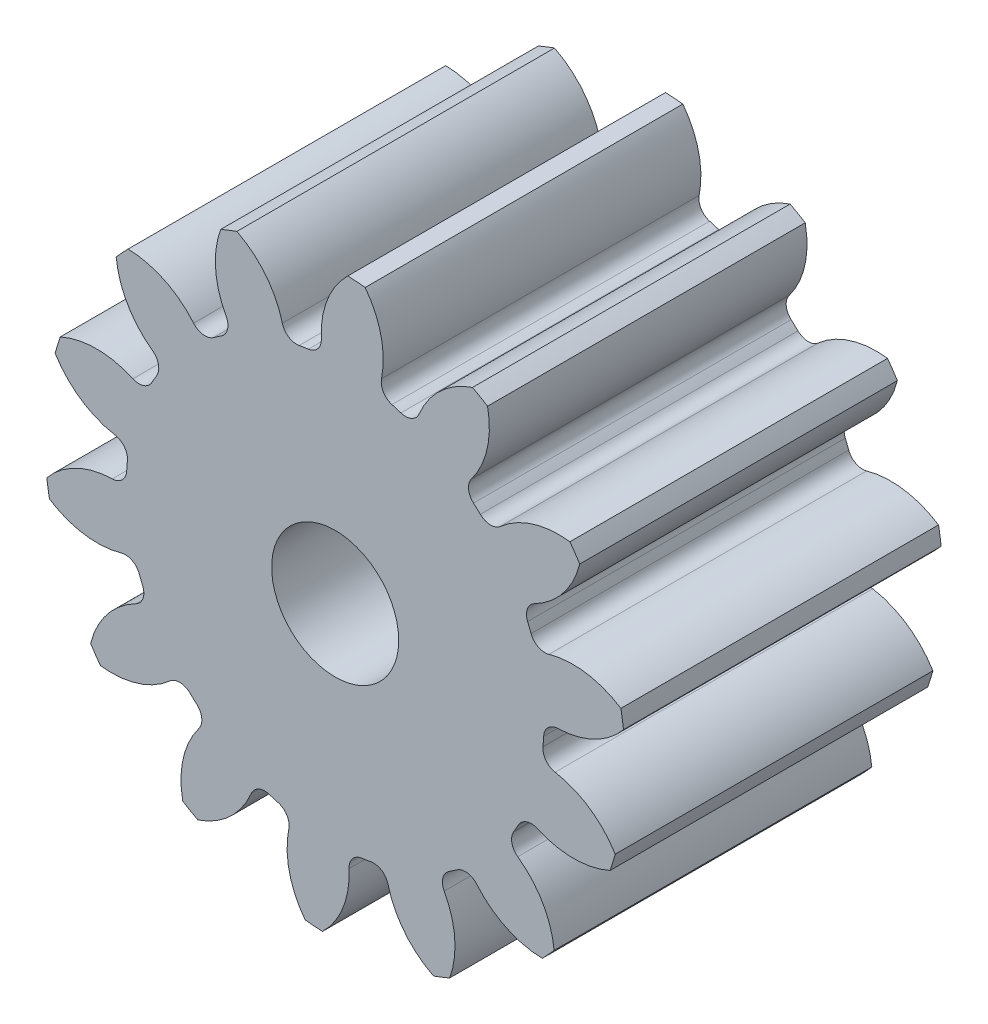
ISO-10303-21;
HEADER;
FILE_DESCRIPTION(('STEP AP214'),'2;1');
FILE_NAME('part.step','',(''),(''),'','','');
FILE_SCHEMA(('AUTOMOTIVE_DESIGN { 1 0 10303 214 1 1 1 1 }'));
ENDSEC;
DATA;
#1=APPLICATION_CONTEXT('core data for automotive mechanical design processes');
#2=APPLICATION_PROTOCOL_DEFINITION('international standard','automotive_design',2000,#1);
#3=PRODUCT_CONTEXT('',#1,'mechanical');
#4=PRODUCT('Part','Part','',(#3));
#5=PRODUCT_RELATED_PRODUCT_CATEGORY('part','',(#4));
#6=PRODUCT_DEFINITION_FORMATION('','',#4);
#7=PRODUCT_DEFINITION_CONTEXT('part definition',#1,'design');
#8=PRODUCT_DEFINITION('design','',#6,#7);
#9=PRODUCT_DEFINITION_SHAPE('','',#8);
#10=(LENGTH_UNIT() NAMED_UNIT(*) SI_UNIT(.MILLI.,.METRE.));
#11=(NAMED_UNIT(*) PLANE_ANGLE_UNIT() SI_UNIT($,.RADIAN.));
#12=(NAMED_UNIT(*) SI_UNIT($,.STERADIAN.) SOLID_ANGLE_UNIT());
#13=UNCERTAINTY_MEASURE_WITH_UNIT(LENGTH_MEASURE(1.E-05),#10,'distance_accuracy_value','');
#14=(GEOMETRIC_REPRESENTATION_CONTEXT(3) GLOBAL_UNCERTAINTY_ASSIGNED_CONTEXT((#13)) GLOBAL_UNIT_ASSIGNED_CONTEXT((#10,
#11,#12)) REPRESENTATION_CONTEXT('',''));
#15=CARTESIAN_POINT('',(0.,0.,0.));
#16=DIRECTION('',(0.,0.,1.));
#17=DIRECTION('',(1.,0.,0.));
#18=AXIS2_PLACEMENT_3D('',#15,#16,#17);
#19=CARTESIAN_POINT('',(0.,0.,88.9));
#20=DIRECTION('',(0.,0.,-1.));
#21=DIRECTION('',(-1.,0.,0.));
#22=AXIS2_PLACEMENT_3D('',#19,#20,#21);
#23=CYLINDRICAL_SURFACE('',#22,81.28);
#24=DIRECTION('',(0.,0.,-1.));
#25=VECTOR('',#24,1.);
#26=CARTESIAN_POINT('',(79.9543938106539,14.6196207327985,44.45));
#27=LINE('',#26,#25);
#28=CARTESIAN_POINT('',(79.9543938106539,14.6196207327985,88.9));
#29=VERTEX_POINT('',#28);
#30=CARTESIAN_POINT('',(79.9543938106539,14.6196207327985,0.));
#31=VERTEX_POINT('',#30);
#32=EDGE_CURVE('E600',#29,#31,#27,.T.);
#33=ORIENTED_EDGE('',*,*,#32,.F.);
#34=CARTESIAN_POINT('',(0.,0.,88.9));
#35=DIRECTION('',(0.,0.,1.));
#36=DIRECTION('',(1.,0.,0.));
#37=AXIS2_PLACEMENT_3D('',#34,#35,#36);
#38=CIRCLE('',#37,81.28);
#39=CARTESIAN_POINT('',(80.6870848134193,9.79962980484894,88.9));
#40=VERTEX_POINT('',#39);
#41=EDGE_CURVE('E1093',#40,#29,#38,.T.);
#42=ORIENTED_EDGE('',*,*,#41,.F.);
#43=DIRECTION('',(0.,0.,-1.));
#44=VECTOR('',#43,1.);
#45=CARTESIAN_POINT('',(80.6870848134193,9.79962980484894,44.45));
#46=LINE('',#45,#44);
#47=CARTESIAN_POINT('',(80.6870848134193,9.79962980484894,0.));
#48=VERTEX_POINT('',#47);
#49=EDGE_CURVE('E1087',#48,#40,#46,.F.);
#50=ORIENTED_EDGE('',*,*,#49,.F.);
#51=CARTESIAN_POINT('',(0.,0.,0.));
#52=DIRECTION('',(0.,0.,1.));
#53=DIRECTION('',(1.,0.,0.));
#54=AXIS2_PLACEMENT_3D('',#51,#52,#53);
#55=CIRCLE('',#54,81.28);
#56=EDGE_CURVE('E1098',#48,#31,#55,.T.);
#57=ORIENTED_EDGE('',*,*,#56,.T.);
#58=EDGE_LOOP('',(#33,#42,#50,#57));
#59=FACE_BOUND('',#58,.T.);
#60=ADVANCED_FACE('F33',(#59),#23,.T.);
#61=DIRECTION('',(0.,0.,-1.));
#62=VECTOR('',#61,1.);
#63=CARTESIAN_POINT('',(68.4446514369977,43.8379754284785,44.45));
#64=LINE('',#63,#62);
#65=CARTESIAN_POINT('',(68.4446514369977,43.8379754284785,0.));
#66=VERTEX_POINT('',#65);
#67=CARTESIAN_POINT('',(68.4446514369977,43.8379754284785,88.9));
#68=VERTEX_POINT('',#67);
#69=EDGE_CURVE('E571',#66,#68,#64,.F.);
#70=ORIENTED_EDGE('',*,*,#69,.F.);
#71=CARTESIAN_POINT('',(65.6932039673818,47.8627344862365,0.));
#72=VERTEX_POINT('',#71);
#73=EDGE_CURVE('E1101',#66,#72,#55,.T.);
#74=ORIENTED_EDGE('',*,*,#73,.T.);
#75=DIRECTION('',(0.,0.,-1.));
#76=VECTOR('',#75,1.);
#77=CARTESIAN_POINT('',(65.6932039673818,47.8627344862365,44.45));
#78=LINE('',#77,#76);
#79=CARTESIAN_POINT('',(65.6932039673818,47.8627344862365,88.9));
#80=VERTEX_POINT('',#79);
#81=EDGE_CURVE('E633',#80,#72,#78,.T.);
#82=ORIENTED_EDGE('',*,*,#81,.F.);
#83=EDGE_CURVE('E1096',#68,#80,#38,.T.);
#84=ORIENTED_EDGE('',*,*,#83,.F.);
#85=EDGE_LOOP('',(#70,#74,#82,#84));
#86=FACE_BOUND('',#85,.T.);
#87=ADVANCED_FACE('F1261',(#86),#23,.T.);
#88=CARTESIAN_POINT('',(0.,0.,88.9));
#89=DIRECTION('',(0.,0.,1.));
#90=DIRECTION('',(1.,0.,0.));
#91=AXIS2_PLACEMENT_3D('',#88,#89,#90);
#92=PLANE('',#91);
#93=CARTESIAN_POINT('',(0.,0.,88.9000000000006));
#94=DIRECTION('',(0.,0.,1.));
#95=DIRECTION('',(1.,0.,0.));
#96=AXIS2_PLACEMENT_3D('',#93,#94,#95);
#97=CIRCLE('',#96,17.78);
#98=CARTESIAN_POINT('',(17.78,0.,88.9000000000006));
#99=VERTEX_POINT('',#98);
#100=EDGE_CURVE('E588',#99,#99,#97,.T.);
#101=ORIENTED_EDGE('',*,*,#100,.F.);
#102=EDGE_LOOP('',(#101));
#103=FACE_BOUND('',#102,.T.);
#104=ORIENTED_EDGE('',*,*,#41,.T.);
#105=CARTESIAN_POINT('',(66.5544948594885,-6.07236750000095,88.9));
#106=DIRECTION('',(0.,0.,-1.));
#107=DIRECTION('',(0.900968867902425,0.433883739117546,0.));
#108=AXIS2_PLACEMENT_3D('',#105,#106,#107);
#109=CIRCLE('',#108,24.6518897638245);
#110=CARTESIAN_POINT('',(59.827772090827,17.6440164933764,88.9));
#111=VERTEX_POINT('',#110);
#112=EDGE_CURVE('E580',#111,#29,#109,.T.);
#113=ORIENTED_EDGE('',*,*,#112,.F.);
#114=CARTESIAN_POINT('',(58.6994283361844,21.6222142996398,88.9));
#115=DIRECTION('',(0.,0.,1.));
#116=DIRECTION('',(-0.900968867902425,-0.433883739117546,0.));
#117=AXIS2_PLACEMENT_3D('',#114,#115,#116);
#118=CIRCLE('',#117,4.13511999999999);
#119=CARTESIAN_POINT('',(54.8191835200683,20.1929076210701,88.9));
#120=VERTEX_POINT('',#119);
#121=EDGE_CURVE('E578',#120,#111,#118,.T.);
#122=ORIENTED_EDGE('',*,*,#121,.F.);
#123=CARTESIAN_POINT('',(0.,0.,88.9));
#124=DIRECTION('',(0.,0.,-1.));
#125=DIRECTION('',(0.900968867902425,0.433883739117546,0.));
#126=AXIS2_PLACEMENT_3D('',#123,#124,#125);
#127=CIRCLE('',#126,58.42);
#128=CARTESIAN_POINT('',(53.8633052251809,22.6194772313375,88.9));
#129=VERTEX_POINT('',#128);
#130=EDGE_CURVE('E563',#129,#120,#127,.T.);
#131=ORIENTED_EDGE('',*,*,#130,.F.);
#132=CARTESIAN_POINT('',(57.6758904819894,24.2205428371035,88.9));
#133=DIRECTION('',(0.,0.,1.));
#134=DIRECTION('',(-0.900968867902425,-0.433883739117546,0.));
#135=AXIS2_PLACEMENT_3D('',#132,#133,#134);
#136=CIRCLE('',#135,4.13511999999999);
#137=CARTESIAN_POINT('',(55.7879133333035,27.8995046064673,88.9));
#138=VERTEX_POINT('',#137);
#139=EDGE_CURVE('E555',#138,#129,#136,.T.);
#140=ORIENTED_EDGE('',*,*,#139,.F.);
#141=CARTESIAN_POINT('',(44.5325677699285,49.831966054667,88.9));
#142=DIRECTION('',(0.,0.,-1.));
#143=DIRECTION('',(-0.900968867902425,-0.433883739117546,0.));
#144=AXIS2_PLACEMENT_3D('',#141,#142,#143);
#145=CIRCLE('',#144,24.6518897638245);
#146=EDGE_CURVE('E585',#68,#138,#145,.T.);
#147=ORIENTED_EDGE('',*,*,#146,.F.);
#148=ORIENTED_EDGE('',*,*,#83,.T.);
#149=CARTESIAN_POINT('',(62.5982294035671,23.4058990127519,88.9));
#150=DIRECTION('',(0.,0.,-1.));
#151=DIRECTION('',(0.623489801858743,0.781831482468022,0.));
#152=AXIS2_PLACEMENT_3D('',#149,#150,#151);
#153=CIRCLE('',#152,24.6518897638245);
#154=CARTESIAN_POINT('',(46.2475082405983,41.8550070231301,88.9));
#155=VERTEX_POINT('',#154);
#156=EDGE_CURVE('E609',#155,#80,#153,.T.);
#157=ORIENTED_EDGE('',*,*,#156,.F.);
#158=CARTESIAN_POINT('',(43.5048303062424,44.9496693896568,88.9));
#159=DIRECTION('',(0.,0.,1.));
#160=DIRECTION('',(-0.623489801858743,-0.781831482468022,0.));
#161=AXIS2_PLACEMENT_3D('',#158,#159,#160);
#162=CIRCLE('',#161,4.13511999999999);
#163=CARTESIAN_POINT('',(40.6290034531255,41.9783334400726,88.9));
#164=VERTEX_POINT('',#163);
#165=EDGE_CURVE('E607',#164,#155,#162,.T.);
#166=ORIENTED_EDGE('',*,*,#165,.F.);
#167=CARTESIAN_POINT('',(0.,0.,88.9));
#168=DIRECTION('',(0.,0.,-1.));
#169=DIRECTION('',(0.623489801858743,0.781831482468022,0.));
#170=AXIS2_PLACEMENT_3D('',#167,#168,#169);
#171=CIRCLE('',#170,58.42);
#172=CARTESIAN_POINT('',(38.7149377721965,43.7498570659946,88.9));
#173=VERTEX_POINT('',#172);
#174=EDGE_CURVE('E604',#173,#164,#171,.T.);
#175=ORIENTED_EDGE('',*,*,#174,.F.);
#176=CARTESIAN_POINT('',(41.4552820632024,46.8465860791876,88.9));
#177=DIRECTION('',(0.,0.,1.));
#178=DIRECTION('',(-0.623489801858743,-0.781831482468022,0.));
#179=AXIS2_PLACEMENT_3D('',#176,#177,#178);
#180=CIRCLE('',#179,4.13511999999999);
#181=CARTESIAN_POINT('',(38.1580317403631,49.3420535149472,88.9));
#182=VERTEX_POINT('',#181);
#183=EDGE_CURVE('E602',#182,#173,#180,.T.);
#184=ORIENTED_EDGE('',*,*,#183,.F.);
#185=CARTESIAN_POINT('',(18.501177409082,64.2190070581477,88.9));
#186=DIRECTION('',(0.,0.,-1.));
#187=DIRECTION('',(-0.623489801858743,-0.781831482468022,0.));
#188=AXIS2_PLACEMENT_3D('',#185,#186,#187);
#189=CIRCLE('',#188,24.6518897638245);
#190=CARTESIAN_POINT('',(42.6459154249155,69.1936723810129,88.9));
#191=VERTEX_POINT('',#190);
#192=EDGE_CURVE('E612',#191,#182,#189,.T.);
#193=ORIENTED_EDGE('',*,*,#192,.F.);
#194=CARTESIAN_POINT('',(38.4206694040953,71.6260466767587,88.9));
#195=VERTEX_POINT('',#194);
#196=EDGE_CURVE('E1137',#191,#195,#38,.T.);
#197=ORIENTED_EDGE('',*,*,#196,.T.);
#198=CARTESIAN_POINT('',(46.2436168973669,48.2483401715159,88.9));
#199=DIRECTION('',(0.,0.,-1.));
#200=DIRECTION('',(0.222520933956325,0.974927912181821,0.));
#201=AXIS2_PLACEMENT_3D('',#198,#199,#200);
#202=CIRCLE('',#201,24.6518897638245);
#203=CARTESIAN_POINT('',(23.5073581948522,57.7761000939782,88.9));
#204=VERTEX_POINT('',#203);
#205=EDGE_CURVE('E644',#204,#195,#202,.T.);
#206=ORIENTED_EDGE('',*,*,#205,.F.);
#207=CARTESIAN_POINT('',(19.6935670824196,59.3742911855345,88.9));
#208=DIRECTION('',(0.,0.,1.));
#209=DIRECTION('',(-0.222520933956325,-0.974927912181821,0.));
#210=AXIS2_PLACEMENT_3D('',#207,#208,#209);
#211=CIRCLE('',#210,4.13511999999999);
#212=CARTESIAN_POINT('',(18.3917509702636,55.4494354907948,88.9));
#213=VERTEX_POINT('',#212);
#214=EDGE_CURVE('E642',#213,#204,#211,.T.);
#215=ORIENTED_EDGE('',*,*,#214,.F.);
#216=CARTESIAN_POINT('',(0.,0.,88.9));
#217=DIRECTION('',(0.,0.,-1.));
#218=DIRECTION('',(0.222520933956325,0.974927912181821,0.));
#219=AXIS2_PLACEMENT_3D('',#216,#217,#218);
#220=CIRCLE('',#219,58.42);
#221=CARTESIAN_POINT('',(15.8986020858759,56.215041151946,88.9));
#222=VERTEX_POINT('',#221);
#223=EDGE_CURVE('E639',#222,#213,#220,.T.);
#224=ORIENTED_EDGE('',*,*,#223,.F.);
#225=CARTESIAN_POINT('',(17.0239466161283,60.1940884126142,88.9));
#226=DIRECTION('',(0.,0.,1.));
#227=DIRECTION('',(-0.222520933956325,-0.974927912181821,0.));
#228=AXIS2_PLACEMENT_3D('',#225,#226,#227);
#229=CIRCLE('',#228,4.13511999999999);
#230=CARTESIAN_POINT('',(12.9704839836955,61.0118035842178,88.9));
#231=VERTEX_POINT('',#230);
#232=EDGE_CURVE('E637',#231,#222,#229,.T.);
#233=ORIENTED_EDGE('',*,*,#232,.F.);
#234=CARTESIAN_POINT('',(-11.1945980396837,65.8866861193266,88.9));
#235=DIRECTION('',(0.,0.,-1.));
#236=DIRECTION('',(-0.222520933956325,-0.974927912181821,0.));
#237=AXIS2_PLACEMENT_3D('',#234,#235,#236);
#238=CIRCLE('',#237,24.6518897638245);
#239=CARTESIAN_POINT('',(8.4006328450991,80.8447139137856,88.9));
#240=VERTEX_POINT('',#239);
#241=EDGE_CURVE('E647',#240,#231,#238,.T.);
#242=ORIENTED_EDGE('',*,*,#241,.F.);
#243=CARTESIAN_POINT('',(3.53845006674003,81.2029418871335,88.9));
#244=VERTEX_POINT('',#243);
#245=EDGE_CURVE('E1243',#240,#244,#38,.T.);
#246=ORIENTED_EDGE('',*,*,#245,.T.);
#247=CARTESIAN_POINT('',(20.7298889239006,63.534605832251,88.9));
#248=DIRECTION('',(0.,0.,-1.));
#249=DIRECTION('',(-0.222520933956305,0.974927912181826,0.));
#250=AXIS2_PLACEMENT_3D('',#247,#248,#249);
#251=CIRCLE('',#250,24.6518897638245);
#252=CARTESIAN_POINT('',(-3.88871244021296,62.2539279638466,88.9));
#253=VERTEX_POINT('',#252);
#254=EDGE_CURVE('E682',#253,#244,#251,.T.);
#255=ORIENTED_EDGE('',*,*,#254,.F.);
#256=CARTESIAN_POINT('',(-8.0182486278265,62.0391064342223,88.9));
#257=DIRECTION('',(0.,0.,1.));
#258=DIRECTION('',(0.222520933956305,-0.974927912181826,0.));
#259=AXIS2_PLACEMENT_3D('',#256,#257,#258);
#260=CIRCLE('',#259,4.13511999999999);
#261=CARTESIAN_POINT('',(-7.48821335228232,57.9380967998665,88.9));
#262=VERTEX_POINT('',#261);
#263=EDGE_CURVE('E680',#262,#253,#260,.T.);
#264=ORIENTED_EDGE('',*,*,#263,.F.);
#265=CARTESIAN_POINT('',(0.,0.,88.9));
#266=DIRECTION('',(0.,0.,-1.));
#267=DIRECTION('',(-0.222520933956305,0.974927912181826,0.));
#268=AXIS2_PLACEMENT_3D('',#265,#266,#267);
#269=CIRCLE('',#268,58.42);
#270=CARTESIAN_POINT('',(-10.0666467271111,57.5461469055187,88.9));
#271=VERTEX_POINT('',#270);
#272=EDGE_CURVE('E677',#271,#262,#269,.T.);
#273=ORIENTED_EDGE('',*,*,#272,.F.);
#274=CARTESIAN_POINT('',(-10.7791902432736,61.6194133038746,88.9));
#275=DIRECTION('',(0.,0.,1.));
#276=DIRECTION('',(0.222520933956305,-0.974927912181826,0.));
#277=AXIS2_PLACEMENT_3D('',#274,#275,#276);
#278=CIRCLE('',#277,4.13511999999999);
#279=CARTESIAN_POINT('',(-14.7860271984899,60.5974176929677,88.9));
#280=VERTEX_POINT('',#279);
#281=EDGE_CURVE('E675',#280,#271,#278,.T.);
#282=ORIENTED_EDGE('',*,*,#281,.F.);
#283=CARTESIAN_POINT('',(-38.6731460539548,54.5046989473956,88.9));
#284=DIRECTION('',(0.,0.,-1.));
#285=DIRECTION('',(0.222520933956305,-0.974927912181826,0.));
#286=AXIS2_PLACEMENT_3D('',#283,#284,#285);
#287=CIRCLE('',#286,24.6518897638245);
#288=CARTESIAN_POINT('',(-27.5084980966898,76.4834683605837,88.9));
#289=VERTEX_POINT('',#288);
#290=EDGE_CURVE('E685',#289,#280,#287,.T.);
#291=ORIENTED_EDGE('',*,*,#290,.F.);
#292=CARTESIAN_POINT('',(-32.0446027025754,74.6965985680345,88.9));
#293=VERTEX_POINT('',#292);
#294=EDGE_CURVE('E1239',#289,#293,#38,.T.);
#295=ORIENTED_EDGE('',*,*,#294,.T.);
#296=CARTESIAN_POINT('',(-8.88964778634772,66.2370636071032,88.9));
#297=DIRECTION('',(0.,0.,-1.));
#298=DIRECTION('',(-0.623489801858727,0.781831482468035,0.));
#299=AXIS2_PLACEMENT_3D('',#296,#297,#298);
#300=CIRCLE('',#299,24.6518897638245);
#301=CARTESIAN_POINT('',(-30.5145758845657,54.4016019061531,88.9));
#302=VERTEX_POINT('',#301);
#303=EDGE_CURVE('E720',#302,#293,#300,.T.);
#304=ORIENTED_EDGE('',*,*,#303,.F.);
#305=CARTESIAN_POINT('',(-34.1419518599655,52.4163157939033,88.9));
#306=DIRECTION('',(0.,0.,1.));
#307=DIRECTION('',(0.623489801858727,-0.781831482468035,0.));
#308=AXIS2_PLACEMENT_3D('',#305,#306,#307);
#309=CIRCLE('',#308,4.13511999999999);
#310=CARTESIAN_POINT('',(-31.8850451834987,48.9514074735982,88.9));
#311=VERTEX_POINT('',#310);
#312=EDGE_CURVE('E718',#311,#302,#309,.T.);
#313=ORIENTED_EDGE('',*,*,#312,.F.);
#314=CARTESIAN_POINT('',(0.,0.,88.9));
#315=DIRECTION('',(0.,0.,-1.));
#316=DIRECTION('',(-0.623489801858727,0.781831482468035,0.));
#317=AXIS2_PLACEMENT_3D('',#314,#315,#316);
#318=CIRCLE('',#317,58.42);
#319=CARTESIAN_POINT('',(-34.0380726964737,47.479532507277,88.9));
#320=VERTEX_POINT('',#319);
#321=EDGE_CURVE('E715',#320,#311,#318,.T.);
#322=ORIENTED_EDGE('',*,*,#321,.F.);
#323=CARTESIAN_POINT('',(-36.4473762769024,50.840257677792,88.9));
#324=DIRECTION('',(0.,0.,1.));
#325=DIRECTION('',(0.623489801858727,-0.781831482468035,0.));
#326=AXIS2_PLACEMENT_3D('',#323,#324,#325);
#327=CIRCLE('',#326,4.13511999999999);
#328=CARTESIAN_POINT('',(-39.6139843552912,48.1809700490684,88.9));
#329=VERTEX_POINT('',#328);
#330=EDGE_CURVE('E713',#329,#320,#327,.T.);
#331=ORIENTED_EDGE('',*,*,#330,.F.);
#332=CARTESIAN_POINT('',(-58.4920031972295,32.3273876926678,88.9));
#333=DIRECTION('',(0.,0.,-1.));
#334=DIRECTION('',(0.623489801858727,-0.781831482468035,0.));
#335=AXIS2_PLACEMENT_3D('',#332,#333,#334);
#336=CIRCLE('',#335,24.6518897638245);
#337=CARTESIAN_POINT('',(-57.9692336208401,56.9737338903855,88.9));
#338=VERTEX_POINT('',#337);
#339=EDGE_CURVE('E723',#338,#329,#336,.T.);
#340=ORIENTED_EDGE('',*,*,#339,.F.);
#341=CARTESIAN_POINT('',(-61.2808289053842,53.3956778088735,88.9));
#342=VERTEX_POINT('',#341);
#343=EDGE_CURVE('E1235',#338,#342,#38,.T.);
#344=ORIENTED_EDGE('',*,*,#343,.T.);
#345=CARTESIAN_POINT('',(-36.7484807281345,55.8204585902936,88.9));
#346=DIRECTION('',(0.,0.,-1.));
#347=DIRECTION('',(-0.900968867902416,0.433883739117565,0.));
#348=AXIS2_PLACEMENT_3D('',#345,#346,#347);
#349=CIRCLE('',#348,24.6518897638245);
#350=CARTESIAN_POINT('',(-51.0966533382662,35.7743713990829,88.9));
#351=VERTEX_POINT('',#350);
#352=EDGE_CURVE('E758',#351,#342,#349,.T.);
#353=ORIENTED_EDGE('',*,*,#352,.F.);
#354=CARTESIAN_POINT('',(-53.5034228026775,32.4118309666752,88.9));
#355=DIRECTION('',(0.,0.,1.));
#356=DIRECTION('',(0.900968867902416,-0.433883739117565,0.));
#357=AXIS2_PLACEMENT_3D('',#354,#355,#356);
#358=CIRCLE('',#357,4.13511999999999);
#359=CARTESIAN_POINT('',(-49.9666527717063,30.269291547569,88.9));
#360=VERTEX_POINT('',#359);
#361=EDGE_CURVE('E756',#360,#351,#358,.T.);
#362=ORIENTED_EDGE('',*,*,#361,.F.);
#363=CARTESIAN_POINT('',(0.,0.,88.9));
#364=DIRECTION('',(0.,0.,-1.));
#365=DIRECTION('',(-0.900968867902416,0.433883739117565,0.));
#366=AXIS2_PLACEMENT_3D('',#363,#364,#365);
#367=CIRCLE('',#366,58.42);
#368=CARTESIAN_POINT('',(-51.2678409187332,28.0090143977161,88.9));
#369=VERTEX_POINT('',#368);
#370=EDGE_CURVE('E753',#369,#360,#367,.T.);
#371=ORIENTED_EDGE('',*,*,#370,.F.);
#372=CARTESIAN_POINT('',(-54.8967124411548,29.9915655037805,88.9));
#373=DIRECTION('',(0.,0.,1.));
#374=DIRECTION('',(0.900968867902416,-0.433883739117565,0.));
#375=AXIS2_PLACEMENT_3D('',#372,#373,#374);
#376=CIRCLE('',#375,4.13511999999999);
#377=CARTESIAN_POINT('',(-56.5959060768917,26.2216903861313,88.9));
#378=VERTEX_POINT('',#377);
#379=EDGE_CURVE('E751',#378,#369,#376,.T.);
#380=ORIENTED_EDGE('',*,*,#379,.F.);
#381=CARTESIAN_POINT('',(-66.7258017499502,3.74724083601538,88.9));
#382=DIRECTION('',(0.,0.,-1.));
#383=DIRECTION('',(0.900968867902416,-0.433883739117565,0.));
#384=AXIS2_PLACEMENT_3D('',#381,#382,#383);
#385=CIRCLE('',#384,24.6518897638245);
#386=CARTESIAN_POINT('',(-76.9484514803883,26.1796526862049,88.9));
#387=VERTEX_POINT('',#386);
#388=EDGE_CURVE('E761',#387,#378,#385,.T.);
#389=ORIENTED_EDGE('',*,*,#388,.F.);
#390=CARTESIAN_POINT('',(-78.3796353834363,21.5190882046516,88.9));
#391=VERTEX_POINT('',#390);
#392=EDGE_CURVE('E1231',#387,#391,#38,.T.);
#393=ORIENTED_EDGE('',*,*,#392,.T.);
#394=CARTESIAN_POINT('',(-57.3288263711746,34.3479271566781,88.9));
#395=DIRECTION('',(0.,0.,-1.));
#396=DIRECTION('',(-1.,0.,0.));
#397=AXIS2_PLACEMENT_3D('',#394,#395,#396);
#398=CIRCLE('',#397,24.6518897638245);
#399=CARTESIAN_POINT('',(-61.5584119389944,10.0615878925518,88.9));
#400=VERTEX_POINT('',#399);
#401=EDGE_CURVE('E796',#400,#391,#398,.T.);
#402=ORIENTED_EDGE('',*,*,#401,.F.);
#403=CARTESIAN_POINT('',(-62.2678846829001,5.98778551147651,88.9));
#404=DIRECTION('',(0.,0.,1.));
#405=DIRECTION('',(1.,0.,0.));
#406=AXIS2_PLACEMENT_3D('',#403,#404,#405);
#407=CIRCLE('',#406,4.13511999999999);
#408=CARTESIAN_POINT('',(-58.1517519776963,5.59197120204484,88.9));
#409=VERTEX_POINT('',#408);
#410=EDGE_CURVE('E794',#409,#400,#407,.T.);
#411=ORIENTED_EDGE('',*,*,#410,.F.);
#412=CARTESIAN_POINT('',(0.,0.,88.9));
#413=DIRECTION('',(0.,0.,-1.));
#414=DIRECTION('',(-1.,0.,0.));
#415=AXIS2_PLACEMENT_3D('',#412,#413,#414);
#416=CIRCLE('',#415,58.42);
#417=CARTESIAN_POINT('',(-58.3433844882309,2.99096747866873,88.9));
#418=VERTEX_POINT('',#417);
#419=EDGE_CURVE('E791',#418,#409,#416,.T.);
#420=ORIENTED_EDGE('',*,*,#419,.F.);
#421=CARTESIAN_POINT('',(-62.4730814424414,3.20267595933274,88.9));
#422=DIRECTION('',(0.,0.,1.));
#423=DIRECTION('',(1.,0.,0.));
#424=AXIS2_PLACEMENT_3D('',#421,#422,#423);
#425=CIRCLE('',#424,4.13511999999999);
#426=CARTESIAN_POINT('',(-62.3683144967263,-0.93111664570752,88.9));
#427=VERTEX_POINT('',#426);
#428=EDGE_CURVE('E789',#427,#418,#425,.T.);
#429=ORIENTED_EDGE('',*,*,#428,.F.);
#430=CARTESIAN_POINT('',(-61.7437369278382,-25.5750930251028,88.9));
#431=DIRECTION('',(0.,0.,-1.));
#432=DIRECTION('',(1.,0.,0.));
#433=AXIS2_PLACEMENT_3D('',#430,#431,#432);
#434=CIRCLE('',#433,24.6518897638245);
#435=CARTESIAN_POINT('',(-80.6870848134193,-9.79962980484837,88.9));
#436=VERTEX_POINT('',#435);
#437=EDGE_CURVE('E799',#436,#427,#434,.T.);
#438=ORIENTED_EDGE('',*,*,#437,.F.);
#439=CARTESIAN_POINT('',(-79.9543938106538,-14.6196207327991,88.9));
#440=VERTEX_POINT('',#439);
#441=EDGE_CURVE('E1227',#436,#440,#38,.T.);
#442=ORIENTED_EDGE('',*,*,#441,.T.);
#443=CARTESIAN_POINT('',(-66.5544948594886,6.07236750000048,88.9));
#444=DIRECTION('',(0.,0.,-1.));
#445=DIRECTION('',(-0.900968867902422,-0.433883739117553,0.));
#446=AXIS2_PLACEMENT_3D('',#443,#444,#445);
#447=CIRCLE('',#446,24.6518897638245);
#448=CARTESIAN_POINT('',(-59.8277720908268,-17.6440164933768,88.9));
#449=VERTEX_POINT('',#448);
#450=EDGE_CURVE('E834',#449,#440,#447,.T.);
#451=ORIENTED_EDGE('',*,*,#450,.F.);
#452=CARTESIAN_POINT('',(-58.6994283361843,-21.6222142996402,88.9));
#453=DIRECTION('',(0.,0.,1.));
#454=DIRECTION('',(0.900968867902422,0.433883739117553,0.));
#455=AXIS2_PLACEMENT_3D('',#452,#453,#454);
#456=CIRCLE('',#455,4.13511999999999);
#457=CARTESIAN_POINT('',(-54.8191835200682,-20.1929076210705,88.9));
#458=VERTEX_POINT('',#457);
#459=EDGE_CURVE('E832',#458,#449,#456,.T.);
#460=ORIENTED_EDGE('',*,*,#459,.F.);
#461=CARTESIAN_POINT('',(0.,0.,88.9));
#462=DIRECTION('',(0.,0.,-1.));
#463=DIRECTION('',(-0.900968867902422,-0.433883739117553,0.));
#464=AXIS2_PLACEMENT_3D('',#461,#462,#463);
#465=CIRCLE('',#464,58.42);
#466=CARTESIAN_POINT('',(-53.8633052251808,-22.6194772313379,88.9));
#467=VERTEX_POINT('',#466);
#468=EDGE_CURVE('E829',#467,#458,#465,.T.);
#469=ORIENTED_EDGE('',*,*,#468,.F.);
#470=CARTESIAN_POINT('',(-57.6758904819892,-24.2205428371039,88.9));
#471=DIRECTION('',(0.,0.,1.));
#472=DIRECTION('',(0.900968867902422,0.433883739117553,0.));
#473=AXIS2_PLACEMENT_3D('',#470,#471,#472);
#474=CIRCLE('',#473,4.13511999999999);
#475=CARTESIAN_POINT('',(-55.7879133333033,-27.8995046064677,88.9));
#476=VERTEX_POINT('',#475);
#477=EDGE_CURVE('E827',#476,#467,#474,.T.);
#478=ORIENTED_EDGE('',*,*,#477,.F.);
#479=CARTESIAN_POINT('',(-44.5325677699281,-49.8319660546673,88.9));
#480=DIRECTION('',(0.,0.,-1.));
#481=DIRECTION('',(0.900968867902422,0.433883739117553,0.));
#482=AXIS2_PLACEMENT_3D('',#479,#480,#481);
#483=CIRCLE('',#482,24.6518897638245);
#484=CARTESIAN_POINT('',(-68.4446514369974,-43.837975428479,88.9));
#485=VERTEX_POINT('',#484);
#486=EDGE_CURVE('E837',#485,#476,#483,.T.);
#487=ORIENTED_EDGE('',*,*,#486,.F.);
#488=CARTESIAN_POINT('',(-65.6932039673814,-47.862734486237,88.9));
#489=VERTEX_POINT('',#488);
#490=EDGE_CURVE('E1223',#485,#489,#38,.T.);
#491=ORIENTED_EDGE('',*,*,#490,.T.);
#492=CARTESIAN_POINT('',(-62.5982294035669,-23.4058990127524,88.9));
#493=DIRECTION('',(0.,0.,-1.));
#494=DIRECTION('',(-0.623489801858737,-0.781831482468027,0.));
#495=AXIS2_PLACEMENT_3D('',#492,#493,#494);
#496=CIRCLE('',#495,24.6518897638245);
#497=CARTESIAN_POINT('',(-46.247508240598,-41.8550070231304,88.9));
#498=VERTEX_POINT('',#497);
#499=EDGE_CURVE('E872',#498,#489,#496,.T.);
#500=ORIENTED_EDGE('',*,*,#499,.F.);
#501=CARTESIAN_POINT('',(-43.504830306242,-44.9496693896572,88.9));
#502=DIRECTION('',(0.,0.,1.));
#503=DIRECTION('',(0.623489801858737,0.781831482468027,0.));
#504=AXIS2_PLACEMENT_3D('',#501,#502,#503);
#505=CIRCLE('',#504,4.13511999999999);
#506=CARTESIAN_POINT('',(-40.6290034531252,-41.9783334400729,88.9));
#507=VERTEX_POINT('',#506);
#508=EDGE_CURVE('E870',#507,#498,#505,.T.);
#509=ORIENTED_EDGE('',*,*,#508,.F.);
#510=CARTESIAN_POINT('',(0.,0.,88.9));
#511=DIRECTION('',(0.,0.,-1.));
#512=DIRECTION('',(-0.623489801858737,-0.781831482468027,0.));
#513=AXIS2_PLACEMENT_3D('',#510,#511,#512);
#514=CIRCLE('',#513,58.42);
#515=CARTESIAN_POINT('',(-38.7149377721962,-43.7498570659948,88.9));
#516=VERTEX_POINT('',#515);
#517=EDGE_CURVE('E867',#516,#507,#514,.T.);
#518=ORIENTED_EDGE('',*,*,#517,.F.);
#519=CARTESIAN_POINT('',(-41.455282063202,-46.8465860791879,88.9));
#520=DIRECTION('',(0.,0.,1.));
#521=DIRECTION('',(0.623489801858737,0.781831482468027,0.));
#522=AXIS2_PLACEMENT_3D('',#519,#520,#521);
#523=CIRCLE('',#522,4.13511999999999);
#524=CARTESIAN_POINT('',(-38.1580317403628,-49.3420535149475,88.9));
#525=VERTEX_POINT('',#524);
#526=EDGE_CURVE('E865',#525,#516,#523,.T.);
#527=ORIENTED_EDGE('',*,*,#526,.F.);
#528=CARTESIAN_POINT('',(-18.5011774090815,-64.2190070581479,88.9));
#529=DIRECTION('',(0.,0.,-1.));
#530=DIRECTION('',(0.623489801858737,0.781831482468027,0.));
#531=AXIS2_PLACEMENT_3D('',#528,#529,#530);
#532=CIRCLE('',#531,24.6518897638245);
#533=CARTESIAN_POINT('',(-42.645915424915,-69.1936723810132,88.9));
#534=VERTEX_POINT('',#533);
#535=EDGE_CURVE('E875',#534,#525,#532,.T.);
#536=ORIENTED_EDGE('',*,*,#535,.F.);
#537=CARTESIAN_POINT('',(-38.4206694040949,-71.6260466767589,88.9));
#538=VERTEX_POINT('',#537);
#539=EDGE_CURVE('E1219',#534,#538,#38,.T.);
#540=ORIENTED_EDGE('',*,*,#539,.T.);
#541=CARTESIAN_POINT('',(-46.2436168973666,-48.2483401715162,88.9));
#542=DIRECTION('',(0.,0.,-1.));
#543=DIRECTION('',(-0.222520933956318,-0.974927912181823,0.));
#544=AXIS2_PLACEMENT_3D('',#541,#542,#543);
#545=CIRCLE('',#544,24.6518897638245);
#546=CARTESIAN_POINT('',(-23.5073581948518,-57.7761000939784,88.9));
#547=VERTEX_POINT('',#546);
#548=EDGE_CURVE('E910',#547,#538,#545,.T.);
#549=ORIENTED_EDGE('',*,*,#548,.F.);
#550=CARTESIAN_POINT('',(-19.6935670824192,-59.3742911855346,88.9));
#551=DIRECTION('',(0.,0.,1.));
#552=DIRECTION('',(0.222520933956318,0.974927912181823,0.));
#553=AXIS2_PLACEMENT_3D('',#550,#551,#552);
#554=CIRCLE('',#553,4.13511999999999);
#555=CARTESIAN_POINT('',(-18.3917509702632,-55.4494354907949,88.9));
#556=VERTEX_POINT('',#555);
#557=EDGE_CURVE('E908',#556,#547,#554,.T.);
#558=ORIENTED_EDGE('',*,*,#557,.F.);
#559=CARTESIAN_POINT('',(0.,0.,88.9));
#560=DIRECTION('',(0.,0.,-1.));
#561=DIRECTION('',(-0.222520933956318,-0.974927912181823,0.));
#562=AXIS2_PLACEMENT_3D('',#559,#560,#561);
#563=CIRCLE('',#562,58.42);
#564=CARTESIAN_POINT('',(-15.8986020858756,-56.2150411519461,88.9));
#565=VERTEX_POINT('',#564);
#566=EDGE_CURVE('E905',#565,#556,#563,.T.);
#567=ORIENTED_EDGE('',*,*,#566,.F.);
#568=CARTESIAN_POINT('',(-17.0239466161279,-60.1940884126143,88.9));
#569=DIRECTION('',(0.,0.,1.));
#570=DIRECTION('',(0.222520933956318,0.974927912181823,0.));
#571=AXIS2_PLACEMENT_3D('',#568,#569,#570);
#572=CIRCLE('',#571,4.13511999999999);
#573=CARTESIAN_POINT('',(-12.9704839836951,-61.0118035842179,88.9));
#574=VERTEX_POINT('',#573);
#575=EDGE_CURVE('E903',#574,#565,#572,.T.);
#576=ORIENTED_EDGE('',*,*,#575,.F.);
#577=CARTESIAN_POINT('',(11.1945980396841,-65.8866861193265,88.9));
#578=DIRECTION('',(0.,0.,-1.));
#579=DIRECTION('',(0.222520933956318,0.974927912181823,0.));
#580=AXIS2_PLACEMENT_3D('',#577,#578,#579);
#581=CIRCLE('',#580,24.6518897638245);
#582=CARTESIAN_POINT('',(-8.40063284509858,-80.8447139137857,88.9));
#583=VERTEX_POINT('',#582);
#584=EDGE_CURVE('E913',#583,#574,#581,.T.);
#585=ORIENTED_EDGE('',*,*,#584,.F.);
#586=CARTESIAN_POINT('',(-3.5384500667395,-81.2029418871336,88.9));
#587=VERTEX_POINT('',#586);
#588=EDGE_CURVE('E1215',#583,#587,#38,.T.);
#589=ORIENTED_EDGE('',*,*,#588,.T.);
#590=CARTESIAN_POINT('',(-20.7298889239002,-63.5346058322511,88.9));
#591=DIRECTION('',(0.,0.,-1.));
#592=DIRECTION('',(0.222520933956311,-0.974927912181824,0.));
#593=AXIS2_PLACEMENT_3D('',#590,#591,#592);
#594=CIRCLE('',#593,24.6518897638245);
#595=CARTESIAN_POINT('',(3.88871244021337,-62.2539279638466,88.9));
#596=VERTEX_POINT('',#595);
#597=EDGE_CURVE('E948',#596,#587,#594,.T.);
#598=ORIENTED_EDGE('',*,*,#597,.F.);
#599=CARTESIAN_POINT('',(8.01824862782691,-62.0391064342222,88.9));
#600=DIRECTION('',(0.,0.,1.));
#601=DIRECTION('',(-0.222520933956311,0.974927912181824,0.));
#602=AXIS2_PLACEMENT_3D('',#599,#600,#601);
#603=CIRCLE('',#602,4.13511999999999);
#604=CARTESIAN_POINT('',(7.48821335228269,-57.9380967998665,88.9));
#605=VERTEX_POINT('',#604);
#606=EDGE_CURVE('E946',#605,#596,#603,.T.);
#607=ORIENTED_EDGE('',*,*,#606,.F.);
#608=CARTESIAN_POINT('',(0.,0.,88.9));
#609=DIRECTION('',(0.,0.,-1.));
#610=DIRECTION('',(0.222520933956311,-0.974927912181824,0.));
#611=AXIS2_PLACEMENT_3D('',#608,#609,#610);
#612=CIRCLE('',#611,58.42);
#613=CARTESIAN_POINT('',(10.0666467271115,-57.5461469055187,88.9));
#614=VERTEX_POINT('',#613);
#615=EDGE_CURVE('E943',#614,#605,#612,.T.);
#616=ORIENTED_EDGE('',*,*,#615,.F.);
#617=CARTESIAN_POINT('',(10.779190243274,-61.6194133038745,88.9));
#618=DIRECTION('',(0.,0.,1.));
#619=DIRECTION('',(-0.222520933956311,0.974927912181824,0.));
#620=AXIS2_PLACEMENT_3D('',#617,#618,#619);
#621=CIRCLE('',#620,4.13511999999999);
#622=CARTESIAN_POINT('',(14.7860271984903,-60.5974176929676,88.9));
#623=VERTEX_POINT('',#622);
#624=EDGE_CURVE('E941',#623,#614,#621,.T.);
#625=ORIENTED_EDGE('',*,*,#624,.F.);
#626=CARTESIAN_POINT('',(38.6731460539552,-54.5046989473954,88.9));
#627=DIRECTION('',(0.,0.,-1.));
#628=DIRECTION('',(-0.222520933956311,0.974927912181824,0.));
#629=AXIS2_PLACEMENT_3D('',#626,#627,#628);
#630=CIRCLE('',#629,24.6518897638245);
#631=CARTESIAN_POINT('',(27.5084980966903,-76.4834683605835,88.9));
#632=VERTEX_POINT('',#631);
#633=EDGE_CURVE('E951',#632,#623,#630,.T.);
#634=ORIENTED_EDGE('',*,*,#633,.F.);
#635=CARTESIAN_POINT('',(32.0446027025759,-74.6965985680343,88.9));
#636=VERTEX_POINT('',#635);
#637=EDGE_CURVE('E1211',#632,#636,#38,.T.);
#638=ORIENTED_EDGE('',*,*,#637,.T.);
#639=CARTESIAN_POINT('',(8.88964778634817,-66.2370636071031,88.9));
#640=DIRECTION('',(0.,0.,-1.));
#641=DIRECTION('',(0.623489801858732,-0.781831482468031,0.));
#642=AXIS2_PLACEMENT_3D('',#639,#640,#641);
#643=CIRCLE('',#642,24.6518897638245);
#644=CARTESIAN_POINT('',(30.514575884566,-54.4016019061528,88.9));
#645=VERTEX_POINT('',#644);
#646=EDGE_CURVE('E986',#645,#636,#643,.T.);
#647=ORIENTED_EDGE('',*,*,#646,.F.);
#648=CARTESIAN_POINT('',(34.1419518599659,-52.4163157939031,88.9));
#649=DIRECTION('',(0.,0.,1.));
#650=DIRECTION('',(-0.623489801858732,0.781831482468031,0.));
#651=AXIS2_PLACEMENT_3D('',#648,#649,#650);
#652=CIRCLE('',#651,4.13511999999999);
#653=CARTESIAN_POINT('',(31.8850451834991,-48.951407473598,88.9));
#654=VERTEX_POINT('',#653);
#655=EDGE_CURVE('E984',#654,#645,#652,.T.);
#656=ORIENTED_EDGE('',*,*,#655,.F.);
#657=CARTESIAN_POINT('',(0.,0.,88.9));
#658=DIRECTION('',(0.,0.,-1.));
#659=DIRECTION('',(0.623489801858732,-0.781831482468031,0.));
#660=AXIS2_PLACEMENT_3D('',#657,#658,#659);
#661=CIRCLE('',#660,58.42);
#662=CARTESIAN_POINT('',(34.038072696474,-47.4795325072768,88.9));
#663=VERTEX_POINT('',#662);
#664=EDGE_CURVE('E981',#663,#654,#661,.T.);
#665=ORIENTED_EDGE('',*,*,#664,.F.);
#666=CARTESIAN_POINT('',(36.4473762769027,-50.8402576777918,88.9));
#667=DIRECTION('',(0.,0.,1.));
#668=DIRECTION('',(-0.623489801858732,0.781831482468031,0.));
#669=AXIS2_PLACEMENT_3D('',#666,#667,#668);
#670=CIRCLE('',#669,4.13511999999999);
#671=CARTESIAN_POINT('',(39.6139843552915,-48.1809700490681,88.9));
#672=VERTEX_POINT('',#671);
#673=EDGE_CURVE('E979',#672,#663,#670,.T.);
#674=ORIENTED_EDGE('',*,*,#673,.F.);
#675=CARTESIAN_POINT('',(58.4920031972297,-32.3273876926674,88.9));
#676=DIRECTION('',(0.,0.,-1.));
#677=DIRECTION('',(-0.623489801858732,0.781831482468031,0.));
#678=AXIS2_PLACEMENT_3D('',#675,#676,#677);
#679=CIRCLE('',#678,24.6518897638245);
#680=CARTESIAN_POINT('',(57.9692336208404,-56.9737338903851,88.9));
#681=VERTEX_POINT('',#680);
#682=EDGE_CURVE('E989',#681,#672,#679,.T.);
#683=ORIENTED_EDGE('',*,*,#682,.F.);
#684=CARTESIAN_POINT('',(61.2808289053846,-53.395677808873,88.9));
#685=VERTEX_POINT('',#684);
#686=EDGE_CURVE('E1210',#681,#685,#38,.T.);
#687=ORIENTED_EDGE('',*,*,#686,.T.);
#688=CARTESIAN_POINT('',(36.7484807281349,-55.8204585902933,88.9));
#689=DIRECTION('',(0.,0.,-1.));
#690=DIRECTION('',(0.900968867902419,-0.433883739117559,0.));
#691=AXIS2_PLACEMENT_3D('',#688,#689,#690);
#692=CIRCLE('',#691,24.6518897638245);
#693=CARTESIAN_POINT('',(51.0966533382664,-35.7743713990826,88.9));
#694=VERTEX_POINT('',#693);
#695=EDGE_CURVE('E1024',#694,#685,#692,.T.);
#696=ORIENTED_EDGE('',*,*,#695,.F.);
#697=CARTESIAN_POINT('',(53.5034228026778,-32.4118309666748,88.9));
#698=DIRECTION('',(0.,0.,1.));
#699=DIRECTION('',(-0.900968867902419,0.433883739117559,0.));
#700=AXIS2_PLACEMENT_3D('',#697,#698,#699);
#701=CIRCLE('',#700,4.13511999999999);
#702=CARTESIAN_POINT('',(49.9666527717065,-30.2692915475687,88.9));
#703=VERTEX_POINT('',#702);
#704=EDGE_CURVE('E1022',#703,#694,#701,.T.);
#705=ORIENTED_EDGE('',*,*,#704,.F.);
#706=CARTESIAN_POINT('',(0.,0.,88.9));
#707=DIRECTION('',(0.,0.,-1.));
#708=DIRECTION('',(0.900968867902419,-0.433883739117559,0.));
#709=AXIS2_PLACEMENT_3D('',#706,#707,#708);
#710=CIRCLE('',#709,58.42);
#711=CARTESIAN_POINT('',(51.2678409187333,-28.0090143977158,88.9));
#712=VERTEX_POINT('',#711);
#713=EDGE_CURVE('E1019',#712,#703,#710,.T.);
#714=ORIENTED_EDGE('',*,*,#713,.F.);
#715=CARTESIAN_POINT('',(54.896712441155,-29.9915655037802,88.9));
#716=DIRECTION('',(0.,0.,1.));
#717=DIRECTION('',(-0.900968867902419,0.433883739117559,0.));
#718=AXIS2_PLACEMENT_3D('',#715,#716,#717);
#719=CIRCLE('',#718,4.13511999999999);
#720=CARTESIAN_POINT('',(56.5959060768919,-26.2216903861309,88.9));
#721=VERTEX_POINT('',#720);
#722=EDGE_CURVE('E1017',#721,#712,#719,.T.);
#723=ORIENTED_EDGE('',*,*,#722,.F.);
#724=CARTESIAN_POINT('',(66.7258017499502,-3.74724083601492,88.9));
#725=DIRECTION('',(0.,0.,-1.));
#726=DIRECTION('',(-0.900968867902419,0.433883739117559,0.));
#727=AXIS2_PLACEMENT_3D('',#724,#725,#726);
#728=CIRCLE('',#727,24.6518897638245);
#729=CARTESIAN_POINT('',(76.9484514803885,-26.1796526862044,88.9));
#730=VERTEX_POINT('',#729);
#731=EDGE_CURVE('E1027',#730,#721,#728,.T.);
#732=ORIENTED_EDGE('',*,*,#731,.F.);
#733=CARTESIAN_POINT('',(78.3796353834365,-21.519088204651,88.9));
#734=VERTEX_POINT('',#733);
#735=EDGE_CURVE('E1097',#730,#734,#38,.T.);
#736=ORIENTED_EDGE('',*,*,#735,.T.);
#737=CARTESIAN_POINT('',(57.3288263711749,-34.3479271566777,88.9));
#738=DIRECTION('',(0.,0.,-1.));
#739=DIRECTION('',(1.,0.,0.));
#740=AXIS2_PLACEMENT_3D('',#737,#738,#739);
#741=CIRCLE('',#740,24.6518897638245);
#742=CARTESIAN_POINT('',(61.5584119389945,-10.0615878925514,88.9));
#743=VERTEX_POINT('',#742);
#744=EDGE_CURVE('E1062',#743,#734,#741,.T.);
#745=ORIENTED_EDGE('',*,*,#744,.F.);
#746=CARTESIAN_POINT('',(62.2678846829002,-5.98778551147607,88.9));
#747=DIRECTION('',(0.,0.,1.));
#748=DIRECTION('',(-1.,0.,0.));
#749=AXIS2_PLACEMENT_3D('',#746,#747,#748);
#750=CIRCLE('',#749,4.13511999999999);
#751=CARTESIAN_POINT('',(58.1517519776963,-5.59197120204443,88.9));
#752=VERTEX_POINT('',#751);
#753=EDGE_CURVE('E1060',#752,#743,#750,.T.);
#754=ORIENTED_EDGE('',*,*,#753,.F.);
#755=CARTESIAN_POINT('',(0.,0.,88.9));
#756=DIRECTION('',(0.,0.,-1.));
#757=DIRECTION('',(1.,0.,0.));
#758=AXIS2_PLACEMENT_3D('',#755,#756,#757);
#759=CIRCLE('',#758,58.42);
#760=CARTESIAN_POINT('',(58.343384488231,-2.99096747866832,88.9));
#761=VERTEX_POINT('',#760);
#762=EDGE_CURVE('E1057',#761,#752,#759,.T.);
#763=ORIENTED_EDGE('',*,*,#762,.F.);
#764=CARTESIAN_POINT('',(62.4730814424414,-3.2026759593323,88.9));
#765=DIRECTION('',(0.,0.,1.));
#766=DIRECTION('',(-1.,0.,0.));
#767=AXIS2_PLACEMENT_3D('',#764,#765,#766);
#768=CIRCLE('',#767,4.13511999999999);
#769=CARTESIAN_POINT('',(62.3683144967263,0.931116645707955,88.9));
#770=VERTEX_POINT('',#769);
#771=EDGE_CURVE('E1055',#770,#761,#768,.T.);
#772=ORIENTED_EDGE('',*,*,#771,.F.);
#773=CARTESIAN_POINT('',(61.743736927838,25.5750930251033,88.9));
#774=DIRECTION('',(0.,0.,-1.));
#775=DIRECTION('',(-1.,0.,0.));
#776=AXIS2_PLACEMENT_3D('',#773,#774,#775);
#777=CIRCLE('',#776,24.6518897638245);
#778=EDGE_CURVE('E1065',#40,#770,#777,.T.);
#779=ORIENTED_EDGE('',*,*,#778,.F.);
#780=EDGE_LOOP('',(#104,#113,#122,#131,#140,#147,#148,#157,#166,#175,#184,#193,#197,#206,#215,
#224,#233,#242,#246,#255,#264,#273,#282,#291,#295,#304,#313,#322,#331,#340,#344,#353,#362,#371,
#380,#389,#393,#402,#411,#420,#429,#438,#442,#451,#460,#469,#478,#487,#491,#500,#509,#518,#527,
#536,#540,#549,#558,#567,#576,#585,#589,#598,#607,#616,#625,#634,#638,#647,#656,#665,#674,#683,
#687,#696,#705,#714,#723,#732,#736,#745,#754,#763,#772,#779));
#781=FACE_BOUND('',#780,.T.);
#782=ADVANCED_FACE('F576',(#103,#781),#92,.T.);
#783=CARTESIAN_POINT('',(0.,0.,0.));
#784=DIRECTION('',(0.,0.,1.));
#785=DIRECTION('',(1.,0.,0.));
#786=AXIS2_PLACEMENT_3D('',#783,#784,#785);
#787=PLANE('',#786);
#788=CARTESIAN_POINT('',(0.,0.,0.));
#789=DIRECTION('',(0.,0.,1.));
#790=DIRECTION('',(1.,0.,0.));
#791=AXIS2_PLACEMENT_3D('',#788,#789,#790);
#792=CIRCLE('',#791,17.78);
#793=CARTESIAN_POINT('',(17.78,0.,-1.77635683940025E-12));
#794=VERTEX_POINT('',#793);
#795=EDGE_CURVE('E36',#794,#794,#792,.T.);
#796=ORIENTED_EDGE('',*,*,#795,.T.);
#797=EDGE_LOOP('',(#796));
#798=FACE_BOUND('',#797,.T.);
#799=CARTESIAN_POINT('',(66.5544948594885,-6.07236750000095,0.));
#800=DIRECTION('',(0.,0.,-1.));
#801=DIRECTION('',(0.900968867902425,0.433883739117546,0.));
#802=AXIS2_PLACEMENT_3D('',#799,#800,#801);
#803=CIRCLE('',#802,24.6518897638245);
#804=CARTESIAN_POINT('',(59.827772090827,17.6440164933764,0.));
#805=VERTEX_POINT('',#804);
#806=EDGE_CURVE('E564',#805,#31,#803,.T.);
#807=ORIENTED_EDGE('',*,*,#806,.T.);
#808=ORIENTED_EDGE('',*,*,#56,.F.);
#809=CARTESIAN_POINT('',(61.743736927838,25.5750930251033,0.));
#810=DIRECTION('',(0.,0.,1.));
#811=DIRECTION('',(1.,0.,0.));
#812=AXIS2_PLACEMENT_3D('',#809,#810,#811);
#813=CIRCLE('',#812,24.6518897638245);
#814=CARTESIAN_POINT('',(62.3683144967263,0.931116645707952,0.));
#815=VERTEX_POINT('',#814);
#816=EDGE_CURVE('E1095',#815,#48,#813,.T.);
#817=ORIENTED_EDGE('',*,*,#816,.F.);
#818=CARTESIAN_POINT('',(62.4730814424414,-3.2026759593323,0.));
#819=DIRECTION('',(0.,0.,1.));
#820=DIRECTION('',(-1.,0.,0.));
#821=AXIS2_PLACEMENT_3D('',#818,#819,#820);
#822=CIRCLE('',#821,4.13511999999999);
#823=CARTESIAN_POINT('',(58.343384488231,-2.99096747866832,0.));
#824=VERTEX_POINT('',#823);
#825=EDGE_CURVE('E1054',#815,#824,#822,.T.);
#826=ORIENTED_EDGE('',*,*,#825,.T.);
#827=CARTESIAN_POINT('',(0.,0.,0.));
#828=DIRECTION('',(0.,0.,-1.));
#829=DIRECTION('',(1.,0.,0.));
#830=AXIS2_PLACEMENT_3D('',#827,#828,#829);
#831=CIRCLE('',#830,58.42);
#832=CARTESIAN_POINT('',(58.1517519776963,-5.59197120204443,0.));
#833=VERTEX_POINT('',#832);
#834=EDGE_CURVE('E1070',#824,#833,#831,.T.);
#835=ORIENTED_EDGE('',*,*,#834,.T.);
#836=CARTESIAN_POINT('',(62.2678846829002,-5.98778551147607,0.));
#837=DIRECTION('',(0.,0.,1.));
#838=DIRECTION('',(-1.,0.,0.));
#839=AXIS2_PLACEMENT_3D('',#836,#837,#838);
#840=CIRCLE('',#839,4.13511999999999);
#841=CARTESIAN_POINT('',(61.5584119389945,-10.0615878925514,0.));
#842=VERTEX_POINT('',#841);
#843=EDGE_CURVE('E1073',#833,#842,#840,.T.);
#844=ORIENTED_EDGE('',*,*,#843,.T.);
#845=CARTESIAN_POINT('',(57.3288263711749,-34.3479271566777,0.));
#846=DIRECTION('',(0.,0.,-1.));
#847=DIRECTION('',(1.,0.,0.));
#848=AXIS2_PLACEMENT_3D('',#845,#846,#847);
#849=CIRCLE('',#848,24.6518897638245);
#850=CARTESIAN_POINT('',(78.3796353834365,-21.519088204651,0.));
#851=VERTEX_POINT('',#850);
#852=EDGE_CURVE('E1058',#842,#851,#849,.T.);
#853=ORIENTED_EDGE('',*,*,#852,.T.);
#854=CARTESIAN_POINT('',(76.9484514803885,-26.1796526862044,0.));
#855=VERTEX_POINT('',#854);
#856=EDGE_CURVE('E1092',#855,#851,#55,.T.);
#857=ORIENTED_EDGE('',*,*,#856,.F.);
#858=CARTESIAN_POINT('',(66.7258017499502,-3.74724083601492,0.));
#859=DIRECTION('',(0.,0.,1.));
#860=DIRECTION('',(1.,0.,0.));
#861=AXIS2_PLACEMENT_3D('',#858,#859,#860);
#862=CIRCLE('',#861,24.6518897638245);
#863=CARTESIAN_POINT('',(56.5959060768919,-26.2216903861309,0.));
#864=VERTEX_POINT('',#863);
#865=EDGE_CURVE('E1103',#864,#855,#862,.T.);
#866=ORIENTED_EDGE('',*,*,#865,.F.);
#867=CARTESIAN_POINT('',(54.896712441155,-29.9915655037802,0.));
#868=DIRECTION('',(0.,0.,1.));
#869=DIRECTION('',(-0.900968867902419,0.433883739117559,0.));
#870=AXIS2_PLACEMENT_3D('',#867,#868,#869);
#871=CIRCLE('',#870,4.13511999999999);
#872=CARTESIAN_POINT('',(51.2678409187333,-28.0090143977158,0.));
#873=VERTEX_POINT('',#872);
#874=EDGE_CURVE('E1016',#864,#873,#871,.T.);
#875=ORIENTED_EDGE('',*,*,#874,.T.);
#876=CARTESIAN_POINT('',(0.,0.,0.));
#877=DIRECTION('',(0.,0.,-1.));
#878=DIRECTION('',(0.900968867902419,-0.433883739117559,0.));
#879=AXIS2_PLACEMENT_3D('',#876,#877,#878);
#880=CIRCLE('',#879,58.42);
#881=CARTESIAN_POINT('',(49.9666527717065,-30.2692915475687,0.));
#882=VERTEX_POINT('',#881);
#883=EDGE_CURVE('E1032',#873,#882,#880,.T.);
#884=ORIENTED_EDGE('',*,*,#883,.T.);
#885=CARTESIAN_POINT('',(53.5034228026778,-32.4118309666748,0.));
#886=DIRECTION('',(0.,0.,1.));
#887=DIRECTION('',(-0.900968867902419,0.433883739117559,0.));
#888=AXIS2_PLACEMENT_3D('',#885,#886,#887);
#889=CIRCLE('',#888,4.13511999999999);
#890=CARTESIAN_POINT('',(51.0966533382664,-35.7743713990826,0.));
#891=VERTEX_POINT('',#890);
#892=EDGE_CURVE('E1035',#882,#891,#889,.T.);
#893=ORIENTED_EDGE('',*,*,#892,.T.);
#894=CARTESIAN_POINT('',(36.7484807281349,-55.8204585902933,0.));
#895=DIRECTION('',(0.,0.,-1.));
#896=DIRECTION('',(0.900968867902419,-0.433883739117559,0.));
#897=AXIS2_PLACEMENT_3D('',#894,#895,#896);
#898=CIRCLE('',#897,24.6518897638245);
#899=CARTESIAN_POINT('',(61.2808289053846,-53.395677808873,0.));
#900=VERTEX_POINT('',#899);
#901=EDGE_CURVE('E1020',#891,#900,#898,.T.);
#902=ORIENTED_EDGE('',*,*,#901,.T.);
#903=CARTESIAN_POINT('',(57.9692336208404,-56.9737338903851,0.));
#904=VERTEX_POINT('',#903);
#905=EDGE_CURVE('E1181',#904,#900,#55,.T.);
#906=ORIENTED_EDGE('',*,*,#905,.F.);
#907=CARTESIAN_POINT('',(58.4920031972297,-32.3273876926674,0.));
#908=DIRECTION('',(0.,0.,1.));
#909=DIRECTION('',(1.,0.,0.));
#910=AXIS2_PLACEMENT_3D('',#907,#908,#909);
#911=CIRCLE('',#910,24.6518897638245);
#912=CARTESIAN_POINT('',(39.6139843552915,-48.1809700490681,0.));
#913=VERTEX_POINT('',#912);
#914=EDGE_CURVE('E1105',#913,#904,#911,.T.);
#915=ORIENTED_EDGE('',*,*,#914,.F.);
#916=CARTESIAN_POINT('',(36.4473762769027,-50.8402576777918,0.));
#917=DIRECTION('',(0.,0.,1.));
#918=DIRECTION('',(-0.623489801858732,0.781831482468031,0.));
#919=AXIS2_PLACEMENT_3D('',#916,#917,#918);
#920=CIRCLE('',#919,4.13511999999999);
#921=CARTESIAN_POINT('',(34.038072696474,-47.4795325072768,0.));
#922=VERTEX_POINT('',#921);
#923=EDGE_CURVE('E978',#913,#922,#920,.T.);
#924=ORIENTED_EDGE('',*,*,#923,.T.);
#925=CARTESIAN_POINT('',(0.,0.,0.));
#926=DIRECTION('',(0.,0.,-1.));
#927=DIRECTION('',(0.623489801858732,-0.781831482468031,0.));
#928=AXIS2_PLACEMENT_3D('',#925,#926,#927);
#929=CIRCLE('',#928,58.42);
#930=CARTESIAN_POINT('',(31.8850451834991,-48.951407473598,0.));
#931=VERTEX_POINT('',#930);
#932=EDGE_CURVE('E994',#922,#931,#929,.T.);
#933=ORIENTED_EDGE('',*,*,#932,.T.);
#934=CARTESIAN_POINT('',(34.1419518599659,-52.4163157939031,0.));
#935=DIRECTION('',(0.,0.,1.));
#936=DIRECTION('',(-0.623489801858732,0.781831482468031,0.));
#937=AXIS2_PLACEMENT_3D('',#934,#935,#936);
#938=CIRCLE('',#937,4.13511999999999);
#939=CARTESIAN_POINT('',(30.514575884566,-54.4016019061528,0.));
#940=VERTEX_POINT('',#939);
#941=EDGE_CURVE('E997',#931,#940,#938,.T.);
#942=ORIENTED_EDGE('',*,*,#941,.T.);
#943=CARTESIAN_POINT('',(8.88964778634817,-66.2370636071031,0.));
#944=DIRECTION('',(0.,0.,-1.));
#945=DIRECTION('',(0.623489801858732,-0.781831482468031,0.));
#946=AXIS2_PLACEMENT_3D('',#943,#944,#945);
#947=CIRCLE('',#946,24.6518897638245);
#948=CARTESIAN_POINT('',(32.0446027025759,-74.6965985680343,0.));
#949=VERTEX_POINT('',#948);
#950=EDGE_CURVE('E982',#940,#949,#947,.T.);
#951=ORIENTED_EDGE('',*,*,#950,.T.);
#952=CARTESIAN_POINT('',(27.5084980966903,-76.4834683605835,0.));
#953=VERTEX_POINT('',#952);
#954=EDGE_CURVE('E1176',#953,#949,#55,.T.);
#955=ORIENTED_EDGE('',*,*,#954,.F.);
#956=CARTESIAN_POINT('',(38.6731460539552,-54.5046989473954,0.));
#957=DIRECTION('',(0.,0.,1.));
#958=DIRECTION('',(1.,0.,0.));
#959=AXIS2_PLACEMENT_3D('',#956,#957,#958);
#960=CIRCLE('',#959,24.6518897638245);
#961=CARTESIAN_POINT('',(14.7860271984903,-60.5974176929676,0.));
#962=VERTEX_POINT('',#961);
#963=EDGE_CURVE('E1107',#962,#953,#960,.T.);
#964=ORIENTED_EDGE('',*,*,#963,.F.);
#965=CARTESIAN_POINT('',(10.779190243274,-61.6194133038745,0.));
#966=DIRECTION('',(0.,0.,1.));
#967=DIRECTION('',(-0.222520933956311,0.974927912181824,0.));
#968=AXIS2_PLACEMENT_3D('',#965,#966,#967);
#969=CIRCLE('',#968,4.13511999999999);
#970=CARTESIAN_POINT('',(10.0666467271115,-57.5461469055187,0.));
#971=VERTEX_POINT('',#970);
#972=EDGE_CURVE('E940',#962,#971,#969,.T.);
#973=ORIENTED_EDGE('',*,*,#972,.T.);
#974=CARTESIAN_POINT('',(0.,0.,0.));
#975=DIRECTION('',(0.,0.,-1.));
#976=DIRECTION('',(0.222520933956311,-0.974927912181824,0.));
#977=AXIS2_PLACEMENT_3D('',#974,#975,#976);
#978=CIRCLE('',#977,58.42);
#979=CARTESIAN_POINT('',(7.48821335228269,-57.9380967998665,0.));
#980=VERTEX_POINT('',#979);
#981=EDGE_CURVE('E956',#971,#980,#978,.T.);
#982=ORIENTED_EDGE('',*,*,#981,.T.);
#983=CARTESIAN_POINT('',(8.01824862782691,-62.0391064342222,0.));
#984=DIRECTION('',(0.,0.,1.));
#985=DIRECTION('',(-0.222520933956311,0.974927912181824,0.));
#986=AXIS2_PLACEMENT_3D('',#983,#984,#985);
#987=CIRCLE('',#986,4.13511999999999);
#988=CARTESIAN_POINT('',(3.88871244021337,-62.2539279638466,0.));
#989=VERTEX_POINT('',#988);
#990=EDGE_CURVE('E959',#980,#989,#987,.T.);
#991=ORIENTED_EDGE('',*,*,#990,.T.);
#992=CARTESIAN_POINT('',(-20.7298889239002,-63.5346058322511,0.));
#993=DIRECTION('',(0.,0.,-1.));
#994=DIRECTION('',(0.222520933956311,-0.974927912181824,0.));
#995=AXIS2_PLACEMENT_3D('',#992,#993,#994);
#996=CIRCLE('',#995,24.6518897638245);
#997=CARTESIAN_POINT('',(-3.5384500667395,-81.2029418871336,0.));
#998=VERTEX_POINT('',#997);
#999=EDGE_CURVE('E944',#989,#998,#996,.T.);
#1000=ORIENTED_EDGE('',*,*,#999,.T.);
#1001=CARTESIAN_POINT('',(-8.40063284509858,-80.8447139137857,0.));
#1002=VERTEX_POINT('',#1001);
#1003=EDGE_CURVE('E1171',#1002,#998,#55,.T.);
#1004=ORIENTED_EDGE('',*,*,#1003,.F.);
#1005=CARTESIAN_POINT('',(11.1945980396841,-65.8866861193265,0.));
#1006=DIRECTION('',(0.,0.,1.));
#1007=DIRECTION('',(1.,0.,0.));
#1008=AXIS2_PLACEMENT_3D('',#1005,#1006,#1007);
#1009=CIRCLE('',#1008,24.6518897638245);
#1010=CARTESIAN_POINT('',(-12.9704839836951,-61.0118035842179,0.));
#1011=VERTEX_POINT('',#1010);
#1012=EDGE_CURVE('E1109',#1011,#1002,#1009,.T.);
#1013=ORIENTED_EDGE('',*,*,#1012,.F.);
#1014=CARTESIAN_POINT('',(-17.0239466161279,-60.1940884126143,0.));
#1015=DIRECTION('',(0.,0.,1.));
#1016=DIRECTION('',(0.222520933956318,0.974927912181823,0.));
#1017=AXIS2_PLACEMENT_3D('',#1014,#1015,#1016);
#1018=CIRCLE('',#1017,4.13511999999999);
#1019=CARTESIAN_POINT('',(-15.8986020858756,-56.2150411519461,0.));
#1020=VERTEX_POINT('',#1019);
#1021=EDGE_CURVE('E902',#1011,#1020,#1018,.T.);
#1022=ORIENTED_EDGE('',*,*,#1021,.T.);
#1023=CARTESIAN_POINT('',(0.,0.,0.));
#1024=DIRECTION('',(0.,0.,-1.));
#1025=DIRECTION('',(-0.222520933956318,-0.974927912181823,0.));
#1026=AXIS2_PLACEMENT_3D('',#1023,#1024,#1025);
#1027=CIRCLE('',#1026,58.42);
#1028=CARTESIAN_POINT('',(-18.3917509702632,-55.4494354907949,0.));
#1029=VERTEX_POINT('',#1028);
#1030=EDGE_CURVE('E918',#1020,#1029,#1027,.T.);
#1031=ORIENTED_EDGE('',*,*,#1030,.T.);
#1032=CARTESIAN_POINT('',(-19.6935670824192,-59.3742911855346,0.));
#1033=DIRECTION('',(0.,0.,1.));
#1034=DIRECTION('',(0.222520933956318,0.974927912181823,0.));
#1035=AXIS2_PLACEMENT_3D('',#1032,#1033,#1034);
#1036=CIRCLE('',#1035,4.13511999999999);
#1037=CARTESIAN_POINT('',(-23.5073581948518,-57.7761000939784,0.));
#1038=VERTEX_POINT('',#1037);
#1039=EDGE_CURVE('E921',#1029,#1038,#1036,.T.);
#1040=ORIENTED_EDGE('',*,*,#1039,.T.);
#1041=CARTESIAN_POINT('',(-46.2436168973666,-48.2483401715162,0.));
#1042=DIRECTION('',(0.,0.,-1.));
#1043=DIRECTION('',(-0.222520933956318,-0.974927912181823,0.));
#1044=AXIS2_PLACEMENT_3D('',#1041,#1042,#1043);
#1045=CIRCLE('',#1044,24.6518897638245);
#1046=CARTESIAN_POINT('',(-38.4206694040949,-71.6260466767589,0.));
#1047=VERTEX_POINT('',#1046);
#1048=EDGE_CURVE('E906',#1038,#1047,#1045,.T.);
#1049=ORIENTED_EDGE('',*,*,#1048,.T.);
#1050=CARTESIAN_POINT('',(-42.645915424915,-69.1936723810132,0.));
#1051=VERTEX_POINT('',#1050);
#1052=EDGE_CURVE('E1166',#1051,#1047,#55,.T.);
#1053=ORIENTED_EDGE('',*,*,#1052,.F.);
#1054=CARTESIAN_POINT('',(-18.5011774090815,-64.2190070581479,0.));
#1055=DIRECTION('',(0.,0.,1.));
#1056=DIRECTION('',(1.,0.,0.));
#1057=AXIS2_PLACEMENT_3D('',#1054,#1055,#1056);
#1058=CIRCLE('',#1057,24.6518897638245);
#1059=CARTESIAN_POINT('',(-38.1580317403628,-49.3420535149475,0.));
#1060=VERTEX_POINT('',#1059);
#1061=EDGE_CURVE('E1111',#1060,#1051,#1058,.T.);
#1062=ORIENTED_EDGE('',*,*,#1061,.F.);
#1063=CARTESIAN_POINT('',(-41.455282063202,-46.8465860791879,0.));
#1064=DIRECTION('',(0.,0.,1.));
#1065=DIRECTION('',(0.623489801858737,0.781831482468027,0.));
#1066=AXIS2_PLACEMENT_3D('',#1063,#1064,#1065);
#1067=CIRCLE('',#1066,4.13511999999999);
#1068=CARTESIAN_POINT('',(-38.7149377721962,-43.7498570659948,0.));
#1069=VERTEX_POINT('',#1068);
#1070=EDGE_CURVE('E864',#1060,#1069,#1067,.T.);
#1071=ORIENTED_EDGE('',*,*,#1070,.T.);
#1072=CARTESIAN_POINT('',(0.,0.,0.));
#1073=DIRECTION('',(0.,0.,-1.));
#1074=DIRECTION('',(-0.623489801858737,-0.781831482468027,0.));
#1075=AXIS2_PLACEMENT_3D('',#1072,#1073,#1074);
#1076=CIRCLE('',#1075,58.42);
#1077=CARTESIAN_POINT('',(-40.6290034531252,-41.9783334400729,0.));
#1078=VERTEX_POINT('',#1077);
#1079=EDGE_CURVE('E880',#1069,#1078,#1076,.T.);
#1080=ORIENTED_EDGE('',*,*,#1079,.T.);
#1081=CARTESIAN_POINT('',(-43.504830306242,-44.9496693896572,0.));
#1082=DIRECTION('',(0.,0.,1.));
#1083=DIRECTION('',(0.623489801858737,0.781831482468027,0.));
#1084=AXIS2_PLACEMENT_3D('',#1081,#1082,#1083);
#1085=CIRCLE('',#1084,4.13511999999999);
#1086=CARTESIAN_POINT('',(-46.247508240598,-41.8550070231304,0.));
#1087=VERTEX_POINT('',#1086);
#1088=EDGE_CURVE('E883',#1078,#1087,#1085,.T.);
#1089=ORIENTED_EDGE('',*,*,#1088,.T.);
#1090=CARTESIAN_POINT('',(-62.5982294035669,-23.4058990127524,0.));
#1091=DIRECTION('',(0.,0.,-1.));
#1092=DIRECTION('',(-0.623489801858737,-0.781831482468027,0.));
#1093=AXIS2_PLACEMENT_3D('',#1090,#1091,#1092);
#1094=CIRCLE('',#1093,24.6518897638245);
#1095=CARTESIAN_POINT('',(-65.6932039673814,-47.862734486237,0.));
#1096=VERTEX_POINT('',#1095);
#1097=EDGE_CURVE('E868',#1087,#1096,#1094,.T.);
#1098=ORIENTED_EDGE('',*,*,#1097,.T.);
#1099=CARTESIAN_POINT('',(-68.4446514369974,-43.837975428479,0.));
#1100=VERTEX_POINT('',#1099);
#1101=EDGE_CURVE('E1161',#1100,#1096,#55,.T.);
#1102=ORIENTED_EDGE('',*,*,#1101,.F.);
#1103=CARTESIAN_POINT('',(-44.5325677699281,-49.8319660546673,0.));
#1104=DIRECTION('',(0.,0.,1.));
#1105=DIRECTION('',(1.,0.,0.));
#1106=AXIS2_PLACEMENT_3D('',#1103,#1104,#1105);
#1107=CIRCLE('',#1106,24.6518897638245);
#1108=CARTESIAN_POINT('',(-55.7879133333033,-27.8995046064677,0.));
#1109=VERTEX_POINT('',#1108);
#1110=EDGE_CURVE('E1113',#1109,#1100,#1107,.T.);
#1111=ORIENTED_EDGE('',*,*,#1110,.F.);
#1112=CARTESIAN_POINT('',(-57.6758904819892,-24.2205428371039,0.));
#1113=DIRECTION('',(0.,0.,1.));
#1114=DIRECTION('',(0.900968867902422,0.433883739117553,0.));
#1115=AXIS2_PLACEMENT_3D('',#1112,#1113,#1114);
#1116=CIRCLE('',#1115,4.13511999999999);
#1117=CARTESIAN_POINT('',(-53.8633052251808,-22.6194772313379,0.));
#1118=VERTEX_POINT('',#1117);
#1119=EDGE_CURVE('E826',#1109,#1118,#1116,.T.);
#1120=ORIENTED_EDGE('',*,*,#1119,.T.);
#1121=CARTESIAN_POINT('',(0.,0.,0.));
#1122=DIRECTION('',(0.,0.,-1.));
#1123=DIRECTION('',(-0.900968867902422,-0.433883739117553,0.));
#1124=AXIS2_PLACEMENT_3D('',#1121,#1122,#1123);
#1125=CIRCLE('',#1124,58.42);
#1126=CARTESIAN_POINT('',(-54.8191835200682,-20.1929076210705,0.));
#1127=VERTEX_POINT('',#1126);
#1128=EDGE_CURVE('E842',#1118,#1127,#1125,.T.);
#1129=ORIENTED_EDGE('',*,*,#1128,.T.);
#1130=CARTESIAN_POINT('',(-58.6994283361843,-21.6222142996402,0.));
#1131=DIRECTION('',(0.,0.,1.));
#1132=DIRECTION('',(0.900968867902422,0.433883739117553,0.));
#1133=AXIS2_PLACEMENT_3D('',#1130,#1131,#1132);
#1134=CIRCLE('',#1133,4.13511999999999);
#1135=CARTESIAN_POINT('',(-59.8277720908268,-17.6440164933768,0.));
#1136=VERTEX_POINT('',#1135);
#1137=EDGE_CURVE('E845',#1127,#1136,#1134,.T.);
#1138=ORIENTED_EDGE('',*,*,#1137,.T.);
#1139=CARTESIAN_POINT('',(-66.5544948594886,6.07236750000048,0.));
#1140=DIRECTION('',(0.,0.,-1.));
#1141=DIRECTION('',(-0.900968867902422,-0.433883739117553,0.));
#1142=AXIS2_PLACEMENT_3D('',#1139,#1140,#1141);
#1143=CIRCLE('',#1142,24.6518897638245);
#1144=CARTESIAN_POINT('',(-79.9543938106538,-14.6196207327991,0.));
#1145=VERTEX_POINT('',#1144);
#1146=EDGE_CURVE('E830',#1136,#1145,#1143,.T.);
#1147=ORIENTED_EDGE('',*,*,#1146,.T.);
#1148=CARTESIAN_POINT('',(-80.6870848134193,-9.79962980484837,0.));
#1149=VERTEX_POINT('',#1148);
#1150=EDGE_CURVE('E1156',#1149,#1145,#55,.T.);
#1151=ORIENTED_EDGE('',*,*,#1150,.F.);
#1152=CARTESIAN_POINT('',(-61.7437369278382,-25.5750930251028,0.));
#1153=DIRECTION('',(0.,0.,1.));
#1154=DIRECTION('',(1.,0.,0.));
#1155=AXIS2_PLACEMENT_3D('',#1152,#1153,#1154);
#1156=CIRCLE('',#1155,24.6518897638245);
#1157=CARTESIAN_POINT('',(-62.3683144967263,-0.931116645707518,0.));
#1158=VERTEX_POINT('',#1157);
#1159=EDGE_CURVE('E1115',#1158,#1149,#1156,.T.);
#1160=ORIENTED_EDGE('',*,*,#1159,.F.);
#1161=CARTESIAN_POINT('',(-62.4730814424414,3.20267595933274,0.));
#1162=DIRECTION('',(0.,0.,1.));
#1163=DIRECTION('',(1.,0.,0.));
#1164=AXIS2_PLACEMENT_3D('',#1161,#1162,#1163);
#1165=CIRCLE('',#1164,4.13511999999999);
#1166=CARTESIAN_POINT('',(-58.3433844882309,2.99096747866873,0.));
#1167=VERTEX_POINT('',#1166);
#1168=EDGE_CURVE('E788',#1158,#1167,#1165,.T.);
#1169=ORIENTED_EDGE('',*,*,#1168,.T.);
#1170=CARTESIAN_POINT('',(0.,0.,0.));
#1171=DIRECTION('',(0.,0.,-1.));
#1172=DIRECTION('',(-1.,0.,0.));
#1173=AXIS2_PLACEMENT_3D('',#1170,#1171,#1172);
#1174=CIRCLE('',#1173,58.42);
#1175=CARTESIAN_POINT('',(-58.1517519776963,5.59197120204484,0.));
#1176=VERTEX_POINT('',#1175);
#1177=EDGE_CURVE('E804',#1167,#1176,#1174,.T.);
#1178=ORIENTED_EDGE('',*,*,#1177,.T.);
#1179=CARTESIAN_POINT('',(-62.2678846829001,5.98778551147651,0.));
#1180=DIRECTION('',(0.,0.,1.));
#1181=DIRECTION('',(1.,0.,0.));
#1182=AXIS2_PLACEMENT_3D('',#1179,#1180,#1181);
#1183=CIRCLE('',#1182,4.13511999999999);
#1184=CARTESIAN_POINT('',(-61.5584119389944,10.0615878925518,0.));
#1185=VERTEX_POINT('',#1184);
#1186=EDGE_CURVE('E807',#1176,#1185,#1183,.T.);
#1187=ORIENTED_EDGE('',*,*,#1186,.T.);
#1188=CARTESIAN_POINT('',(-57.3288263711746,34.3479271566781,0.));
#1189=DIRECTION('',(0.,0.,-1.));
#1190=DIRECTION('',(-1.,0.,0.));
#1191=AXIS2_PLACEMENT_3D('',#1188,#1189,#1190);
#1192=CIRCLE('',#1191,24.6518897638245);
#1193=CARTESIAN_POINT('',(-78.3796353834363,21.5190882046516,0.));
#1194=VERTEX_POINT('',#1193);
#1195=EDGE_CURVE('E792',#1185,#1194,#1192,.T.);
#1196=ORIENTED_EDGE('',*,*,#1195,.T.);
#1197=CARTESIAN_POINT('',(-76.9484514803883,26.1796526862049,0.));
#1198=VERTEX_POINT('',#1197);
#1199=EDGE_CURVE('E1151',#1198,#1194,#55,.T.);
#1200=ORIENTED_EDGE('',*,*,#1199,.F.);
#1201=CARTESIAN_POINT('',(-66.7258017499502,3.74724083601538,0.));
#1202=DIRECTION('',(0.,0.,1.));
#1203=DIRECTION('',(1.,0.,0.));
#1204=AXIS2_PLACEMENT_3D('',#1201,#1202,#1203);
#1205=CIRCLE('',#1204,24.6518897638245);
#1206=CARTESIAN_POINT('',(-56.5959060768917,26.2216903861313,0.));
#1207=VERTEX_POINT('',#1206);
#1208=EDGE_CURVE('E1117',#1207,#1198,#1205,.T.);
#1209=ORIENTED_EDGE('',*,*,#1208,.F.);
#1210=CARTESIAN_POINT('',(-54.8967124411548,29.9915655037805,0.));
#1211=DIRECTION('',(0.,0.,1.));
#1212=DIRECTION('',(0.900968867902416,-0.433883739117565,0.));
#1213=AXIS2_PLACEMENT_3D('',#1210,#1211,#1212);
#1214=CIRCLE('',#1213,4.13511999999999);
#1215=CARTESIAN_POINT('',(-51.2678409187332,28.0090143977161,0.));
#1216=VERTEX_POINT('',#1215);
#1217=EDGE_CURVE('E750',#1207,#1216,#1214,.T.);
#1218=ORIENTED_EDGE('',*,*,#1217,.T.);
#1219=CARTESIAN_POINT('',(0.,0.,0.));
#1220=DIRECTION('',(0.,0.,-1.));
#1221=DIRECTION('',(-0.900968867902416,0.433883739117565,0.));
#1222=AXIS2_PLACEMENT_3D('',#1219,#1220,#1221);
#1223=CIRCLE('',#1222,58.42);
#1224=CARTESIAN_POINT('',(-49.9666527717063,30.269291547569,0.));
#1225=VERTEX_POINT('',#1224);
#1226=EDGE_CURVE('E766',#1216,#1225,#1223,.T.);
#1227=ORIENTED_EDGE('',*,*,#1226,.T.);
#1228=CARTESIAN_POINT('',(-53.5034228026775,32.4118309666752,0.));
#1229=DIRECTION('',(0.,0.,1.));
#1230=DIRECTION('',(0.900968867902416,-0.433883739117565,0.));
#1231=AXIS2_PLACEMENT_3D('',#1228,#1229,#1230);
#1232=CIRCLE('',#1231,4.13511999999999);
#1233=CARTESIAN_POINT('',(-51.0966533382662,35.7743713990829,0.));
#1234=VERTEX_POINT('',#1233);
#1235=EDGE_CURVE('E769',#1225,#1234,#1232,.T.);
#1236=ORIENTED_EDGE('',*,*,#1235,.T.);
#1237=CARTESIAN_POINT('',(-36.7484807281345,55.8204585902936,0.));
#1238=DIRECTION('',(0.,0.,-1.));
#1239=DIRECTION('',(-0.900968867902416,0.433883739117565,0.));
#1240=AXIS2_PLACEMENT_3D('',#1237,#1238,#1239);
#1241=CIRCLE('',#1240,24.6518897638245);
#1242=CARTESIAN_POINT('',(-61.2808289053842,53.3956778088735,0.));
#1243=VERTEX_POINT('',#1242);
#1244=EDGE_CURVE('E754',#1234,#1243,#1241,.T.);
#1245=ORIENTED_EDGE('',*,*,#1244,.T.);
#1246=CARTESIAN_POINT('',(-57.9692336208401,56.9737338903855,0.));
#1247=VERTEX_POINT('',#1246);
#1248=EDGE_CURVE('E1146',#1247,#1243,#55,.T.);
#1249=ORIENTED_EDGE('',*,*,#1248,.F.);
#1250=CARTESIAN_POINT('',(-58.4920031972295,32.3273876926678,0.));
#1251=DIRECTION('',(0.,0.,1.));
#1252=DIRECTION('',(1.,0.,0.));
#1253=AXIS2_PLACEMENT_3D('',#1250,#1251,#1252);
#1254=CIRCLE('',#1253,24.6518897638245);
#1255=CARTESIAN_POINT('',(-39.6139843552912,48.1809700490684,0.));
#1256=VERTEX_POINT('',#1255);
#1257=EDGE_CURVE('E1119',#1256,#1247,#1254,.T.);
#1258=ORIENTED_EDGE('',*,*,#1257,.F.);
#1259=CARTESIAN_POINT('',(-36.4473762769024,50.840257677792,0.));
#1260=DIRECTION('',(0.,0.,1.));
#1261=DIRECTION('',(0.623489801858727,-0.781831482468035,0.));
#1262=AXIS2_PLACEMENT_3D('',#1259,#1260,#1261);
#1263=CIRCLE('',#1262,4.13511999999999);
#1264=CARTESIAN_POINT('',(-34.0380726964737,47.479532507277,0.));
#1265=VERTEX_POINT('',#1264);
#1266=EDGE_CURVE('E712',#1256,#1265,#1263,.T.);
#1267=ORIENTED_EDGE('',*,*,#1266,.T.);
#1268=CARTESIAN_POINT('',(0.,0.,0.));
#1269=DIRECTION('',(0.,0.,-1.));
#1270=DIRECTION('',(-0.623489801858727,0.781831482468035,0.));
#1271=AXIS2_PLACEMENT_3D('',#1268,#1269,#1270);
#1272=CIRCLE('',#1271,58.42);
#1273=CARTESIAN_POINT('',(-31.8850451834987,48.9514074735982,0.));
#1274=VERTEX_POINT('',#1273);
#1275=EDGE_CURVE('E728',#1265,#1274,#1272,.T.);
#1276=ORIENTED_EDGE('',*,*,#1275,.T.);
#1277=CARTESIAN_POINT('',(-34.1419518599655,52.4163157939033,0.));
#1278=DIRECTION('',(0.,0.,1.));
#1279=DIRECTION('',(0.623489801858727,-0.781831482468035,0.));
#1280=AXIS2_PLACEMENT_3D('',#1277,#1278,#1279);
#1281=CIRCLE('',#1280,4.13511999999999);
#1282=CARTESIAN_POINT('',(-30.5145758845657,54.4016019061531,0.));
#1283=VERTEX_POINT('',#1282);
#1284=EDGE_CURVE('E731',#1274,#1283,#1281,.T.);
#1285=ORIENTED_EDGE('',*,*,#1284,.T.);
#1286=CARTESIAN_POINT('',(-8.88964778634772,66.2370636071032,0.));
#1287=DIRECTION('',(0.,0.,-1.));
#1288=DIRECTION('',(-0.623489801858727,0.781831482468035,0.));
#1289=AXIS2_PLACEMENT_3D('',#1286,#1287,#1288);
#1290=CIRCLE('',#1289,24.6518897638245);
#1291=CARTESIAN_POINT('',(-32.0446027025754,74.6965985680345,0.));
#1292=VERTEX_POINT('',#1291);
#1293=EDGE_CURVE('E716',#1283,#1292,#1290,.T.);
#1294=ORIENTED_EDGE('',*,*,#1293,.T.);
#1295=CARTESIAN_POINT('',(-27.5084980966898,76.4834683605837,0.));
#1296=VERTEX_POINT('',#1295);
#1297=EDGE_CURVE('E1141',#1296,#1292,#55,.T.);
#1298=ORIENTED_EDGE('',*,*,#1297,.F.);
#1299=CARTESIAN_POINT('',(-38.6731460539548,54.5046989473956,0.));
#1300=DIRECTION('',(0.,0.,1.));
#1301=DIRECTION('',(1.,0.,0.));
#1302=AXIS2_PLACEMENT_3D('',#1299,#1300,#1301);
#1303=CIRCLE('',#1302,24.6518897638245);
#1304=CARTESIAN_POINT('',(-14.7860271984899,60.5974176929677,0.));
#1305=VERTEX_POINT('',#1304);
#1306=EDGE_CURVE('E1121',#1305,#1296,#1303,.T.);
#1307=ORIENTED_EDGE('',*,*,#1306,.F.);
#1308=CARTESIAN_POINT('',(-10.7791902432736,61.6194133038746,0.));
#1309=DIRECTION('',(0.,0.,1.));
#1310=DIRECTION('',(0.222520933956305,-0.974927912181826,0.));
#1311=AXIS2_PLACEMENT_3D('',#1308,#1309,#1310);
#1312=CIRCLE('',#1311,4.13511999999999);
#1313=CARTESIAN_POINT('',(-10.0666467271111,57.5461469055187,0.));
#1314=VERTEX_POINT('',#1313);
#1315=EDGE_CURVE('E674',#1305,#1314,#1312,.T.);
#1316=ORIENTED_EDGE('',*,*,#1315,.T.);
#1317=CARTESIAN_POINT('',(0.,0.,0.));
#1318=DIRECTION('',(0.,0.,-1.));
#1319=DIRECTION('',(-0.222520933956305,0.974927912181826,0.));
#1320=AXIS2_PLACEMENT_3D('',#1317,#1318,#1319);
#1321=CIRCLE('',#1320,58.42);
#1322=CARTESIAN_POINT('',(-7.48821335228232,57.9380967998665,0.));
#1323=VERTEX_POINT('',#1322);
#1324=EDGE_CURVE('E690',#1314,#1323,#1321,.T.);
#1325=ORIENTED_EDGE('',*,*,#1324,.T.);
#1326=CARTESIAN_POINT('',(-8.0182486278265,62.0391064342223,0.));
#1327=DIRECTION('',(0.,0.,1.));
#1328=DIRECTION('',(0.222520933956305,-0.974927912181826,0.));
#1329=AXIS2_PLACEMENT_3D('',#1326,#1327,#1328);
#1330=CIRCLE('',#1329,4.13511999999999);
#1331=CARTESIAN_POINT('',(-3.88871244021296,62.2539279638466,0.));
#1332=VERTEX_POINT('',#1331);
#1333=EDGE_CURVE('E693',#1323,#1332,#1330,.T.);
#1334=ORIENTED_EDGE('',*,*,#1333,.T.);
#1335=CARTESIAN_POINT('',(20.7298889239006,63.534605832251,0.));
#1336=DIRECTION('',(0.,0.,-1.));
#1337=DIRECTION('',(-0.222520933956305,0.974927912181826,0.));
#1338=AXIS2_PLACEMENT_3D('',#1335,#1336,#1337);
#1339=CIRCLE('',#1338,24.6518897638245);
#1340=CARTESIAN_POINT('',(3.53845006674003,81.2029418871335,0.));
#1341=VERTEX_POINT('',#1340);
#1342=EDGE_CURVE('E678',#1332,#1341,#1339,.T.);
#1343=ORIENTED_EDGE('',*,*,#1342,.T.);
#1344=CARTESIAN_POINT('',(8.4006328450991,80.8447139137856,0.));
#1345=VERTEX_POINT('',#1344);
#1346=EDGE_CURVE('E1140',#1345,#1341,#55,.T.);
#1347=ORIENTED_EDGE('',*,*,#1346,.F.);
#1348=CARTESIAN_POINT('',(-11.1945980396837,65.8866861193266,0.));
#1349=DIRECTION('',(0.,0.,1.));
#1350=DIRECTION('',(1.,0.,0.));
#1351=AXIS2_PLACEMENT_3D('',#1348,#1349,#1350);
#1352=CIRCLE('',#1351,24.6518897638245);
#1353=CARTESIAN_POINT('',(12.9704839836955,61.0118035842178,0.));
#1354=VERTEX_POINT('',#1353);
#1355=EDGE_CURVE('E1123',#1354,#1345,#1352,.T.);
#1356=ORIENTED_EDGE('',*,*,#1355,.F.);
#1357=CARTESIAN_POINT('',(17.0239466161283,60.1940884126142,0.));
#1358=DIRECTION('',(0.,0.,1.));
#1359=DIRECTION('',(-0.222520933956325,-0.974927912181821,0.));
#1360=AXIS2_PLACEMENT_3D('',#1357,#1358,#1359);
#1361=CIRCLE('',#1360,4.13511999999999);
#1362=CARTESIAN_POINT('',(15.8986020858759,56.215041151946,0.));
#1363=VERTEX_POINT('',#1362);
#1364=EDGE_CURVE('E636',#1354,#1363,#1361,.T.);
#1365=ORIENTED_EDGE('',*,*,#1364,.T.);
#1366=CARTESIAN_POINT('',(0.,0.,0.));
#1367=DIRECTION('',(0.,0.,-1.));
#1368=DIRECTION('',(0.222520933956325,0.974927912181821,0.));
#1369=AXIS2_PLACEMENT_3D('',#1366,#1367,#1368);
#1370=CIRCLE('',#1369,58.42);
#1371=CARTESIAN_POINT('',(18.3917509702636,55.4494354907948,0.));
#1372=VERTEX_POINT('',#1371);
#1373=EDGE_CURVE('E652',#1363,#1372,#1370,.T.);
#1374=ORIENTED_EDGE('',*,*,#1373,.T.);
#1375=CARTESIAN_POINT('',(19.6935670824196,59.3742911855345,0.));
#1376=DIRECTION('',(0.,0.,1.));
#1377=DIRECTION('',(-0.222520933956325,-0.974927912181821,0.));
#1378=AXIS2_PLACEMENT_3D('',#1375,#1376,#1377);
#1379=CIRCLE('',#1378,4.13511999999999);
#1380=CARTESIAN_POINT('',(23.5073581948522,57.7761000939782,0.));
#1381=VERTEX_POINT('',#1380);
#1382=EDGE_CURVE('E655',#1372,#1381,#1379,.T.);
#1383=ORIENTED_EDGE('',*,*,#1382,.T.);
#1384=CARTESIAN_POINT('',(46.2436168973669,48.2483401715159,0.));
#1385=DIRECTION('',(0.,0.,-1.));
#1386=DIRECTION('',(0.222520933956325,0.974927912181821,0.));
#1387=AXIS2_PLACEMENT_3D('',#1384,#1385,#1386);
#1388=CIRCLE('',#1387,24.6518897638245);
#1389=CARTESIAN_POINT('',(38.4206694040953,71.6260466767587,0.));
#1390=VERTEX_POINT('',#1389);
#1391=EDGE_CURVE('E640',#1381,#1390,#1388,.T.);
#1392=ORIENTED_EDGE('',*,*,#1391,.T.);
#1393=CARTESIAN_POINT('',(42.6459154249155,69.1936723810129,0.));
#1394=VERTEX_POINT('',#1393);
#1395=EDGE_CURVE('E1136',#1394,#1390,#55,.T.);
#1396=ORIENTED_EDGE('',*,*,#1395,.F.);
#1397=CARTESIAN_POINT('',(18.501177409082,64.2190070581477,0.));
#1398=DIRECTION('',(0.,0.,1.));
#1399=DIRECTION('',(1.,0.,0.));
#1400=AXIS2_PLACEMENT_3D('',#1397,#1398,#1399);
#1401=CIRCLE('',#1400,24.6518897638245);
#1402=CARTESIAN_POINT('',(38.1580317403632,49.3420535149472,0.));
#1403=VERTEX_POINT('',#1402);
#1404=EDGE_CURVE('E41',#1403,#1394,#1401,.T.);
#1405=ORIENTED_EDGE('',*,*,#1404,.F.);
#1406=CARTESIAN_POINT('',(41.4552820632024,46.8465860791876,0.));
#1407=DIRECTION('',(0.,0.,1.));
#1408=DIRECTION('',(-0.623489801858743,-0.781831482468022,0.));
#1409=AXIS2_PLACEMENT_3D('',#1406,#1407,#1408);
#1410=CIRCLE('',#1409,4.13511999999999);
#1411=CARTESIAN_POINT('',(38.7149377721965,43.7498570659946,0.));
#1412=VERTEX_POINT('',#1411);
#1413=EDGE_CURVE('E56',#1403,#1412,#1410,.T.);
#1414=ORIENTED_EDGE('',*,*,#1413,.T.);
#1415=CARTESIAN_POINT('',(0.,0.,0.));
#1416=DIRECTION('',(0.,0.,-1.));
#1417=DIRECTION('',(0.623489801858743,0.781831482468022,0.));
#1418=AXIS2_PLACEMENT_3D('',#1415,#1416,#1417);
#1419=CIRCLE('',#1418,58.42);
#1420=CARTESIAN_POINT('',(40.6290034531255,41.9783334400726,0.));
#1421=VERTEX_POINT('',#1420);
#1422=EDGE_CURVE('E616',#1412,#1421,#1419,.T.);
#1423=ORIENTED_EDGE('',*,*,#1422,.T.);
#1424=CARTESIAN_POINT('',(43.5048303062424,44.9496693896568,0.));
#1425=DIRECTION('',(0.,0.,1.));
#1426=DIRECTION('',(-0.623489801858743,-0.781831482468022,0.));
#1427=AXIS2_PLACEMENT_3D('',#1424,#1425,#1426);
#1428=CIRCLE('',#1427,4.13511999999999);
#1429=CARTESIAN_POINT('',(46.2475082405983,41.8550070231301,0.));
#1430=VERTEX_POINT('',#1429);
#1431=EDGE_CURVE('E619',#1421,#1430,#1428,.T.);
#1432=ORIENTED_EDGE('',*,*,#1431,.T.);
#1433=CARTESIAN_POINT('',(62.5982294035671,23.4058990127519,0.));
#1434=DIRECTION('',(0.,0.,-1.));
#1435=DIRECTION('',(0.623489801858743,0.781831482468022,0.));
#1436=AXIS2_PLACEMENT_3D('',#1433,#1434,#1435);
#1437=CIRCLE('',#1436,24.6518897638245);
#1438=EDGE_CURVE('E605',#1430,#72,#1437,.T.);
#1439=ORIENTED_EDGE('',*,*,#1438,.T.);
#1440=ORIENTED_EDGE('',*,*,#73,.F.);
#1441=CARTESIAN_POINT('',(44.5325677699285,49.831966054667,0.));
#1442=DIRECTION('',(0.,0.,1.));
#1443=DIRECTION('',(1.,0.,0.));
#1444=AXIS2_PLACEMENT_3D('',#1441,#1442,#1443);
#1445=CIRCLE('',#1444,24.6518897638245);
#1446=CARTESIAN_POINT('',(55.7879133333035,27.8995046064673,0.));
#1447=VERTEX_POINT('',#1446);
#1448=EDGE_CURVE('E11',#1447,#66,#1445,.T.);
#1449=ORIENTED_EDGE('',*,*,#1448,.F.);
#1450=CARTESIAN_POINT('',(57.6758904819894,24.2205428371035,0.));
#1451=DIRECTION('',(0.,0.,1.));
#1452=DIRECTION('',(-0.900968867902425,-0.433883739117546,0.));
#1453=AXIS2_PLACEMENT_3D('',#1450,#1451,#1452);
#1454=CIRCLE('',#1453,4.13511999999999);
#1455=CARTESIAN_POINT('',(53.8633052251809,22.6194772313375,0.));
#1456=VERTEX_POINT('',#1455);
#1457=EDGE_CURVE('E48',#1447,#1456,#1454,.T.);
#1458=ORIENTED_EDGE('',*,*,#1457,.T.);
#1459=CARTESIAN_POINT('',(0.,0.,0.));
#1460=DIRECTION('',(0.,0.,-1.));
#1461=DIRECTION('',(0.900968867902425,0.433883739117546,0.));
#1462=AXIS2_PLACEMENT_3D('',#1459,#1460,#1461);
#1463=CIRCLE('',#1462,58.42);
#1464=CARTESIAN_POINT('',(54.8191835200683,20.1929076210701,0.));
#1465=VERTEX_POINT('',#1464);
#1466=EDGE_CURVE('E570',#1456,#1465,#1463,.T.);
#1467=ORIENTED_EDGE('',*,*,#1466,.T.);
#1468=CARTESIAN_POINT('',(58.6994283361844,21.6222142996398,0.));
#1469=DIRECTION('',(0.,0.,1.));
#1470=DIRECTION('',(-0.900968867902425,-0.433883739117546,0.));
#1471=AXIS2_PLACEMENT_3D('',#1468,#1469,#1470);
#1472=CIRCLE('',#1471,4.13511999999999);
#1473=EDGE_CURVE('E590',#1465,#805,#1472,.T.);
#1474=ORIENTED_EDGE('',*,*,#1473,.T.);
#1475=EDGE_LOOP('',(#807,#808,#817,#826,#835,#844,#853,#857,#866,#875,#884,#893,#902,#906,#915,
#924,#933,#942,#951,#955,#964,#973,#982,#991,#1000,#1004,#1013,#1022,#1031,#1040,#1049,#1053,
#1062,#1071,#1080,#1089,#1098,#1102,#1111,#1120,#1129,#1138,#1147,#1151,#1160,#1169,#1178,#1187,
#1196,#1200,#1209,#1218,#1227,#1236,#1245,#1249,#1258,#1267,#1276,#1285,#1294,#1298,#1307,#1316,
#1325,#1334,#1343,#1347,#1356,#1365,#1374,#1383,#1392,#1396,#1405,#1414,#1423,#1432,#1439,#1440,
#1449,#1458,#1467,#1474));
#1476=FACE_BOUND('',#1475,.T.);
#1477=ADVANCED_FACE('F1138',(#798,#1476),#787,.F.);
#1478=DIRECTION('',(0.,0.,-1.));
#1479=VECTOR('',#1478,1.);
#1480=CARTESIAN_POINT('',(42.6459154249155,69.1936723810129,44.45));
#1481=LINE('',#1480,#1479);
#1482=EDGE_CURVE('E631',#1394,#191,#1481,.F.);
#1483=ORIENTED_EDGE('',*,*,#1482,.F.);
#1484=ORIENTED_EDGE('',*,*,#1395,.T.);
#1485=DIRECTION('',(0.,0.,-1.));
#1486=VECTOR('',#1485,1.);
#1487=CARTESIAN_POINT('',(38.4206694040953,71.6260466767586,44.45));
#1488=LINE('',#1487,#1486);
#1489=EDGE_CURVE('E671',#195,#1390,#1488,.T.);
#1490=ORIENTED_EDGE('',*,*,#1489,.F.);
#1491=ORIENTED_EDGE('',*,*,#196,.F.);
#1492=EDGE_LOOP('',(#1483,#1484,#1490,#1491));
#1493=FACE_BOUND('',#1492,.T.);
#1494=ADVANCED_FACE('F1134',(#1493),#23,.T.);
#1495=DIRECTION('',(0.,0.,-1.));
#1496=VECTOR('',#1495,1.);
#1497=CARTESIAN_POINT('',(8.4006328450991,80.8447139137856,44.45));
#1498=LINE('',#1497,#1496);
#1499=EDGE_CURVE('E669',#1345,#240,#1498,.F.);
#1500=ORIENTED_EDGE('',*,*,#1499,.F.);
#1501=ORIENTED_EDGE('',*,*,#1346,.T.);
#1502=DIRECTION('',(0.,0.,-1.));
#1503=VECTOR('',#1502,1.);
#1504=CARTESIAN_POINT('',(3.53845006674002,81.2029418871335,44.45));
#1505=LINE('',#1504,#1503);
#1506=EDGE_CURVE('E709',#244,#1341,#1505,.T.);
#1507=ORIENTED_EDGE('',*,*,#1506,.F.);
#1508=ORIENTED_EDGE('',*,*,#245,.F.);
#1509=EDGE_LOOP('',(#1500,#1501,#1507,#1508));
#1510=FACE_BOUND('',#1509,.T.);
#1511=ADVANCED_FACE('F1359',(#1510),#23,.T.);
#1512=DIRECTION('',(0.,0.,-1.));
#1513=VECTOR('',#1512,1.);
#1514=CARTESIAN_POINT('',(-27.5084980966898,76.4834683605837,44.45));
#1515=LINE('',#1514,#1513);
#1516=EDGE_CURVE('E707',#1296,#289,#1515,.F.);
#1517=ORIENTED_EDGE('',*,*,#1516,.F.);
#1518=ORIENTED_EDGE('',*,*,#1297,.T.);
#1519=DIRECTION('',(0.,0.,-1.));
#1520=VECTOR('',#1519,1.);
#1521=CARTESIAN_POINT('',(-32.0446027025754,74.6965985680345,44.45));
#1522=LINE('',#1521,#1520);
#1523=EDGE_CURVE('E747',#293,#1292,#1522,.T.);
#1524=ORIENTED_EDGE('',*,*,#1523,.F.);
#1525=ORIENTED_EDGE('',*,*,#294,.F.);
#1526=EDGE_LOOP('',(#1517,#1518,#1524,#1525));
#1527=FACE_BOUND('',#1526,.T.);
#1528=ADVANCED_FACE('F1447',(#1527),#23,.T.);
#1529=DIRECTION('',(0.,0.,-1.));
#1530=VECTOR('',#1529,1.);
#1531=CARTESIAN_POINT('',(-57.9692336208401,56.9737338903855,44.45));
#1532=LINE('',#1531,#1530);
#1533=EDGE_CURVE('E745',#1247,#338,#1532,.F.);
#1534=ORIENTED_EDGE('',*,*,#1533,.F.);
#1535=ORIENTED_EDGE('',*,*,#1248,.T.);
#1536=DIRECTION('',(0.,0.,-1.));
#1537=VECTOR('',#1536,1.);
#1538=CARTESIAN_POINT('',(-61.2808289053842,53.3956778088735,44.45));
#1539=LINE('',#1538,#1537);
#1540=EDGE_CURVE('E785',#342,#1243,#1539,.T.);
#1541=ORIENTED_EDGE('',*,*,#1540,.F.);
#1542=ORIENTED_EDGE('',*,*,#343,.F.);
#1543=EDGE_LOOP('',(#1534,#1535,#1541,#1542));
#1544=FACE_BOUND('',#1543,.T.);
#1545=ADVANCED_FACE('F1454',(#1544),#23,.T.);
#1546=DIRECTION('',(0.,0.,-1.));
#1547=VECTOR('',#1546,1.);
#1548=CARTESIAN_POINT('',(-76.9484514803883,26.1796526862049,44.45));
#1549=LINE('',#1548,#1547);
#1550=EDGE_CURVE('E783',#1198,#387,#1549,.F.);
#1551=ORIENTED_EDGE('',*,*,#1550,.F.);
#1552=ORIENTED_EDGE('',*,*,#1199,.T.);
#1553=DIRECTION('',(0.,0.,-1.));
#1554=VECTOR('',#1553,1.);
#1555=CARTESIAN_POINT('',(-78.3796353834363,21.5190882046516,44.45));
#1556=LINE('',#1555,#1554);
#1557=EDGE_CURVE('E823',#391,#1194,#1556,.T.);
#1558=ORIENTED_EDGE('',*,*,#1557,.F.);
#1559=ORIENTED_EDGE('',*,*,#392,.F.);
#1560=EDGE_LOOP('',(#1551,#1552,#1558,#1559));
#1561=FACE_BOUND('',#1560,.T.);
#1562=ADVANCED_FACE('F1461',(#1561),#23,.T.);
#1563=DIRECTION('',(0.,0.,-1.));
#1564=VECTOR('',#1563,1.);
#1565=CARTESIAN_POINT('',(-80.6870848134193,-9.79962980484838,44.45));
#1566=LINE('',#1565,#1564);
#1567=EDGE_CURVE('E821',#1149,#436,#1566,.F.);
#1568=ORIENTED_EDGE('',*,*,#1567,.F.);
#1569=ORIENTED_EDGE('',*,*,#1150,.T.);
#1570=DIRECTION('',(0.,0.,-1.));
#1571=VECTOR('',#1570,1.);
#1572=CARTESIAN_POINT('',(-79.9543938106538,-14.6196207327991,44.45));
#1573=LINE('',#1572,#1571);
#1574=EDGE_CURVE('E861',#440,#1145,#1573,.T.);
#1575=ORIENTED_EDGE('',*,*,#1574,.F.);
#1576=ORIENTED_EDGE('',*,*,#441,.F.);
#1577=EDGE_LOOP('',(#1568,#1569,#1575,#1576));
#1578=FACE_BOUND('',#1577,.T.);
#1579=ADVANCED_FACE('F1468',(#1578),#23,.T.);
#1580=DIRECTION('',(0.,0.,-1.));
#1581=VECTOR('',#1580,1.);
#1582=CARTESIAN_POINT('',(-68.4446514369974,-43.837975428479,44.45));
#1583=LINE('',#1582,#1581);
#1584=EDGE_CURVE('E859',#1100,#485,#1583,.F.);
#1585=ORIENTED_EDGE('',*,*,#1584,.F.);
#1586=ORIENTED_EDGE('',*,*,#1101,.T.);
#1587=DIRECTION('',(0.,0.,-1.));
#1588=VECTOR('',#1587,1.);
#1589=CARTESIAN_POINT('',(-65.6932039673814,-47.862734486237,44.45));
#1590=LINE('',#1589,#1588);
#1591=EDGE_CURVE('E899',#489,#1096,#1590,.T.);
#1592=ORIENTED_EDGE('',*,*,#1591,.F.);
#1593=ORIENTED_EDGE('',*,*,#490,.F.);
#1594=EDGE_LOOP('',(#1585,#1586,#1592,#1593));
#1595=FACE_BOUND('',#1594,.T.);
#1596=ADVANCED_FACE('F1475',(#1595),#23,.T.);
#1597=DIRECTION('',(0.,0.,-1.));
#1598=VECTOR('',#1597,1.);
#1599=CARTESIAN_POINT('',(-42.645915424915,-69.1936723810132,44.45));
#1600=LINE('',#1599,#1598);
#1601=EDGE_CURVE('E897',#1051,#534,#1600,.F.);
#1602=ORIENTED_EDGE('',*,*,#1601,.F.);
#1603=ORIENTED_EDGE('',*,*,#1052,.T.);
#1604=DIRECTION('',(0.,0.,-1.));
#1605=VECTOR('',#1604,1.);
#1606=CARTESIAN_POINT('',(-38.4206694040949,-71.6260466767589,44.45));
#1607=LINE('',#1606,#1605);
#1608=EDGE_CURVE('E937',#538,#1047,#1607,.T.);
#1609=ORIENTED_EDGE('',*,*,#1608,.F.);
#1610=ORIENTED_EDGE('',*,*,#539,.F.);
#1611=EDGE_LOOP('',(#1602,#1603,#1609,#1610));
#1612=FACE_BOUND('',#1611,.T.);
#1613=ADVANCED_FACE('F1482',(#1612),#23,.T.);
#1614=DIRECTION('',(0.,0.,-1.));
#1615=VECTOR('',#1614,1.);
#1616=CARTESIAN_POINT('',(-8.40063284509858,-80.8447139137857,44.45));
#1617=LINE('',#1616,#1615);
#1618=EDGE_CURVE('E935',#1002,#583,#1617,.F.);
#1619=ORIENTED_EDGE('',*,*,#1618,.F.);
#1620=ORIENTED_EDGE('',*,*,#1003,.T.);
#1621=DIRECTION('',(0.,0.,-1.));
#1622=VECTOR('',#1621,1.);
#1623=CARTESIAN_POINT('',(-3.53845006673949,-81.2029418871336,44.45));
#1624=LINE('',#1623,#1622);
#1625=EDGE_CURVE('E975',#587,#998,#1624,.T.);
#1626=ORIENTED_EDGE('',*,*,#1625,.F.);
#1627=ORIENTED_EDGE('',*,*,#588,.F.);
#1628=EDGE_LOOP('',(#1619,#1620,#1626,#1627));
#1629=FACE_BOUND('',#1628,.T.);
#1630=ADVANCED_FACE('F1301',(#1629),#23,.T.);
#1631=DIRECTION('',(0.,0.,-1.));
#1632=VECTOR('',#1631,1.);
#1633=CARTESIAN_POINT('',(27.5084980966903,-76.4834683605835,44.45));
#1634=LINE('',#1633,#1632);
#1635=EDGE_CURVE('E973',#953,#632,#1634,.F.);
#1636=ORIENTED_EDGE('',*,*,#1635,.F.);
#1637=ORIENTED_EDGE('',*,*,#954,.T.);
#1638=DIRECTION('',(0.,0.,-1.));
#1639=VECTOR('',#1638,1.);
#1640=CARTESIAN_POINT('',(32.0446027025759,-74.6965985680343,44.45));
#1641=LINE('',#1640,#1639);
#1642=EDGE_CURVE('E1013',#636,#949,#1641,.T.);
#1643=ORIENTED_EDGE('',*,*,#1642,.F.);
#1644=ORIENTED_EDGE('',*,*,#637,.F.);
#1645=EDGE_LOOP('',(#1636,#1637,#1643,#1644));
#1646=FACE_BOUND('',#1645,.T.);
#1647=ADVANCED_FACE('F1297',(#1646),#23,.T.);
#1648=DIRECTION('',(0.,0.,-1.));
#1649=VECTOR('',#1648,1.);
#1650=CARTESIAN_POINT('',(57.9692336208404,-56.9737338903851,44.45));
#1651=LINE('',#1650,#1649);
#1652=EDGE_CURVE('E1011',#904,#681,#1651,.F.);
#1653=ORIENTED_EDGE('',*,*,#1652,.F.);
#1654=ORIENTED_EDGE('',*,*,#905,.T.);
#1655=DIRECTION('',(0.,0.,-1.));
#1656=VECTOR('',#1655,1.);
#1657=CARTESIAN_POINT('',(61.2808289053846,-53.395677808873,44.45));
#1658=LINE('',#1657,#1656);
#1659=EDGE_CURVE('E1051',#685,#900,#1658,.T.);
#1660=ORIENTED_EDGE('',*,*,#1659,.F.);
#1661=ORIENTED_EDGE('',*,*,#686,.F.);
#1662=EDGE_LOOP('',(#1653,#1654,#1660,#1661));
#1663=FACE_BOUND('',#1662,.T.);
#1664=ADVANCED_FACE('F1290',(#1663),#23,.T.);
#1665=DIRECTION('',(0.,0.,-1.));
#1666=VECTOR('',#1665,1.);
#1667=CARTESIAN_POINT('',(76.9484514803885,-26.1796526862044,44.45));
#1668=LINE('',#1667,#1666);
#1669=EDGE_CURVE('E1049',#855,#730,#1668,.F.);
#1670=ORIENTED_EDGE('',*,*,#1669,.F.);
#1671=ORIENTED_EDGE('',*,*,#856,.T.);
#1672=DIRECTION('',(0.,0.,-1.));
#1673=VECTOR('',#1672,1.);
#1674=CARTESIAN_POINT('',(78.3796353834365,-21.519088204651,44.45));
#1675=LINE('',#1674,#1673);
#1676=EDGE_CURVE('E1089',#734,#851,#1675,.T.);
#1677=ORIENTED_EDGE('',*,*,#1676,.F.);
#1678=ORIENTED_EDGE('',*,*,#735,.F.);
#1679=EDGE_LOOP('',(#1670,#1671,#1677,#1678));
#1680=FACE_BOUND('',#1679,.T.);
#1681=ADVANCED_FACE('F1194',(#1680),#23,.T.);
#1682=CARTESIAN_POINT('',(57.3288263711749,-34.3479271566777,88.9));
#1683=DIRECTION('',(0.,0.,-1.));
#1684=DIRECTION('',(-1.,0.,0.));
#1685=AXIS2_PLACEMENT_3D('',#1682,#1683,#1684);
#1686=CYLINDRICAL_SURFACE('',#1685,24.6518897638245);
#1687=ORIENTED_EDGE('',*,*,#1676,.T.);
#1688=ORIENTED_EDGE('',*,*,#852,.F.);
#1689=DIRECTION('',(0.,0.,-1.));
#1690=VECTOR('',#1689,1.);
#1691=CARTESIAN_POINT('',(61.5584119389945,-10.0615878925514,88.9));
#1692=LINE('',#1691,#1690);
#1693=EDGE_CURVE('E1080',#743,#842,#1692,.T.);
#1694=ORIENTED_EDGE('',*,*,#1693,.F.);
#1695=ORIENTED_EDGE('',*,*,#744,.T.);
#1696=EDGE_LOOP('',(#1687,#1688,#1694,#1695));
#1697=FACE_BOUND('',#1696,.T.);
#1698=ADVANCED_FACE('F1199',(#1697),#1686,.T.);
#1699=CARTESIAN_POINT('',(61.743736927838,25.5750930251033,88.9));
#1700=DIRECTION('',(0.,0.,-1.));
#1701=DIRECTION('',(-1.,0.,0.));
#1702=AXIS2_PLACEMENT_3D('',#1699,#1700,#1701);
#1703=CYLINDRICAL_SURFACE('',#1702,24.6518897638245);
#1704=ORIENTED_EDGE('',*,*,#49,.T.);
#1705=ORIENTED_EDGE('',*,*,#778,.T.);
#1706=DIRECTION('',(0.,0.,-1.));
#1707=VECTOR('',#1706,1.);
#1708=CARTESIAN_POINT('',(62.3683144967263,0.931116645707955,88.9));
#1709=LINE('',#1708,#1707);
#1710=EDGE_CURVE('E1067',#770,#815,#1709,.T.);
#1711=ORIENTED_EDGE('',*,*,#1710,.T.);
#1712=ORIENTED_EDGE('',*,*,#816,.T.);
#1713=EDGE_LOOP('',(#1704,#1705,#1711,#1712));
#1714=FACE_BOUND('',#1713,.T.);
#1715=ADVANCED_FACE('F1295',(#1714),#1703,.T.);
#1716=CARTESIAN_POINT('',(62.4730814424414,-3.2026759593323,88.9));
#1717=DIRECTION('',(0.,0.,-1.));
#1718=DIRECTION('',(-1.,0.,0.));
#1719=AXIS2_PLACEMENT_3D('',#1716,#1717,#1718);
#1720=CYLINDRICAL_SURFACE('',#1719,4.13511999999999);
#1721=ORIENTED_EDGE('',*,*,#825,.F.);
#1722=ORIENTED_EDGE('',*,*,#1710,.F.);
#1723=ORIENTED_EDGE('',*,*,#771,.T.);
#1724=DIRECTION('',(0.,0.,-1.));
#1725=VECTOR('',#1724,1.);
#1726=CARTESIAN_POINT('',(58.343384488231,-2.99096747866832,88.9));
#1727=LINE('',#1726,#1725);
#1728=EDGE_CURVE('E1084',#761,#824,#1727,.T.);
#1729=ORIENTED_EDGE('',*,*,#1728,.T.);
#1730=EDGE_LOOP('',(#1721,#1722,#1723,#1729));
#1731=FACE_BOUND('',#1730,.T.);
#1732=ADVANCED_FACE('F1340',(#1731),#1720,.F.);
#1733=CARTESIAN_POINT('',(0.,0.,88.9));
#1734=DIRECTION('',(0.,0.,-1.));
#1735=DIRECTION('',(-1.,0.,0.));
#1736=AXIS2_PLACEMENT_3D('',#1733,#1734,#1735);
#1737=CYLINDRICAL_SURFACE('',#1736,58.42);
#1738=ORIENTED_EDGE('',*,*,#834,.F.);
#1739=ORIENTED_EDGE('',*,*,#1728,.F.);
#1740=ORIENTED_EDGE('',*,*,#762,.T.);
#1741=DIRECTION('',(0.,0.,-1.));
#1742=VECTOR('',#1741,1.);
#1743=CARTESIAN_POINT('',(58.1517519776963,-5.59197120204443,88.9));
#1744=LINE('',#1743,#1742);
#1745=EDGE_CURVE('E1082',#752,#833,#1744,.T.);
#1746=ORIENTED_EDGE('',*,*,#1745,.T.);
#1747=EDGE_LOOP('',(#1738,#1739,#1740,#1746));
#1748=FACE_BOUND('',#1747,.T.);
#1749=ADVANCED_FACE('F1345',(#1748),#1737,.T.);
#1750=CARTESIAN_POINT('',(62.2678846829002,-5.98778551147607,88.9));
#1751=DIRECTION('',(0.,0.,-1.));
#1752=DIRECTION('',(-1.,0.,0.));
#1753=AXIS2_PLACEMENT_3D('',#1750,#1751,#1752);
#1754=CYLINDRICAL_SURFACE('',#1753,4.13511999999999);
#1755=ORIENTED_EDGE('',*,*,#843,.F.);
#1756=ORIENTED_EDGE('',*,*,#1745,.F.);
#1757=ORIENTED_EDGE('',*,*,#753,.T.);
#1758=ORIENTED_EDGE('',*,*,#1693,.T.);
#1759=EDGE_LOOP('',(#1755,#1756,#1757,#1758));
#1760=FACE_BOUND('',#1759,.T.);
#1761=ADVANCED_FACE('F1205',(#1760),#1754,.F.);
#1762=CARTESIAN_POINT('',(36.7484807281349,-55.8204585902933,88.9));
#1763=DIRECTION('',(0.,0.,-1.));
#1764=DIRECTION('',(-1.,0.,0.));
#1765=AXIS2_PLACEMENT_3D('',#1762,#1763,#1764);
#1766=CYLINDRICAL_SURFACE('',#1765,24.6518897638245);
#1767=ORIENTED_EDGE('',*,*,#1659,.T.);
#1768=ORIENTED_EDGE('',*,*,#901,.F.);
#1769=DIRECTION('',(0.,0.,-1.));
#1770=VECTOR('',#1769,1.);
#1771=CARTESIAN_POINT('',(51.0966533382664,-35.7743713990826,88.9));
#1772=LINE('',#1771,#1770);
#1773=EDGE_CURVE('E1042',#694,#891,#1772,.T.);
#1774=ORIENTED_EDGE('',*,*,#1773,.F.);
#1775=ORIENTED_EDGE('',*,*,#695,.T.);
#1776=EDGE_LOOP('',(#1767,#1768,#1774,#1775));
#1777=FACE_BOUND('',#1776,.T.);
#1778=ADVANCED_FACE('F1308',(#1777),#1766,.T.);
#1779=CARTESIAN_POINT('',(66.7258017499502,-3.74724083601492,88.9));
#1780=DIRECTION('',(0.,0.,-1.));
#1781=DIRECTION('',(-1.,0.,0.));
#1782=AXIS2_PLACEMENT_3D('',#1779,#1780,#1781);
#1783=CYLINDRICAL_SURFACE('',#1782,24.6518897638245);
#1784=ORIENTED_EDGE('',*,*,#1669,.T.);
#1785=ORIENTED_EDGE('',*,*,#731,.T.);
#1786=DIRECTION('',(0.,0.,-1.));
#1787=VECTOR('',#1786,1.);
#1788=CARTESIAN_POINT('',(56.5959060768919,-26.2216903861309,88.9));
#1789=LINE('',#1788,#1787);
#1790=EDGE_CURVE('E1029',#721,#864,#1789,.T.);
#1791=ORIENTED_EDGE('',*,*,#1790,.T.);
#1792=ORIENTED_EDGE('',*,*,#865,.T.);
#1793=EDGE_LOOP('',(#1784,#1785,#1791,#1792));
#1794=FACE_BOUND('',#1793,.T.);
#1795=ADVANCED_FACE('F1321',(#1794),#1783,.T.);
#1796=CARTESIAN_POINT('',(54.896712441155,-29.9915655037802,88.9));
#1797=DIRECTION('',(0.,0.,-1.));
#1798=DIRECTION('',(-1.,0.,0.));
#1799=AXIS2_PLACEMENT_3D('',#1796,#1797,#1798);
#1800=CYLINDRICAL_SURFACE('',#1799,4.13511999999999);
#1801=ORIENTED_EDGE('',*,*,#874,.F.);
#1802=ORIENTED_EDGE('',*,*,#1790,.F.);
#1803=ORIENTED_EDGE('',*,*,#722,.T.);
#1804=DIRECTION('',(0.,0.,-1.));
#1805=VECTOR('',#1804,1.);
#1806=CARTESIAN_POINT('',(51.2678409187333,-28.0090143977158,88.9));
#1807=LINE('',#1806,#1805);
#1808=EDGE_CURVE('E1046',#712,#873,#1807,.T.);
#1809=ORIENTED_EDGE('',*,*,#1808,.T.);
#1810=EDGE_LOOP('',(#1801,#1802,#1803,#1809));
#1811=FACE_BOUND('',#1810,.T.);
#1812=ADVANCED_FACE('F1318',(#1811),#1800,.F.);
#1813=CARTESIAN_POINT('',(0.,0.,88.9));
#1814=DIRECTION('',(0.,0.,-1.));
#1815=DIRECTION('',(-1.,0.,0.));
#1816=AXIS2_PLACEMENT_3D('',#1813,#1814,#1815);
#1817=CYLINDRICAL_SURFACE('',#1816,58.42);
#1818=ORIENTED_EDGE('',*,*,#883,.F.);
#1819=ORIENTED_EDGE('',*,*,#1808,.F.);
#1820=ORIENTED_EDGE('',*,*,#713,.T.);
#1821=DIRECTION('',(0.,0.,-1.));
#1822=VECTOR('',#1821,1.);
#1823=CARTESIAN_POINT('',(49.9666527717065,-30.2692915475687,88.9));
#1824=LINE('',#1823,#1822);
#1825=EDGE_CURVE('E1044',#703,#882,#1824,.T.);
#1826=ORIENTED_EDGE('',*,*,#1825,.T.);
#1827=EDGE_LOOP('',(#1818,#1819,#1820,#1826));
#1828=FACE_BOUND('',#1827,.T.);
#1829=ADVANCED_FACE('F1315',(#1828),#1817,.T.);
#1830=CARTESIAN_POINT('',(53.5034228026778,-32.4118309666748,88.9));
#1831=DIRECTION('',(0.,0.,-1.));
#1832=DIRECTION('',(-1.,0.,0.));
#1833=AXIS2_PLACEMENT_3D('',#1830,#1831,#1832);
#1834=CYLINDRICAL_SURFACE('',#1833,4.13511999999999);
#1835=ORIENTED_EDGE('',*,*,#892,.F.);
#1836=ORIENTED_EDGE('',*,*,#1825,.F.);
#1837=ORIENTED_EDGE('',*,*,#704,.T.);
#1838=ORIENTED_EDGE('',*,*,#1773,.T.);
#1839=EDGE_LOOP('',(#1835,#1836,#1837,#1838));
#1840=FACE_BOUND('',#1839,.T.);
#1841=ADVANCED_FACE('F1313',(#1840),#1834,.F.);
#1842=CARTESIAN_POINT('',(8.88964778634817,-66.2370636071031,88.9));
#1843=DIRECTION('',(0.,0.,-1.));
#1844=DIRECTION('',(-1.,0.,0.));
#1845=AXIS2_PLACEMENT_3D('',#1842,#1843,#1844);
#1846=CYLINDRICAL_SURFACE('',#1845,24.6518897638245);
#1847=ORIENTED_EDGE('',*,*,#1642,.T.);
#1848=ORIENTED_EDGE('',*,*,#950,.F.);
#1849=DIRECTION('',(0.,0.,-1.));
#1850=VECTOR('',#1849,1.);
#1851=CARTESIAN_POINT('',(30.514575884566,-54.4016019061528,88.9));
#1852=LINE('',#1851,#1850);
#1853=EDGE_CURVE('E1004',#645,#940,#1852,.T.);
#1854=ORIENTED_EDGE('',*,*,#1853,.F.);
#1855=ORIENTED_EDGE('',*,*,#646,.T.);
#1856=EDGE_LOOP('',(#1847,#1848,#1854,#1855));
#1857=FACE_BOUND('',#1856,.T.);
#1858=ADVANCED_FACE('F1336',(#1857),#1846,.T.);
#1859=CARTESIAN_POINT('',(58.4920031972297,-32.3273876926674,88.9));
#1860=DIRECTION('',(0.,0.,-1.));
#1861=DIRECTION('',(-1.,0.,0.));
#1862=AXIS2_PLACEMENT_3D('',#1859,#1860,#1861);
#1863=CYLINDRICAL_SURFACE('',#1862,24.6518897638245);
#1864=ORIENTED_EDGE('',*,*,#1652,.T.);
#1865=ORIENTED_EDGE('',*,*,#682,.T.);
#1866=DIRECTION('',(0.,0.,-1.));
#1867=VECTOR('',#1866,1.);
#1868=CARTESIAN_POINT('',(39.6139843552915,-48.1809700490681,88.9));
#1869=LINE('',#1868,#1867);
#1870=EDGE_CURVE('E991',#672,#913,#1869,.T.);
#1871=ORIENTED_EDGE('',*,*,#1870,.T.);
#1872=ORIENTED_EDGE('',*,*,#914,.T.);
#1873=EDGE_LOOP('',(#1864,#1865,#1871,#1872));
#1874=FACE_BOUND('',#1873,.T.);
#1875=ADVANCED_FACE('F1572',(#1874),#1863,.T.);
#1876=CARTESIAN_POINT('',(36.4473762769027,-50.8402576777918,88.9));
#1877=DIRECTION('',(0.,0.,-1.));
#1878=DIRECTION('',(-1.,0.,0.));
#1879=AXIS2_PLACEMENT_3D('',#1876,#1877,#1878);
#1880=CYLINDRICAL_SURFACE('',#1879,4.13511999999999);
#1881=ORIENTED_EDGE('',*,*,#923,.F.);
#1882=ORIENTED_EDGE('',*,*,#1870,.F.);
#1883=ORIENTED_EDGE('',*,*,#673,.T.);
#1884=DIRECTION('',(0.,0.,-1.));
#1885=VECTOR('',#1884,1.);
#1886=CARTESIAN_POINT('',(34.038072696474,-47.4795325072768,88.9));
#1887=LINE('',#1886,#1885);
#1888=EDGE_CURVE('E1008',#663,#922,#1887,.T.);
#1889=ORIENTED_EDGE('',*,*,#1888,.T.);
#1890=EDGE_LOOP('',(#1881,#1882,#1883,#1889));
#1891=FACE_BOUND('',#1890,.T.);
#1892=ADVANCED_FACE('F1331',(#1891),#1880,.F.);
#1893=CARTESIAN_POINT('',(0.,0.,88.9));
#1894=DIRECTION('',(0.,0.,-1.));
#1895=DIRECTION('',(-1.,0.,0.));
#1896=AXIS2_PLACEMENT_3D('',#1893,#1894,#1895);
#1897=CYLINDRICAL_SURFACE('',#1896,58.42);
#1898=ORIENTED_EDGE('',*,*,#932,.F.);
#1899=ORIENTED_EDGE('',*,*,#1888,.F.);
#1900=ORIENTED_EDGE('',*,*,#664,.T.);
#1901=DIRECTION('',(0.,0.,-1.));
#1902=VECTOR('',#1901,1.);
#1903=CARTESIAN_POINT('',(31.8850451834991,-48.951407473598,88.9));
#1904=LINE('',#1903,#1902);
#1905=EDGE_CURVE('E1006',#654,#931,#1904,.T.);
#1906=ORIENTED_EDGE('',*,*,#1905,.T.);
#1907=EDGE_LOOP('',(#1898,#1899,#1900,#1906));
#1908=FACE_BOUND('',#1907,.T.);
#1909=ADVANCED_FACE('F1590',(#1908),#1897,.T.);
#1910=CARTESIAN_POINT('',(34.1419518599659,-52.4163157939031,88.9));
#1911=DIRECTION('',(0.,0.,-1.));
#1912=DIRECTION('',(-1.,0.,0.));
#1913=AXIS2_PLACEMENT_3D('',#1910,#1911,#1912);
#1914=CYLINDRICAL_SURFACE('',#1913,4.13511999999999);
#1915=ORIENTED_EDGE('',*,*,#941,.F.);
#1916=ORIENTED_EDGE('',*,*,#1905,.F.);
#1917=ORIENTED_EDGE('',*,*,#655,.T.);
#1918=ORIENTED_EDGE('',*,*,#1853,.T.);
#1919=EDGE_LOOP('',(#1915,#1916,#1917,#1918));
#1920=FACE_BOUND('',#1919,.T.);
#1921=ADVANCED_FACE('F1599',(#1920),#1914,.F.);
#1922=CARTESIAN_POINT('',(-20.7298889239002,-63.5346058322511,88.9));
#1923=DIRECTION('',(0.,0.,-1.));
#1924=DIRECTION('',(-1.,0.,0.));
#1925=AXIS2_PLACEMENT_3D('',#1922,#1923,#1924);
#1926=CYLINDRICAL_SURFACE('',#1925,24.6518897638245);
#1927=ORIENTED_EDGE('',*,*,#1625,.T.);
#1928=ORIENTED_EDGE('',*,*,#999,.F.);
#1929=DIRECTION('',(0.,0.,-1.));
#1930=VECTOR('',#1929,1.);
#1931=CARTESIAN_POINT('',(3.88871244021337,-62.2539279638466,88.9));
#1932=LINE('',#1931,#1930);
#1933=EDGE_CURVE('E966',#596,#989,#1932,.T.);
#1934=ORIENTED_EDGE('',*,*,#1933,.F.);
#1935=ORIENTED_EDGE('',*,*,#597,.T.);
#1936=EDGE_LOOP('',(#1927,#1928,#1934,#1935));
#1937=FACE_BOUND('',#1936,.T.);
#1938=ADVANCED_FACE('F1608',(#1937),#1926,.T.);
#1939=CARTESIAN_POINT('',(38.6731460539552,-54.5046989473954,88.9));
#1940=DIRECTION('',(0.,0.,-1.));
#1941=DIRECTION('',(-1.,0.,0.));
#1942=AXIS2_PLACEMENT_3D('',#1939,#1940,#1941);
#1943=CYLINDRICAL_SURFACE('',#1942,24.6518897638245);
#1944=ORIENTED_EDGE('',*,*,#1635,.T.);
#1945=ORIENTED_EDGE('',*,*,#633,.T.);
#1946=DIRECTION('',(0.,0.,-1.));
#1947=VECTOR('',#1946,1.);
#1948=CARTESIAN_POINT('',(14.7860271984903,-60.5974176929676,88.9));
#1949=LINE('',#1948,#1947);
#1950=EDGE_CURVE('E953',#623,#962,#1949,.T.);
#1951=ORIENTED_EDGE('',*,*,#1950,.T.);
#1952=ORIENTED_EDGE('',*,*,#963,.T.);
#1953=EDGE_LOOP('',(#1944,#1945,#1951,#1952));
#1954=FACE_BOUND('',#1953,.T.);
#1955=ADVANCED_FACE('F1618',(#1954),#1943,.T.);
#1956=CARTESIAN_POINT('',(10.779190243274,-61.6194133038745,88.9));
#1957=DIRECTION('',(0.,0.,-1.));
#1958=DIRECTION('',(-1.,0.,0.));
#1959=AXIS2_PLACEMENT_3D('',#1956,#1957,#1958);
#1960=CYLINDRICAL_SURFACE('',#1959,4.13511999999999);
#1961=ORIENTED_EDGE('',*,*,#972,.F.);
#1962=ORIENTED_EDGE('',*,*,#1950,.F.);
#1963=ORIENTED_EDGE('',*,*,#624,.T.);
#1964=DIRECTION('',(0.,0.,-1.));
#1965=VECTOR('',#1964,1.);
#1966=CARTESIAN_POINT('',(10.0666467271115,-57.5461469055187,88.9));
#1967=LINE('',#1966,#1965);
#1968=EDGE_CURVE('E970',#614,#971,#1967,.T.);
#1969=ORIENTED_EDGE('',*,*,#1968,.T.);
#1970=EDGE_LOOP('',(#1961,#1962,#1963,#1969));
#1971=FACE_BOUND('',#1970,.T.);
#1972=ADVANCED_FACE('F1628',(#1971),#1960,.F.);
#1973=CARTESIAN_POINT('',(0.,0.,88.9));
#1974=DIRECTION('',(0.,0.,-1.));
#1975=DIRECTION('',(-1.,0.,0.));
#1976=AXIS2_PLACEMENT_3D('',#1973,#1974,#1975);
#1977=CYLINDRICAL_SURFACE('',#1976,58.42);
#1978=ORIENTED_EDGE('',*,*,#981,.F.);
#1979=ORIENTED_EDGE('',*,*,#1968,.F.);
#1980=ORIENTED_EDGE('',*,*,#615,.T.);
#1981=DIRECTION('',(0.,0.,-1.));
#1982=VECTOR('',#1981,1.);
#1983=CARTESIAN_POINT('',(7.48821335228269,-57.9380967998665,88.9));
#1984=LINE('',#1983,#1982);
#1985=EDGE_CURVE('E968',#605,#980,#1984,.T.);
#1986=ORIENTED_EDGE('',*,*,#1985,.T.);
#1987=EDGE_LOOP('',(#1978,#1979,#1980,#1986));
#1988=FACE_BOUND('',#1987,.T.);
#1989=ADVANCED_FACE('F1638',(#1988),#1977,.T.);
#1990=CARTESIAN_POINT('',(8.01824862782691,-62.0391064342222,88.9));
#1991=DIRECTION('',(0.,0.,-1.));
#1992=DIRECTION('',(-1.,0.,0.));
#1993=AXIS2_PLACEMENT_3D('',#1990,#1991,#1992);
#1994=CYLINDRICAL_SURFACE('',#1993,4.13511999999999);
#1995=ORIENTED_EDGE('',*,*,#990,.F.);
#1996=ORIENTED_EDGE('',*,*,#1985,.F.);
#1997=ORIENTED_EDGE('',*,*,#606,.T.);
#1998=ORIENTED_EDGE('',*,*,#1933,.T.);
#1999=EDGE_LOOP('',(#1995,#1996,#1997,#1998));
#2000=FACE_BOUND('',#1999,.T.);
#2001=ADVANCED_FACE('F1648',(#2000),#1994,.F.);
#2002=CARTESIAN_POINT('',(-46.2436168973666,-48.2483401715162,88.9));
#2003=DIRECTION('',(0.,0.,-1.));
#2004=DIRECTION('',(-1.,0.,0.));
#2005=AXIS2_PLACEMENT_3D('',#2002,#2003,#2004);
#2006=CYLINDRICAL_SURFACE('',#2005,24.6518897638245);
#2007=ORIENTED_EDGE('',*,*,#1608,.T.);
#2008=ORIENTED_EDGE('',*,*,#1048,.F.);
#2009=DIRECTION('',(0.,0.,-1.));
#2010=VECTOR('',#2009,1.);
#2011=CARTESIAN_POINT('',(-23.5073581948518,-57.7761000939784,88.9));
#2012=LINE('',#2011,#2010);
#2013=EDGE_CURVE('E928',#547,#1038,#2012,.T.);
#2014=ORIENTED_EDGE('',*,*,#2013,.F.);
#2015=ORIENTED_EDGE('',*,*,#548,.T.);
#2016=EDGE_LOOP('',(#2007,#2008,#2014,#2015));
#2017=FACE_BOUND('',#2016,.T.);
#2018=ADVANCED_FACE('F1658',(#2017),#2006,.T.);
#2019=CARTESIAN_POINT('',(11.1945980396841,-65.8866861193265,88.9));
#2020=DIRECTION('',(0.,0.,-1.));
#2021=DIRECTION('',(-1.,0.,0.));
#2022=AXIS2_PLACEMENT_3D('',#2019,#2020,#2021);
#2023=CYLINDRICAL_SURFACE('',#2022,24.6518897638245);
#2024=ORIENTED_EDGE('',*,*,#1618,.T.);
#2025=ORIENTED_EDGE('',*,*,#584,.T.);
#2026=DIRECTION('',(0.,0.,-1.));
#2027=VECTOR('',#2026,1.);
#2028=CARTESIAN_POINT('',(-12.9704839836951,-61.0118035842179,88.9));
#2029=LINE('',#2028,#2027);
#2030=EDGE_CURVE('E915',#574,#1011,#2029,.T.);
#2031=ORIENTED_EDGE('',*,*,#2030,.T.);
#2032=ORIENTED_EDGE('',*,*,#1012,.T.);
#2033=EDGE_LOOP('',(#2024,#2025,#2031,#2032));
#2034=FACE_BOUND('',#2033,.T.);
#2035=ADVANCED_FACE('F1668',(#2034),#2023,.T.);
#2036=CARTESIAN_POINT('',(-17.0239466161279,-60.1940884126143,88.9));
#2037=DIRECTION('',(0.,0.,-1.));
#2038=DIRECTION('',(-1.,0.,0.));
#2039=AXIS2_PLACEMENT_3D('',#2036,#2037,#2038);
#2040=CYLINDRICAL_SURFACE('',#2039,4.13511999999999);
#2041=ORIENTED_EDGE('',*,*,#1021,.F.);
#2042=ORIENTED_EDGE('',*,*,#2030,.F.);
#2043=ORIENTED_EDGE('',*,*,#575,.T.);
#2044=DIRECTION('',(0.,0.,-1.));
#2045=VECTOR('',#2044,1.);
#2046=CARTESIAN_POINT('',(-15.8986020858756,-56.2150411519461,88.9));
#2047=LINE('',#2046,#2045);
#2048=EDGE_CURVE('E932',#565,#1020,#2047,.T.);
#2049=ORIENTED_EDGE('',*,*,#2048,.T.);
#2050=EDGE_LOOP('',(#2041,#2042,#2043,#2049));
#2051=FACE_BOUND('',#2050,.T.);
#2052=ADVANCED_FACE('F1678',(#2051),#2040,.F.);
#2053=CARTESIAN_POINT('',(0.,0.,88.9));
#2054=DIRECTION('',(0.,0.,-1.));
#2055=DIRECTION('',(-1.,0.,0.));
#2056=AXIS2_PLACEMENT_3D('',#2053,#2054,#2055);
#2057=CYLINDRICAL_SURFACE('',#2056,58.42);
#2058=ORIENTED_EDGE('',*,*,#1030,.F.);
#2059=ORIENTED_EDGE('',*,*,#2048,.F.);
#2060=ORIENTED_EDGE('',*,*,#566,.T.);
#2061=DIRECTION('',(0.,0.,-1.));
#2062=VECTOR('',#2061,1.);
#2063=CARTESIAN_POINT('',(-18.3917509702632,-55.4494354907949,88.9));
#2064=LINE('',#2063,#2062);
#2065=EDGE_CURVE('E930',#556,#1029,#2064,.T.);
#2066=ORIENTED_EDGE('',*,*,#2065,.T.);
#2067=EDGE_LOOP('',(#2058,#2059,#2060,#2066));
#2068=FACE_BOUND('',#2067,.T.);
#2069=ADVANCED_FACE('F1688',(#2068),#2057,.T.);
#2070=CARTESIAN_POINT('',(-19.6935670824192,-59.3742911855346,88.9));
#2071=DIRECTION('',(0.,0.,-1.));
#2072=DIRECTION('',(-1.,0.,0.));
#2073=AXIS2_PLACEMENT_3D('',#2070,#2071,#2072);
#2074=CYLINDRICAL_SURFACE('',#2073,4.13511999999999);
#2075=ORIENTED_EDGE('',*,*,#1039,.F.);
#2076=ORIENTED_EDGE('',*,*,#2065,.F.);
#2077=ORIENTED_EDGE('',*,*,#557,.T.);
#2078=ORIENTED_EDGE('',*,*,#2013,.T.);
#2079=EDGE_LOOP('',(#2075,#2076,#2077,#2078));
#2080=FACE_BOUND('',#2079,.T.);
#2081=ADVANCED_FACE('F1698',(#2080),#2074,.F.);
#2082=CARTESIAN_POINT('',(-62.5982294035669,-23.4058990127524,88.9));
#2083=DIRECTION('',(0.,0.,-1.));
#2084=DIRECTION('',(-1.,0.,0.));
#2085=AXIS2_PLACEMENT_3D('',#2082,#2083,#2084);
#2086=CYLINDRICAL_SURFACE('',#2085,24.6518897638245);
#2087=ORIENTED_EDGE('',*,*,#1591,.T.);
#2088=ORIENTED_EDGE('',*,*,#1097,.F.);
#2089=DIRECTION('',(0.,0.,-1.));
#2090=VECTOR('',#2089,1.);
#2091=CARTESIAN_POINT('',(-46.247508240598,-41.8550070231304,88.9));
#2092=LINE('',#2091,#2090);
#2093=EDGE_CURVE('E890',#498,#1087,#2092,.T.);
#2094=ORIENTED_EDGE('',*,*,#2093,.F.);
#2095=ORIENTED_EDGE('',*,*,#499,.T.);
#2096=EDGE_LOOP('',(#2087,#2088,#2094,#2095));
#2097=FACE_BOUND('',#2096,.T.);
#2098=ADVANCED_FACE('F1708',(#2097),#2086,.T.);
#2099=CARTESIAN_POINT('',(-18.5011774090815,-64.2190070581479,88.9));
#2100=DIRECTION('',(0.,0.,-1.));
#2101=DIRECTION('',(-1.,0.,0.));
#2102=AXIS2_PLACEMENT_3D('',#2099,#2100,#2101);
#2103=CYLINDRICAL_SURFACE('',#2102,24.6518897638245);
#2104=ORIENTED_EDGE('',*,*,#1601,.T.);
#2105=ORIENTED_EDGE('',*,*,#535,.T.);
#2106=DIRECTION('',(0.,0.,-1.));
#2107=VECTOR('',#2106,1.);
#2108=CARTESIAN_POINT('',(-38.1580317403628,-49.3420535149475,88.9));
#2109=LINE('',#2108,#2107);
#2110=EDGE_CURVE('E877',#525,#1060,#2109,.T.);
#2111=ORIENTED_EDGE('',*,*,#2110,.T.);
#2112=ORIENTED_EDGE('',*,*,#1061,.T.);
#2113=EDGE_LOOP('',(#2104,#2105,#2111,#2112));
#2114=FACE_BOUND('',#2113,.T.);
#2115=ADVANCED_FACE('F1718',(#2114),#2103,.T.);
#2116=CARTESIAN_POINT('',(-41.455282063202,-46.8465860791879,88.9));
#2117=DIRECTION('',(0.,0.,-1.));
#2118=DIRECTION('',(-1.,0.,0.));
#2119=AXIS2_PLACEMENT_3D('',#2116,#2117,#2118);
#2120=CYLINDRICAL_SURFACE('',#2119,4.13511999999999);
#2121=ORIENTED_EDGE('',*,*,#1070,.F.);
#2122=ORIENTED_EDGE('',*,*,#2110,.F.);
#2123=ORIENTED_EDGE('',*,*,#526,.T.);
#2124=DIRECTION('',(0.,0.,-1.));
#2125=VECTOR('',#2124,1.);
#2126=CARTESIAN_POINT('',(-38.7149377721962,-43.7498570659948,88.9));
#2127=LINE('',#2126,#2125);
#2128=EDGE_CURVE('E894',#516,#1069,#2127,.T.);
#2129=ORIENTED_EDGE('',*,*,#2128,.T.);
#2130=EDGE_LOOP('',(#2121,#2122,#2123,#2129));
#2131=FACE_BOUND('',#2130,.T.);
#2132=ADVANCED_FACE('F1728',(#2131),#2120,.F.);
#2133=CARTESIAN_POINT('',(0.,0.,88.9));
#2134=DIRECTION('',(0.,0.,-1.));
#2135=DIRECTION('',(-1.,0.,0.));
#2136=AXIS2_PLACEMENT_3D('',#2133,#2134,#2135);
#2137=CYLINDRICAL_SURFACE('',#2136,58.42);
#2138=ORIENTED_EDGE('',*,*,#1079,.F.);
#2139=ORIENTED_EDGE('',*,*,#2128,.F.);
#2140=ORIENTED_EDGE('',*,*,#517,.T.);
#2141=DIRECTION('',(0.,0.,-1.));
#2142=VECTOR('',#2141,1.);
#2143=CARTESIAN_POINT('',(-40.6290034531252,-41.9783334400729,88.9));
#2144=LINE('',#2143,#2142);
#2145=EDGE_CURVE('E892',#507,#1078,#2144,.T.);
#2146=ORIENTED_EDGE('',*,*,#2145,.T.);
#2147=EDGE_LOOP('',(#2138,#2139,#2140,#2146));
#2148=FACE_BOUND('',#2147,.T.);
#2149=ADVANCED_FACE('F1738',(#2148),#2137,.T.);
#2150=CARTESIAN_POINT('',(-43.504830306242,-44.9496693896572,88.9));
#2151=DIRECTION('',(0.,0.,-1.));
#2152=DIRECTION('',(-1.,0.,0.));
#2153=AXIS2_PLACEMENT_3D('',#2150,#2151,#2152);
#2154=CYLINDRICAL_SURFACE('',#2153,4.13511999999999);
#2155=ORIENTED_EDGE('',*,*,#1088,.F.);
#2156=ORIENTED_EDGE('',*,*,#2145,.F.);
#2157=ORIENTED_EDGE('',*,*,#508,.T.);
#2158=ORIENTED_EDGE('',*,*,#2093,.T.);
#2159=EDGE_LOOP('',(#2155,#2156,#2157,#2158));
#2160=FACE_BOUND('',#2159,.T.);
#2161=ADVANCED_FACE('F1748',(#2160),#2154,.F.);
#2162=CARTESIAN_POINT('',(-66.5544948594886,6.07236750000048,88.9));
#2163=DIRECTION('',(0.,0.,-1.));
#2164=DIRECTION('',(-1.,0.,0.));
#2165=AXIS2_PLACEMENT_3D('',#2162,#2163,#2164);
#2166=CYLINDRICAL_SURFACE('',#2165,24.6518897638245);
#2167=ORIENTED_EDGE('',*,*,#1574,.T.);
#2168=ORIENTED_EDGE('',*,*,#1146,.F.);
#2169=DIRECTION('',(0.,0.,-1.));
#2170=VECTOR('',#2169,1.);
#2171=CARTESIAN_POINT('',(-59.8277720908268,-17.6440164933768,88.9));
#2172=LINE('',#2171,#2170);
#2173=EDGE_CURVE('E852',#449,#1136,#2172,.T.);
#2174=ORIENTED_EDGE('',*,*,#2173,.F.);
#2175=ORIENTED_EDGE('',*,*,#450,.T.);
#2176=EDGE_LOOP('',(#2167,#2168,#2174,#2175));
#2177=FACE_BOUND('',#2176,.T.);
#2178=ADVANCED_FACE('F1758',(#2177),#2166,.T.);
#2179=CARTESIAN_POINT('',(-44.5325677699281,-49.8319660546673,88.9));
#2180=DIRECTION('',(0.,0.,-1.));
#2181=DIRECTION('',(-1.,0.,0.));
#2182=AXIS2_PLACEMENT_3D('',#2179,#2180,#2181);
#2183=CYLINDRICAL_SURFACE('',#2182,24.6518897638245);
#2184=ORIENTED_EDGE('',*,*,#1584,.T.);
#2185=ORIENTED_EDGE('',*,*,#486,.T.);
#2186=DIRECTION('',(0.,0.,-1.));
#2187=VECTOR('',#2186,1.);
#2188=CARTESIAN_POINT('',(-55.7879133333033,-27.8995046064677,88.9));
#2189=LINE('',#2188,#2187);
#2190=EDGE_CURVE('E839',#476,#1109,#2189,.T.);
#2191=ORIENTED_EDGE('',*,*,#2190,.T.);
#2192=ORIENTED_EDGE('',*,*,#1110,.T.);
#2193=EDGE_LOOP('',(#2184,#2185,#2191,#2192));
#2194=FACE_BOUND('',#2193,.T.);
#2195=ADVANCED_FACE('F1768',(#2194),#2183,.T.);
#2196=CARTESIAN_POINT('',(-57.6758904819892,-24.2205428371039,88.9));
#2197=DIRECTION('',(0.,0.,-1.));
#2198=DIRECTION('',(-1.,0.,0.));
#2199=AXIS2_PLACEMENT_3D('',#2196,#2197,#2198);
#2200=CYLINDRICAL_SURFACE('',#2199,4.13511999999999);
#2201=ORIENTED_EDGE('',*,*,#1119,.F.);
#2202=ORIENTED_EDGE('',*,*,#2190,.F.);
#2203=ORIENTED_EDGE('',*,*,#477,.T.);
#2204=DIRECTION('',(0.,0.,-1.));
#2205=VECTOR('',#2204,1.);
#2206=CARTESIAN_POINT('',(-53.8633052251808,-22.6194772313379,88.9));
#2207=LINE('',#2206,#2205);
#2208=EDGE_CURVE('E856',#467,#1118,#2207,.T.);
#2209=ORIENTED_EDGE('',*,*,#2208,.T.);
#2210=EDGE_LOOP('',(#2201,#2202,#2203,#2209));
#2211=FACE_BOUND('',#2210,.T.);
#2212=ADVANCED_FACE('F1778',(#2211),#2200,.F.);
#2213=CARTESIAN_POINT('',(0.,0.,88.9));
#2214=DIRECTION('',(0.,0.,-1.));
#2215=DIRECTION('',(-1.,0.,0.));
#2216=AXIS2_PLACEMENT_3D('',#2213,#2214,#2215);
#2217=CYLINDRICAL_SURFACE('',#2216,58.42);
#2218=ORIENTED_EDGE('',*,*,#1128,.F.);
#2219=ORIENTED_EDGE('',*,*,#2208,.F.);
#2220=ORIENTED_EDGE('',*,*,#468,.T.);
#2221=DIRECTION('',(0.,0.,-1.));
#2222=VECTOR('',#2221,1.);
#2223=CARTESIAN_POINT('',(-54.8191835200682,-20.1929076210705,88.9));
#2224=LINE('',#2223,#2222);
#2225=EDGE_CURVE('E854',#458,#1127,#2224,.T.);
#2226=ORIENTED_EDGE('',*,*,#2225,.T.);
#2227=EDGE_LOOP('',(#2218,#2219,#2220,#2226));
#2228=FACE_BOUND('',#2227,.T.);
#2229=ADVANCED_FACE('F1788',(#2228),#2217,.T.);
#2230=CARTESIAN_POINT('',(-58.6994283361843,-21.6222142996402,88.9));
#2231=DIRECTION('',(0.,0.,-1.));
#2232=DIRECTION('',(-1.,0.,0.));
#2233=AXIS2_PLACEMENT_3D('',#2230,#2231,#2232);
#2234=CYLINDRICAL_SURFACE('',#2233,4.13511999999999);
#2235=ORIENTED_EDGE('',*,*,#1137,.F.);
#2236=ORIENTED_EDGE('',*,*,#2225,.F.);
#2237=ORIENTED_EDGE('',*,*,#459,.T.);
#2238=ORIENTED_EDGE('',*,*,#2173,.T.);
#2239=EDGE_LOOP('',(#2235,#2236,#2237,#2238));
#2240=FACE_BOUND('',#2239,.T.);
#2241=ADVANCED_FACE('F1798',(#2240),#2234,.F.);
#2242=CARTESIAN_POINT('',(-57.3288263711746,34.3479271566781,88.9));
#2243=DIRECTION('',(0.,0.,-1.));
#2244=DIRECTION('',(-1.,0.,0.));
#2245=AXIS2_PLACEMENT_3D('',#2242,#2243,#2244);
#2246=CYLINDRICAL_SURFACE('',#2245,24.6518897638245);
#2247=ORIENTED_EDGE('',*,*,#1557,.T.);
#2248=ORIENTED_EDGE('',*,*,#1195,.F.);
#2249=DIRECTION('',(0.,0.,-1.));
#2250=VECTOR('',#2249,1.);
#2251=CARTESIAN_POINT('',(-61.5584119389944,10.0615878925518,88.9));
#2252=LINE('',#2251,#2250);
#2253=EDGE_CURVE('E814',#400,#1185,#2252,.T.);
#2254=ORIENTED_EDGE('',*,*,#2253,.F.);
#2255=ORIENTED_EDGE('',*,*,#401,.T.);
#2256=EDGE_LOOP('',(#2247,#2248,#2254,#2255));
#2257=FACE_BOUND('',#2256,.T.);
#2258=ADVANCED_FACE('F1808',(#2257),#2246,.T.);
#2259=CARTESIAN_POINT('',(-61.7437369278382,-25.5750930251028,88.9));
#2260=DIRECTION('',(0.,0.,-1.));
#2261=DIRECTION('',(-1.,0.,0.));
#2262=AXIS2_PLACEMENT_3D('',#2259,#2260,#2261);
#2263=CYLINDRICAL_SURFACE('',#2262,24.6518897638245);
#2264=ORIENTED_EDGE('',*,*,#1567,.T.);
#2265=ORIENTED_EDGE('',*,*,#437,.T.);
#2266=DIRECTION('',(0.,0.,-1.));
#2267=VECTOR('',#2266,1.);
#2268=CARTESIAN_POINT('',(-62.3683144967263,-0.93111664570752,88.9));
#2269=LINE('',#2268,#2267);
#2270=EDGE_CURVE('E801',#427,#1158,#2269,.T.);
#2271=ORIENTED_EDGE('',*,*,#2270,.T.);
#2272=ORIENTED_EDGE('',*,*,#1159,.T.);
#2273=EDGE_LOOP('',(#2264,#2265,#2271,#2272));
#2274=FACE_BOUND('',#2273,.T.);
#2275=ADVANCED_FACE('F1818',(#2274),#2263,.T.);
#2276=CARTESIAN_POINT('',(-62.4730814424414,3.20267595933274,88.9));
#2277=DIRECTION('',(0.,0.,-1.));
#2278=DIRECTION('',(-1.,0.,0.));
#2279=AXIS2_PLACEMENT_3D('',#2276,#2277,#2278);
#2280=CYLINDRICAL_SURFACE('',#2279,4.13511999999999);
#2281=ORIENTED_EDGE('',*,*,#1168,.F.);
#2282=ORIENTED_EDGE('',*,*,#2270,.F.);
#2283=ORIENTED_EDGE('',*,*,#428,.T.);
#2284=DIRECTION('',(0.,0.,-1.));
#2285=VECTOR('',#2284,1.);
#2286=CARTESIAN_POINT('',(-58.3433844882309,2.99096747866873,88.9));
#2287=LINE('',#2286,#2285);
#2288=EDGE_CURVE('E818',#418,#1167,#2287,.T.);
#2289=ORIENTED_EDGE('',*,*,#2288,.T.);
#2290=EDGE_LOOP('',(#2281,#2282,#2283,#2289));
#2291=FACE_BOUND('',#2290,.T.);
#2292=ADVANCED_FACE('F1828',(#2291),#2280,.F.);
#2293=CARTESIAN_POINT('',(0.,0.,88.9));
#2294=DIRECTION('',(0.,0.,-1.));
#2295=DIRECTION('',(-1.,0.,0.));
#2296=AXIS2_PLACEMENT_3D('',#2293,#2294,#2295);
#2297=CYLINDRICAL_SURFACE('',#2296,58.42);
#2298=ORIENTED_EDGE('',*,*,#1177,.F.);
#2299=ORIENTED_EDGE('',*,*,#2288,.F.);
#2300=ORIENTED_EDGE('',*,*,#419,.T.);
#2301=DIRECTION('',(0.,0.,-1.));
#2302=VECTOR('',#2301,1.);
#2303=CARTESIAN_POINT('',(-58.1517519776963,5.59197120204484,88.9));
#2304=LINE('',#2303,#2302);
#2305=EDGE_CURVE('E816',#409,#1176,#2304,.T.);
#2306=ORIENTED_EDGE('',*,*,#2305,.T.);
#2307=EDGE_LOOP('',(#2298,#2299,#2300,#2306));
#2308=FACE_BOUND('',#2307,.T.);
#2309=ADVANCED_FACE('F1838',(#2308),#2297,.T.);
#2310=CARTESIAN_POINT('',(-62.2678846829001,5.98778551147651,88.9));
#2311=DIRECTION('',(0.,0.,-1.));
#2312=DIRECTION('',(-1.,0.,0.));
#2313=AXIS2_PLACEMENT_3D('',#2310,#2311,#2312);
#2314=CYLINDRICAL_SURFACE('',#2313,4.13511999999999);
#2315=ORIENTED_EDGE('',*,*,#1186,.F.);
#2316=ORIENTED_EDGE('',*,*,#2305,.F.);
#2317=ORIENTED_EDGE('',*,*,#410,.T.);
#2318=ORIENTED_EDGE('',*,*,#2253,.T.);
#2319=EDGE_LOOP('',(#2315,#2316,#2317,#2318));
#2320=FACE_BOUND('',#2319,.T.);
#2321=ADVANCED_FACE('F1848',(#2320),#2314,.F.);
#2322=CARTESIAN_POINT('',(-36.7484807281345,55.8204585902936,88.9));
#2323=DIRECTION('',(0.,0.,-1.));
#2324=DIRECTION('',(-1.,0.,0.));
#2325=AXIS2_PLACEMENT_3D('',#2322,#2323,#2324);
#2326=CYLINDRICAL_SURFACE('',#2325,24.6518897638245);
#2327=ORIENTED_EDGE('',*,*,#1540,.T.);
#2328=ORIENTED_EDGE('',*,*,#1244,.F.);
#2329=DIRECTION('',(0.,0.,-1.));
#2330=VECTOR('',#2329,1.);
#2331=CARTESIAN_POINT('',(-51.0966533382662,35.7743713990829,88.9));
#2332=LINE('',#2331,#2330);
#2333=EDGE_CURVE('E776',#351,#1234,#2332,.T.);
#2334=ORIENTED_EDGE('',*,*,#2333,.F.);
#2335=ORIENTED_EDGE('',*,*,#352,.T.);
#2336=EDGE_LOOP('',(#2327,#2328,#2334,#2335));
#2337=FACE_BOUND('',#2336,.T.);
#2338=ADVANCED_FACE('F1858',(#2337),#2326,.T.);
#2339=CARTESIAN_POINT('',(-66.7258017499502,3.74724083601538,88.9));
#2340=DIRECTION('',(0.,0.,-1.));
#2341=DIRECTION('',(-1.,0.,0.));
#2342=AXIS2_PLACEMENT_3D('',#2339,#2340,#2341);
#2343=CYLINDRICAL_SURFACE('',#2342,24.6518897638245);
#2344=ORIENTED_EDGE('',*,*,#1550,.T.);
#2345=ORIENTED_EDGE('',*,*,#388,.T.);
#2346=DIRECTION('',(0.,0.,-1.));
#2347=VECTOR('',#2346,1.);
#2348=CARTESIAN_POINT('',(-56.5959060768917,26.2216903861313,88.9));
#2349=LINE('',#2348,#2347);
#2350=EDGE_CURVE('E763',#378,#1207,#2349,.T.);
#2351=ORIENTED_EDGE('',*,*,#2350,.T.);
#2352=ORIENTED_EDGE('',*,*,#1208,.T.);
#2353=EDGE_LOOP('',(#2344,#2345,#2351,#2352));
#2354=FACE_BOUND('',#2353,.T.);
#2355=ADVANCED_FACE('F1868',(#2354),#2343,.T.);
#2356=CARTESIAN_POINT('',(-54.8967124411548,29.9915655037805,88.9));
#2357=DIRECTION('',(0.,0.,-1.));
#2358=DIRECTION('',(-1.,0.,0.));
#2359=AXIS2_PLACEMENT_3D('',#2356,#2357,#2358);
#2360=CYLINDRICAL_SURFACE('',#2359,4.13511999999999);
#2361=ORIENTED_EDGE('',*,*,#1217,.F.);
#2362=ORIENTED_EDGE('',*,*,#2350,.F.);
#2363=ORIENTED_EDGE('',*,*,#379,.T.);
#2364=DIRECTION('',(0.,0.,-1.));
#2365=VECTOR('',#2364,1.);
#2366=CARTESIAN_POINT('',(-51.2678409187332,28.0090143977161,88.9));
#2367=LINE('',#2366,#2365);
#2368=EDGE_CURVE('E780',#369,#1216,#2367,.T.);
#2369=ORIENTED_EDGE('',*,*,#2368,.T.);
#2370=EDGE_LOOP('',(#2361,#2362,#2363,#2369));
#2371=FACE_BOUND('',#2370,.T.);
#2372=ADVANCED_FACE('F1878',(#2371),#2360,.F.);
#2373=CARTESIAN_POINT('',(0.,0.,88.9));
#2374=DIRECTION('',(0.,0.,-1.));
#2375=DIRECTION('',(-1.,0.,0.));
#2376=AXIS2_PLACEMENT_3D('',#2373,#2374,#2375);
#2377=CYLINDRICAL_SURFACE('',#2376,58.42);
#2378=ORIENTED_EDGE('',*,*,#1226,.F.);
#2379=ORIENTED_EDGE('',*,*,#2368,.F.);
#2380=ORIENTED_EDGE('',*,*,#370,.T.);
#2381=DIRECTION('',(0.,0.,-1.));
#2382=VECTOR('',#2381,1.);
#2383=CARTESIAN_POINT('',(-49.9666527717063,30.269291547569,88.9));
#2384=LINE('',#2383,#2382);
#2385=EDGE_CURVE('E778',#360,#1225,#2384,.T.);
#2386=ORIENTED_EDGE('',*,*,#2385,.T.);
#2387=EDGE_LOOP('',(#2378,#2379,#2380,#2386));
#2388=FACE_BOUND('',#2387,.T.);
#2389=ADVANCED_FACE('F1888',(#2388),#2377,.T.);
#2390=CARTESIAN_POINT('',(-53.5034228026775,32.4118309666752,88.9));
#2391=DIRECTION('',(0.,0.,-1.));
#2392=DIRECTION('',(-1.,0.,0.));
#2393=AXIS2_PLACEMENT_3D('',#2390,#2391,#2392);
#2394=CYLINDRICAL_SURFACE('',#2393,4.13511999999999);
#2395=ORIENTED_EDGE('',*,*,#1235,.F.);
#2396=ORIENTED_EDGE('',*,*,#2385,.F.);
#2397=ORIENTED_EDGE('',*,*,#361,.T.);
#2398=ORIENTED_EDGE('',*,*,#2333,.T.);
#2399=EDGE_LOOP('',(#2395,#2396,#2397,#2398));
#2400=FACE_BOUND('',#2399,.T.);
#2401=ADVANCED_FACE('F1898',(#2400),#2394,.F.);
#2402=CARTESIAN_POINT('',(-8.88964778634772,66.2370636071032,88.9));
#2403=DIRECTION('',(0.,0.,-1.));
#2404=DIRECTION('',(-1.,0.,0.));
#2405=AXIS2_PLACEMENT_3D('',#2402,#2403,#2404);
#2406=CYLINDRICAL_SURFACE('',#2405,24.6518897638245);
#2407=ORIENTED_EDGE('',*,*,#1523,.T.);
#2408=ORIENTED_EDGE('',*,*,#1293,.F.);
#2409=DIRECTION('',(0.,0.,-1.));
#2410=VECTOR('',#2409,1.);
#2411=CARTESIAN_POINT('',(-30.5145758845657,54.4016019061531,88.9));
#2412=LINE('',#2411,#2410);
#2413=EDGE_CURVE('E738',#302,#1283,#2412,.T.);
#2414=ORIENTED_EDGE('',*,*,#2413,.F.);
#2415=ORIENTED_EDGE('',*,*,#303,.T.);
#2416=EDGE_LOOP('',(#2407,#2408,#2414,#2415));
#2417=FACE_BOUND('',#2416,.T.);
#2418=ADVANCED_FACE('F1908',(#2417),#2406,.T.);
#2419=CARTESIAN_POINT('',(-58.4920031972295,32.3273876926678,88.9));
#2420=DIRECTION('',(0.,0.,-1.));
#2421=DIRECTION('',(-1.,0.,0.));
#2422=AXIS2_PLACEMENT_3D('',#2419,#2420,#2421);
#2423=CYLINDRICAL_SURFACE('',#2422,24.6518897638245);
#2424=ORIENTED_EDGE('',*,*,#1533,.T.);
#2425=ORIENTED_EDGE('',*,*,#339,.T.);
#2426=DIRECTION('',(0.,0.,-1.));
#2427=VECTOR('',#2426,1.);
#2428=CARTESIAN_POINT('',(-39.6139843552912,48.1809700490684,88.9));
#2429=LINE('',#2428,#2427);
#2430=EDGE_CURVE('E725',#329,#1256,#2429,.T.);
#2431=ORIENTED_EDGE('',*,*,#2430,.T.);
#2432=ORIENTED_EDGE('',*,*,#1257,.T.);
#2433=EDGE_LOOP('',(#2424,#2425,#2431,#2432));
#2434=FACE_BOUND('',#2433,.T.);
#2435=ADVANCED_FACE('F1918',(#2434),#2423,.T.);
#2436=CARTESIAN_POINT('',(-36.4473762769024,50.840257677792,88.9));
#2437=DIRECTION('',(0.,0.,-1.));
#2438=DIRECTION('',(-1.,0.,0.));
#2439=AXIS2_PLACEMENT_3D('',#2436,#2437,#2438);
#2440=CYLINDRICAL_SURFACE('',#2439,4.13511999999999);
#2441=ORIENTED_EDGE('',*,*,#1266,.F.);
#2442=ORIENTED_EDGE('',*,*,#2430,.F.);
#2443=ORIENTED_EDGE('',*,*,#330,.T.);
#2444=DIRECTION('',(0.,0.,-1.));
#2445=VECTOR('',#2444,1.);
#2446=CARTESIAN_POINT('',(-34.0380726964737,47.479532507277,88.9));
#2447=LINE('',#2446,#2445);
#2448=EDGE_CURVE('E742',#320,#1265,#2447,.T.);
#2449=ORIENTED_EDGE('',*,*,#2448,.T.);
#2450=EDGE_LOOP('',(#2441,#2442,#2443,#2449));
#2451=FACE_BOUND('',#2450,.T.);
#2452=ADVANCED_FACE('F1928',(#2451),#2440,.F.);
#2453=CARTESIAN_POINT('',(0.,0.,88.9));
#2454=DIRECTION('',(0.,0.,-1.));
#2455=DIRECTION('',(-1.,0.,0.));
#2456=AXIS2_PLACEMENT_3D('',#2453,#2454,#2455);
#2457=CYLINDRICAL_SURFACE('',#2456,58.42);
#2458=ORIENTED_EDGE('',*,*,#1275,.F.);
#2459=ORIENTED_EDGE('',*,*,#2448,.F.);
#2460=ORIENTED_EDGE('',*,*,#321,.T.);
#2461=DIRECTION('',(0.,0.,-1.));
#2462=VECTOR('',#2461,1.);
#2463=CARTESIAN_POINT('',(-31.8850451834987,48.9514074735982,88.9));
#2464=LINE('',#2463,#2462);
#2465=EDGE_CURVE('E740',#311,#1274,#2464,.T.);
#2466=ORIENTED_EDGE('',*,*,#2465,.T.);
#2467=EDGE_LOOP('',(#2458,#2459,#2460,#2466));
#2468=FACE_BOUND('',#2467,.T.);
#2469=ADVANCED_FACE('F1938',(#2468),#2457,.T.);
#2470=CARTESIAN_POINT('',(-34.1419518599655,52.4163157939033,88.9));
#2471=DIRECTION('',(0.,0.,-1.));
#2472=DIRECTION('',(-1.,0.,0.));
#2473=AXIS2_PLACEMENT_3D('',#2470,#2471,#2472);
#2474=CYLINDRICAL_SURFACE('',#2473,4.13511999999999);
#2475=ORIENTED_EDGE('',*,*,#1284,.F.);
#2476=ORIENTED_EDGE('',*,*,#2465,.F.);
#2477=ORIENTED_EDGE('',*,*,#312,.T.);
#2478=ORIENTED_EDGE('',*,*,#2413,.T.);
#2479=EDGE_LOOP('',(#2475,#2476,#2477,#2478));
#2480=FACE_BOUND('',#2479,.T.);
#2481=ADVANCED_FACE('F1948',(#2480),#2474,.F.);
#2482=CARTESIAN_POINT('',(20.7298889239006,63.534605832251,88.9));
#2483=DIRECTION('',(0.,0.,-1.));
#2484=DIRECTION('',(-1.,0.,0.));
#2485=AXIS2_PLACEMENT_3D('',#2482,#2483,#2484);
#2486=CYLINDRICAL_SURFACE('',#2485,24.6518897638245);
#2487=ORIENTED_EDGE('',*,*,#1506,.T.);
#2488=ORIENTED_EDGE('',*,*,#1342,.F.);
#2489=DIRECTION('',(0.,0.,-1.));
#2490=VECTOR('',#2489,1.);
#2491=CARTESIAN_POINT('',(-3.88871244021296,62.2539279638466,88.9));
#2492=LINE('',#2491,#2490);
#2493=EDGE_CURVE('E700',#253,#1332,#2492,.T.);
#2494=ORIENTED_EDGE('',*,*,#2493,.F.);
#2495=ORIENTED_EDGE('',*,*,#254,.T.);
#2496=EDGE_LOOP('',(#2487,#2488,#2494,#2495));
#2497=FACE_BOUND('',#2496,.T.);
#2498=ADVANCED_FACE('F1958',(#2497),#2486,.T.);
#2499=CARTESIAN_POINT('',(-38.6731460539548,54.5046989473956,88.9));
#2500=DIRECTION('',(0.,0.,-1.));
#2501=DIRECTION('',(-1.,0.,0.));
#2502=AXIS2_PLACEMENT_3D('',#2499,#2500,#2501);
#2503=CYLINDRICAL_SURFACE('',#2502,24.6518897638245);
#2504=ORIENTED_EDGE('',*,*,#1516,.T.);
#2505=ORIENTED_EDGE('',*,*,#290,.T.);
#2506=DIRECTION('',(0.,0.,-1.));
#2507=VECTOR('',#2506,1.);
#2508=CARTESIAN_POINT('',(-14.7860271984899,60.5974176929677,88.9));
#2509=LINE('',#2508,#2507);
#2510=EDGE_CURVE('E687',#280,#1305,#2509,.T.);
#2511=ORIENTED_EDGE('',*,*,#2510,.T.);
#2512=ORIENTED_EDGE('',*,*,#1306,.T.);
#2513=EDGE_LOOP('',(#2504,#2505,#2511,#2512));
#2514=FACE_BOUND('',#2513,.T.);
#2515=ADVANCED_FACE('F1968',(#2514),#2503,.T.);
#2516=CARTESIAN_POINT('',(-10.7791902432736,61.6194133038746,88.9));
#2517=DIRECTION('',(0.,0.,-1.));
#2518=DIRECTION('',(-1.,0.,0.));
#2519=AXIS2_PLACEMENT_3D('',#2516,#2517,#2518);
#2520=CYLINDRICAL_SURFACE('',#2519,4.13511999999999);
#2521=ORIENTED_EDGE('',*,*,#1315,.F.);
#2522=ORIENTED_EDGE('',*,*,#2510,.F.);
#2523=ORIENTED_EDGE('',*,*,#281,.T.);
#2524=DIRECTION('',(0.,0.,-1.));
#2525=VECTOR('',#2524,1.);
#2526=CARTESIAN_POINT('',(-10.0666467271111,57.5461469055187,88.9));
#2527=LINE('',#2526,#2525);
#2528=EDGE_CURVE('E704',#271,#1314,#2527,.T.);
#2529=ORIENTED_EDGE('',*,*,#2528,.T.);
#2530=EDGE_LOOP('',(#2521,#2522,#2523,#2529));
#2531=FACE_BOUND('',#2530,.T.);
#2532=ADVANCED_FACE('F1978',(#2531),#2520,.F.);
#2533=CARTESIAN_POINT('',(0.,0.,88.9));
#2534=DIRECTION('',(0.,0.,-1.));
#2535=DIRECTION('',(-1.,0.,0.));
#2536=AXIS2_PLACEMENT_3D('',#2533,#2534,#2535);
#2537=CYLINDRICAL_SURFACE('',#2536,58.42);
#2538=ORIENTED_EDGE('',*,*,#1324,.F.);
#2539=ORIENTED_EDGE('',*,*,#2528,.F.);
#2540=ORIENTED_EDGE('',*,*,#272,.T.);
#2541=DIRECTION('',(0.,0.,-1.));
#2542=VECTOR('',#2541,1.);
#2543=CARTESIAN_POINT('',(-7.48821335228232,57.9380967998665,88.9));
#2544=LINE('',#2543,#2542);
#2545=EDGE_CURVE('E702',#262,#1323,#2544,.T.);
#2546=ORIENTED_EDGE('',*,*,#2545,.T.);
#2547=EDGE_LOOP('',(#2538,#2539,#2540,#2546));
#2548=FACE_BOUND('',#2547,.T.);
#2549=ADVANCED_FACE('F1988',(#2548),#2537,.T.);
#2550=CARTESIAN_POINT('',(-8.0182486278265,62.0391064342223,88.9));
#2551=DIRECTION('',(0.,0.,-1.));
#2552=DIRECTION('',(-1.,0.,0.));
#2553=AXIS2_PLACEMENT_3D('',#2550,#2551,#2552);
#2554=CYLINDRICAL_SURFACE('',#2553,4.13511999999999);
#2555=ORIENTED_EDGE('',*,*,#1333,.F.);
#2556=ORIENTED_EDGE('',*,*,#2545,.F.);
#2557=ORIENTED_EDGE('',*,*,#263,.T.);
#2558=ORIENTED_EDGE('',*,*,#2493,.T.);
#2559=EDGE_LOOP('',(#2555,#2556,#2557,#2558));
#2560=FACE_BOUND('',#2559,.T.);
#2561=ADVANCED_FACE('F1998',(#2560),#2554,.F.);
#2562=CARTESIAN_POINT('',(46.2436168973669,48.2483401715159,88.9));
#2563=DIRECTION('',(0.,0.,-1.));
#2564=DIRECTION('',(-1.,0.,0.));
#2565=AXIS2_PLACEMENT_3D('',#2562,#2563,#2564);
#2566=CYLINDRICAL_SURFACE('',#2565,24.6518897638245);
#2567=ORIENTED_EDGE('',*,*,#1489,.T.);
#2568=ORIENTED_EDGE('',*,*,#1391,.F.);
#2569=DIRECTION('',(0.,0.,-1.));
#2570=VECTOR('',#2569,1.);
#2571=CARTESIAN_POINT('',(23.5073581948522,57.7761000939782,88.9));
#2572=LINE('',#2571,#2570);
#2573=EDGE_CURVE('E662',#204,#1381,#2572,.T.);
#2574=ORIENTED_EDGE('',*,*,#2573,.F.);
#2575=ORIENTED_EDGE('',*,*,#205,.T.);
#2576=EDGE_LOOP('',(#2567,#2568,#2574,#2575));
#2577=FACE_BOUND('',#2576,.T.);
#2578=ADVANCED_FACE('F2008',(#2577),#2566,.T.);
#2579=CARTESIAN_POINT('',(-11.1945980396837,65.8866861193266,88.9));
#2580=DIRECTION('',(0.,0.,-1.));
#2581=DIRECTION('',(-1.,0.,0.));
#2582=AXIS2_PLACEMENT_3D('',#2579,#2580,#2581);
#2583=CYLINDRICAL_SURFACE('',#2582,24.6518897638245);
#2584=ORIENTED_EDGE('',*,*,#1499,.T.);
#2585=ORIENTED_EDGE('',*,*,#241,.T.);
#2586=DIRECTION('',(0.,0.,-1.));
#2587=VECTOR('',#2586,1.);
#2588=CARTESIAN_POINT('',(12.9704839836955,61.0118035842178,88.9));
#2589=LINE('',#2588,#2587);
#2590=EDGE_CURVE('E649',#231,#1354,#2589,.T.);
#2591=ORIENTED_EDGE('',*,*,#2590,.T.);
#2592=ORIENTED_EDGE('',*,*,#1355,.T.);
#2593=EDGE_LOOP('',(#2584,#2585,#2591,#2592));
#2594=FACE_BOUND('',#2593,.T.);
#2595=ADVANCED_FACE('F2018',(#2594),#2583,.T.);
#2596=CARTESIAN_POINT('',(17.0239466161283,60.1940884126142,88.9));
#2597=DIRECTION('',(0.,0.,-1.));
#2598=DIRECTION('',(-1.,0.,0.));
#2599=AXIS2_PLACEMENT_3D('',#2596,#2597,#2598);
#2600=CYLINDRICAL_SURFACE('',#2599,4.13511999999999);
#2601=ORIENTED_EDGE('',*,*,#1364,.F.);
#2602=ORIENTED_EDGE('',*,*,#2590,.F.);
#2603=ORIENTED_EDGE('',*,*,#232,.T.);
#2604=DIRECTION('',(0.,0.,-1.));
#2605=VECTOR('',#2604,1.);
#2606=CARTESIAN_POINT('',(15.8986020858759,56.215041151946,88.9));
#2607=LINE('',#2606,#2605);
#2608=EDGE_CURVE('E666',#222,#1363,#2607,.T.);
#2609=ORIENTED_EDGE('',*,*,#2608,.T.);
#2610=EDGE_LOOP('',(#2601,#2602,#2603,#2609));
#2611=FACE_BOUND('',#2610,.T.);
#2612=ADVANCED_FACE('F2028',(#2611),#2600,.F.);
#2613=CARTESIAN_POINT('',(0.,0.,88.9));
#2614=DIRECTION('',(0.,0.,-1.));
#2615=DIRECTION('',(-1.,0.,0.));
#2616=AXIS2_PLACEMENT_3D('',#2613,#2614,#2615);
#2617=CYLINDRICAL_SURFACE('',#2616,58.42);
#2618=ORIENTED_EDGE('',*,*,#1373,.F.);
#2619=ORIENTED_EDGE('',*,*,#2608,.F.);
#2620=ORIENTED_EDGE('',*,*,#223,.T.);
#2621=DIRECTION('',(0.,0.,-1.));
#2622=VECTOR('',#2621,1.);
#2623=CARTESIAN_POINT('',(18.3917509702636,55.4494354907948,88.9));
#2624=LINE('',#2623,#2622);
#2625=EDGE_CURVE('E664',#213,#1372,#2624,.T.);
#2626=ORIENTED_EDGE('',*,*,#2625,.T.);
#2627=EDGE_LOOP('',(#2618,#2619,#2620,#2626));
#2628=FACE_BOUND('',#2627,.T.);
#2629=ADVANCED_FACE('F2037',(#2628),#2617,.T.);
#2630=CARTESIAN_POINT('',(19.6935670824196,59.3742911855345,88.9));
#2631=DIRECTION('',(0.,0.,-1.));
#2632=DIRECTION('',(-1.,0.,0.));
#2633=AXIS2_PLACEMENT_3D('',#2630,#2631,#2632);
#2634=CYLINDRICAL_SURFACE('',#2633,4.13511999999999);
#2635=ORIENTED_EDGE('',*,*,#1382,.F.);
#2636=ORIENTED_EDGE('',*,*,#2625,.F.);
#2637=ORIENTED_EDGE('',*,*,#214,.T.);
#2638=ORIENTED_EDGE('',*,*,#2573,.T.);
#2639=EDGE_LOOP('',(#2635,#2636,#2637,#2638));
#2640=FACE_BOUND('',#2639,.T.);
#2641=ADVANCED_FACE('F1390',(#2640),#2634,.F.);
#2642=CARTESIAN_POINT('',(62.5982294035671,23.4058990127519,88.9));
#2643=DIRECTION('',(0.,0.,-1.));
#2644=DIRECTION('',(-1.,0.,0.));
#2645=AXIS2_PLACEMENT_3D('',#2642,#2643,#2644);
#2646=CYLINDRICAL_SURFACE('',#2645,24.6518897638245);
#2647=ORIENTED_EDGE('',*,*,#81,.T.);
#2648=ORIENTED_EDGE('',*,*,#1438,.F.);
#2649=DIRECTION('',(0.,0.,-1.));
#2650=VECTOR('',#2649,1.);
#2651=CARTESIAN_POINT('',(46.2475082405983,41.8550070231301,88.9));
#2652=LINE('',#2651,#2650);
#2653=EDGE_CURVE('E625',#155,#1430,#2652,.T.);
#2654=ORIENTED_EDGE('',*,*,#2653,.F.);
#2655=ORIENTED_EDGE('',*,*,#156,.T.);
#2656=EDGE_LOOP('',(#2647,#2648,#2654,#2655));
#2657=FACE_BOUND('',#2656,.T.);
#2658=ADVANCED_FACE('F1259',(#2657),#2646,.T.);
#2659=CARTESIAN_POINT('',(18.501177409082,64.2190070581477,88.9));
#2660=DIRECTION('',(0.,0.,-1.));
#2661=DIRECTION('',(-1.,0.,0.));
#2662=AXIS2_PLACEMENT_3D('',#2659,#2660,#2661);
#2663=CYLINDRICAL_SURFACE('',#2662,24.6518897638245);
#2664=ORIENTED_EDGE('',*,*,#1482,.T.);
#2665=ORIENTED_EDGE('',*,*,#192,.T.);
#2666=DIRECTION('',(0.,0.,-1.));
#2667=VECTOR('',#2666,1.);
#2668=CARTESIAN_POINT('',(38.1580317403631,49.3420535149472,88.9));
#2669=LINE('',#2668,#2667);
#2670=EDGE_CURVE('E614',#182,#1403,#2669,.T.);
#2671=ORIENTED_EDGE('',*,*,#2670,.T.);
#2672=ORIENTED_EDGE('',*,*,#1404,.T.);
#2673=EDGE_LOOP('',(#2664,#2665,#2671,#2672));
#2674=FACE_BOUND('',#2673,.T.);
#2675=ADVANCED_FACE('F1128',(#2674),#2663,.T.);
#2676=CARTESIAN_POINT('',(41.4552820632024,46.8465860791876,88.9));
#2677=DIRECTION('',(0.,0.,-1.));
#2678=DIRECTION('',(-1.,0.,0.));
#2679=AXIS2_PLACEMENT_3D('',#2676,#2677,#2678);
#2680=CYLINDRICAL_SURFACE('',#2679,4.13511999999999);
#2681=ORIENTED_EDGE('',*,*,#1413,.F.);
#2682=ORIENTED_EDGE('',*,*,#2670,.F.);
#2683=ORIENTED_EDGE('',*,*,#183,.T.);
#2684=DIRECTION('',(0.,0.,-1.));
#2685=VECTOR('',#2684,1.);
#2686=CARTESIAN_POINT('',(38.7149377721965,43.7498570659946,88.9));
#2687=LINE('',#2686,#2685);
#2688=EDGE_CURVE('E629',#173,#1412,#2687,.T.);
#2689=ORIENTED_EDGE('',*,*,#2688,.T.);
#2690=EDGE_LOOP('',(#2681,#2682,#2683,#2689));
#2691=FACE_BOUND('',#2690,.T.);
#2692=ADVANCED_FACE('F1273',(#2691),#2680,.F.);
#2693=CARTESIAN_POINT('',(0.,0.,88.9));
#2694=DIRECTION('',(0.,0.,-1.));
#2695=DIRECTION('',(-1.,0.,0.));
#2696=AXIS2_PLACEMENT_3D('',#2693,#2694,#2695);
#2697=CYLINDRICAL_SURFACE('',#2696,58.42);
#2698=ORIENTED_EDGE('',*,*,#1422,.F.);
#2699=ORIENTED_EDGE('',*,*,#2688,.F.);
#2700=ORIENTED_EDGE('',*,*,#174,.T.);
#2701=DIRECTION('',(0.,0.,-1.));
#2702=VECTOR('',#2701,1.);
#2703=CARTESIAN_POINT('',(40.6290034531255,41.9783334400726,88.9));
#2704=LINE('',#2703,#2702);
#2705=EDGE_CURVE('E627',#164,#1421,#2704,.T.);
#2706=ORIENTED_EDGE('',*,*,#2705,.T.);
#2707=EDGE_LOOP('',(#2698,#2699,#2700,#2706));
#2708=FACE_BOUND('',#2707,.T.);
#2709=ADVANCED_FACE('F1272',(#2708),#2697,.T.);
#2710=CARTESIAN_POINT('',(43.5048303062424,44.9496693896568,88.9));
#2711=DIRECTION('',(0.,0.,-1.));
#2712=DIRECTION('',(-1.,0.,0.));
#2713=AXIS2_PLACEMENT_3D('',#2710,#2711,#2712);
#2714=CYLINDRICAL_SURFACE('',#2713,4.13511999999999);
#2715=ORIENTED_EDGE('',*,*,#1431,.F.);
#2716=ORIENTED_EDGE('',*,*,#2705,.F.);
#2717=ORIENTED_EDGE('',*,*,#165,.T.);
#2718=ORIENTED_EDGE('',*,*,#2653,.T.);
#2719=EDGE_LOOP('',(#2715,#2716,#2717,#2718));
#2720=FACE_BOUND('',#2719,.T.);
#2721=ADVANCED_FACE('F1267',(#2720),#2714,.F.);
#2722=CARTESIAN_POINT('',(66.5544948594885,-6.07236750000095,88.9));
#2723=DIRECTION('',(0.,0.,-1.));
#2724=DIRECTION('',(-1.,0.,0.));
#2725=AXIS2_PLACEMENT_3D('',#2722,#2723,#2724);
#2726=CYLINDRICAL_SURFACE('',#2725,24.6518897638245);
#2727=ORIENTED_EDGE('',*,*,#32,.T.);
#2728=ORIENTED_EDGE('',*,*,#806,.F.);
#2729=DIRECTION('',(0.,0.,-1.));
#2730=VECTOR('',#2729,1.);
#2731=CARTESIAN_POINT('',(59.827772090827,17.6440164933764,88.9));
#2732=LINE('',#2731,#2730);
#2733=EDGE_CURVE('E596',#111,#805,#2732,.T.);
#2734=ORIENTED_EDGE('',*,*,#2733,.F.);
#2735=ORIENTED_EDGE('',*,*,#112,.T.);
#2736=EDGE_LOOP('',(#2727,#2728,#2734,#2735));
#2737=FACE_BOUND('',#2736,.T.);
#2738=ADVANCED_FACE('F1379',(#2737),#2726,.T.);
#2739=CARTESIAN_POINT('',(44.5325677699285,49.831966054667,88.9));
#2740=DIRECTION('',(0.,0.,-1.));
#2741=DIRECTION('',(-1.,0.,0.));
#2742=AXIS2_PLACEMENT_3D('',#2739,#2740,#2741);
#2743=CYLINDRICAL_SURFACE('',#2742,24.6518897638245);
#2744=ORIENTED_EDGE('',*,*,#69,.T.);
#2745=ORIENTED_EDGE('',*,*,#146,.T.);
#2746=DIRECTION('',(0.,0.,-1.));
#2747=VECTOR('',#2746,1.);
#2748=CARTESIAN_POINT('',(55.7879133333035,27.8995046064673,88.9));
#2749=LINE('',#2748,#2747);
#2750=EDGE_CURVE('E559',#138,#1447,#2749,.T.);
#2751=ORIENTED_EDGE('',*,*,#2750,.T.);
#2752=ORIENTED_EDGE('',*,*,#1448,.T.);
#2753=EDGE_LOOP('',(#2744,#2745,#2751,#2752));
#2754=FACE_BOUND('',#2753,.T.);
#2755=ADVANCED_FACE('F1376',(#2754),#2743,.T.);
#2756=CARTESIAN_POINT('',(57.6758904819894,24.2205428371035,88.9));
#2757=DIRECTION('',(0.,0.,-1.));
#2758=DIRECTION('',(-1.,0.,0.));
#2759=AXIS2_PLACEMENT_3D('',#2756,#2757,#2758);
#2760=CYLINDRICAL_SURFACE('',#2759,4.13511999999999);
#2761=ORIENTED_EDGE('',*,*,#1457,.F.);
#2762=ORIENTED_EDGE('',*,*,#2750,.F.);
#2763=ORIENTED_EDGE('',*,*,#139,.T.);
#2764=DIRECTION('',(0.,0.,-1.));
#2765=VECTOR('',#2764,1.);
#2766=CARTESIAN_POINT('',(53.8633052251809,22.6194772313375,88.9));
#2767=LINE('',#2766,#2765);
#2768=EDGE_CURVE('E558',#129,#1456,#2767,.T.);
#2769=ORIENTED_EDGE('',*,*,#2768,.T.);
#2770=EDGE_LOOP('',(#2761,#2762,#2763,#2769));
#2771=FACE_BOUND('',#2770,.T.);
#2772=ADVANCED_FACE('F557',(#2771),#2760,.F.);
#2773=CARTESIAN_POINT('',(0.,0.,88.9));
#2774=DIRECTION('',(0.,0.,-1.));
#2775=DIRECTION('',(-1.,0.,0.));
#2776=AXIS2_PLACEMENT_3D('',#2773,#2774,#2775);
#2777=CYLINDRICAL_SURFACE('',#2776,58.42);
#2778=ORIENTED_EDGE('',*,*,#1466,.F.);
#2779=ORIENTED_EDGE('',*,*,#2768,.F.);
#2780=ORIENTED_EDGE('',*,*,#130,.T.);
#2781=DIRECTION('',(0.,0.,-1.));
#2782=VECTOR('',#2781,1.);
#2783=CARTESIAN_POINT('',(54.8191835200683,20.1929076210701,88.9));
#2784=LINE('',#2783,#2782);
#2785=EDGE_CURVE('E572',#120,#1465,#2784,.T.);
#2786=ORIENTED_EDGE('',*,*,#2785,.T.);
#2787=EDGE_LOOP('',(#2778,#2779,#2780,#2786));
#2788=FACE_BOUND('',#2787,.T.);
#2789=ADVANCED_FACE('F567',(#2788),#2777,.T.);
#2790=CARTESIAN_POINT('',(58.6994283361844,21.6222142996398,88.9));
#2791=DIRECTION('',(0.,0.,-1.));
#2792=DIRECTION('',(-1.,0.,0.));
#2793=AXIS2_PLACEMENT_3D('',#2790,#2791,#2792);
#2794=CYLINDRICAL_SURFACE('',#2793,4.13511999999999);
#2795=ORIENTED_EDGE('',*,*,#1473,.F.);
#2796=ORIENTED_EDGE('',*,*,#2785,.F.);
#2797=ORIENTED_EDGE('',*,*,#121,.T.);
#2798=ORIENTED_EDGE('',*,*,#2733,.T.);
#2799=EDGE_LOOP('',(#2795,#2796,#2797,#2798));
#2800=FACE_BOUND('',#2799,.T.);
#2801=ADVANCED_FACE('F1368',(#2800),#2794,.F.);
#2802=CARTESIAN_POINT('',(0.,0.,-12700.));
#2803=DIRECTION('',(0.,0.,1.));
#2804=DIRECTION('',(1.,0.,0.));
#2805=AXIS2_PLACEMENT_3D('',#2802,#2803,#2804);
#2806=CYLINDRICAL_SURFACE('',#2805,17.78);
#2807=CARTESIAN_POINT('',(17.78,0.,88.9000000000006));
#2808=CARTESIAN_POINT('',(17.78,0.,87.9739583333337));
#2809=CARTESIAN_POINT('',(17.78,0.,87.0479166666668));
#2810=CARTESIAN_POINT('',(17.78,0.,85.1958333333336));
#2811=CARTESIAN_POINT('',(17.78,0.,84.2697916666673));
#2812=CARTESIAN_POINT('',(17.78,0.,82.417708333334));
#2813=CARTESIAN_POINT('',(17.78,0.,81.4916666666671));
#2814=CARTESIAN_POINT('',(17.78,0.,79.6395833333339));
#2815=CARTESIAN_POINT('',(17.78,0.,78.7135416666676));
#2816=CARTESIAN_POINT('',(17.78,0.,76.8614583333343));
#2817=CARTESIAN_POINT('',(17.78,0.,75.9354166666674));
#2818=CARTESIAN_POINT('',(17.78,0.,74.0833333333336));
#2819=CARTESIAN_POINT('',(17.78,0.,73.1572916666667));
#2820=CARTESIAN_POINT('',(17.78,0.,71.3052083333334));
#2821=CARTESIAN_POINT('',(17.78,0.,70.3791666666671));
#2822=CARTESIAN_POINT('',(17.78,0.,68.5270833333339));
#2823=CARTESIAN_POINT('',(17.78,0.,67.601041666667));
#2824=CARTESIAN_POINT('',(17.78,0.,65.7489583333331));
#2825=CARTESIAN_POINT('',(17.78,0.,64.8229166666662));
#2826=CARTESIAN_POINT('',(17.78,0.,62.970833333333));
#2827=CARTESIAN_POINT('',(17.78,0.,62.0447916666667));
#2828=CARTESIAN_POINT('',(17.78,0.,60.1927083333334));
#2829=CARTESIAN_POINT('',(17.78,0.,59.2666666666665));
#2830=CARTESIAN_POINT('',(17.78,0.,57.4145833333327));
#2831=CARTESIAN_POINT('',(17.78,0.,56.4885416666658));
#2832=CARTESIAN_POINT('',(17.78,0.,54.6364583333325));
#2833=CARTESIAN_POINT('',(17.78,0.,53.7104166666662));
#2834=CARTESIAN_POINT('',(17.78,0.,51.858333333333));
#2835=CARTESIAN_POINT('',(17.78,0.,50.9322916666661));
#2836=CARTESIAN_POINT('',(17.78,0.,49.0802083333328));
#2837=CARTESIAN_POINT('',(17.78,0.,48.1541666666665));
#2838=CARTESIAN_POINT('',(17.78,0.,46.3020833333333));
#2839=CARTESIAN_POINT('',(17.78,0.,45.3760416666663));
#2840=CARTESIAN_POINT('',(17.78,0.,43.5239583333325));
#2841=CARTESIAN_POINT('',(17.78,0.,42.5979166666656));
#2842=CARTESIAN_POINT('',(17.78,0.,40.7458333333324));
#2843=CARTESIAN_POINT('',(17.78,0.,39.819791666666));
#2844=CARTESIAN_POINT('',(17.78,0.,37.9677083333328));
#2845=CARTESIAN_POINT('',(17.78,0.,37.0416666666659));
#2846=CARTESIAN_POINT('',(17.78,0.,35.1895833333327));
#2847=CARTESIAN_POINT('',(17.78,0.,34.2635416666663));
#2848=CARTESIAN_POINT('',(17.78,0.,32.4114583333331));
#2849=CARTESIAN_POINT('',(17.78,0.,31.4854166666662));
#2850=CARTESIAN_POINT('',(17.78,0.,29.6333333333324));
#2851=CARTESIAN_POINT('',(17.78,0.,28.7072916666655));
#2852=CARTESIAN_POINT('',(17.78,0.,26.8552083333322));
#2853=CARTESIAN_POINT('',(17.78,0.,25.9291666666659));
#2854=CARTESIAN_POINT('',(17.78,0.,24.0770833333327));
#2855=CARTESIAN_POINT('',(17.78,0.,23.1510416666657));
#2856=CARTESIAN_POINT('',(17.78,0.,21.2989583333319));
#2857=CARTESIAN_POINT('',(17.78,0.,20.372916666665));
#2858=CARTESIAN_POINT('',(17.78,0.,18.5208333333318));
#2859=CARTESIAN_POINT('',(17.78,0.,17.5947916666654));
#2860=CARTESIAN_POINT('',(17.78,0.,15.7427083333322));
#2861=CARTESIAN_POINT('',(17.78,0.,14.8166666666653));
#2862=CARTESIAN_POINT('',(17.78,0.,12.9645833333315));
#2863=CARTESIAN_POINT('',(17.78,0.,12.0385416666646));
#2864=CARTESIAN_POINT('',(17.78,0.,10.1864583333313));
#2865=CARTESIAN_POINT('',(17.78,0.,9.26041666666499));
#2866=CARTESIAN_POINT('',(17.78,0.,7.40833333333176));
#2867=CARTESIAN_POINT('',(17.78,0.,6.48229166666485));
#2868=CARTESIAN_POINT('',(17.78,0.,4.63020833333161));
#2869=CARTESIAN_POINT('',(17.78,0.,3.70416666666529));
#2870=CARTESIAN_POINT('',(17.78,0.,1.85208333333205));
#2871=CARTESIAN_POINT('',(17.78,0.,0.926041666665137));
#2872=CARTESIAN_POINT('',(17.78,0.,-1.77635683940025E-12));
#2873=B_SPLINE_CURVE_WITH_KNOTS('',3,(#2807,#2808,#2809,#2810,#2811,#2812,#2813,#2814,#2815,
#2816,#2817,#2818,#2819,#2820,#2821,#2822,#2823,#2824,#2825,#2826,#2827,#2828,#2829,#2830,#2831,
#2832,#2833,#2834,#2835,#2836,#2837,#2838,#2839,#2840,#2841,#2842,#2843,#2844,#2845,#2846,#2847,
#2848,#2849,#2850,#2851,#2852,#2853,#2854,#2855,#2856,#2857,#2858,#2859,#2860,#2861,#2862,#2863,
#2864,#2865,#2866,#2867,#2868,#2869,#2870,#2871,#2872),.UNSPECIFIED.,.F.,.F.,(4,2,2,2,2,2,2,2,2,
2,2,2,2,2,2,2,2,2,2,2,2,2,2,2,2,2,2,2,2,2,2,2,4),(0.,2.77812500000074,5.55624999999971,
8.33437500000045,11.1124999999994,13.8906250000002,16.6687500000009,19.4468749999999,
22.2250000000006,25.0031250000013,27.7812500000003,30.5593750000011,33.3375000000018,
36.1156250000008,38.8937500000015,41.6718750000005,44.4500000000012,47.228125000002,
50.0062500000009,52.7843750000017,55.5625000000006,58.3406250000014,61.1187500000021,
63.8968750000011,66.6750000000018,69.4531250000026,72.2312500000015,75.0093750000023,
77.787500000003,80.565625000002,83.3437500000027,86.1218750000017,88.9000000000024),.UNSPECIFIED.);
#2874=EDGE_CURVE('BSEAM1366',#99,#794,#2873,.T.);
#2875=ORIENTED_EDGE('',*,*,#100,.T.);
#2876=ORIENTED_EDGE('',*,*,#795,.F.);
#2877=ORIENTED_EDGE('',*,*,#2874,.T.);
#2878=ORIENTED_EDGE('',*,*,#2874,.F.);
#2879=EDGE_LOOP('',(#2875,#2877,#2876,#2878));
#2880=FACE_BOUND('',#2879,.T.);
#2881=ADVANCED_FACE('F1366',(#2880),#2806,.F.);
#2882=CLOSED_SHELL('',(#60,#87,#782,#1477,#1494,#1511,#1528,#1545,#1562,#1579,#1596,#1613,#1630,
#1647,#1664,#1681,#1698,#1715,#1732,#1749,#1761,#1778,#1795,#1812,#1829,#1841,#1858,#1875,#1892,
#1909,#1921,#1938,#1955,#1972,#1989,#2001,#2018,#2035,#2052,#2069,#2081,#2098,#2115,#2132,#2149,
#2161,#2178,#2195,#2212,#2229,#2241,#2258,#2275,#2292,#2309,#2321,#2338,#2355,#2372,#2389,#2401,
#2418,#2435,#2452,#2469,#2481,#2498,#2515,#2532,#2549,#2561,#2578,#2595,#2612,#2629,#2641,#2658,
#2675,#2692,#2709,#2721,#2738,#2755,#2772,#2789,#2801,#2881));
#2883=MANIFOLD_SOLID_BREP('B2',#2882);
#2884=ADVANCED_BREP_SHAPE_REPRESENTATION('',(#18,#2883),#14);
#2885=SHAPE_DEFINITION_REPRESENTATION(#9,#2884);
ENDSEC;
END-ISO-10303-21;
